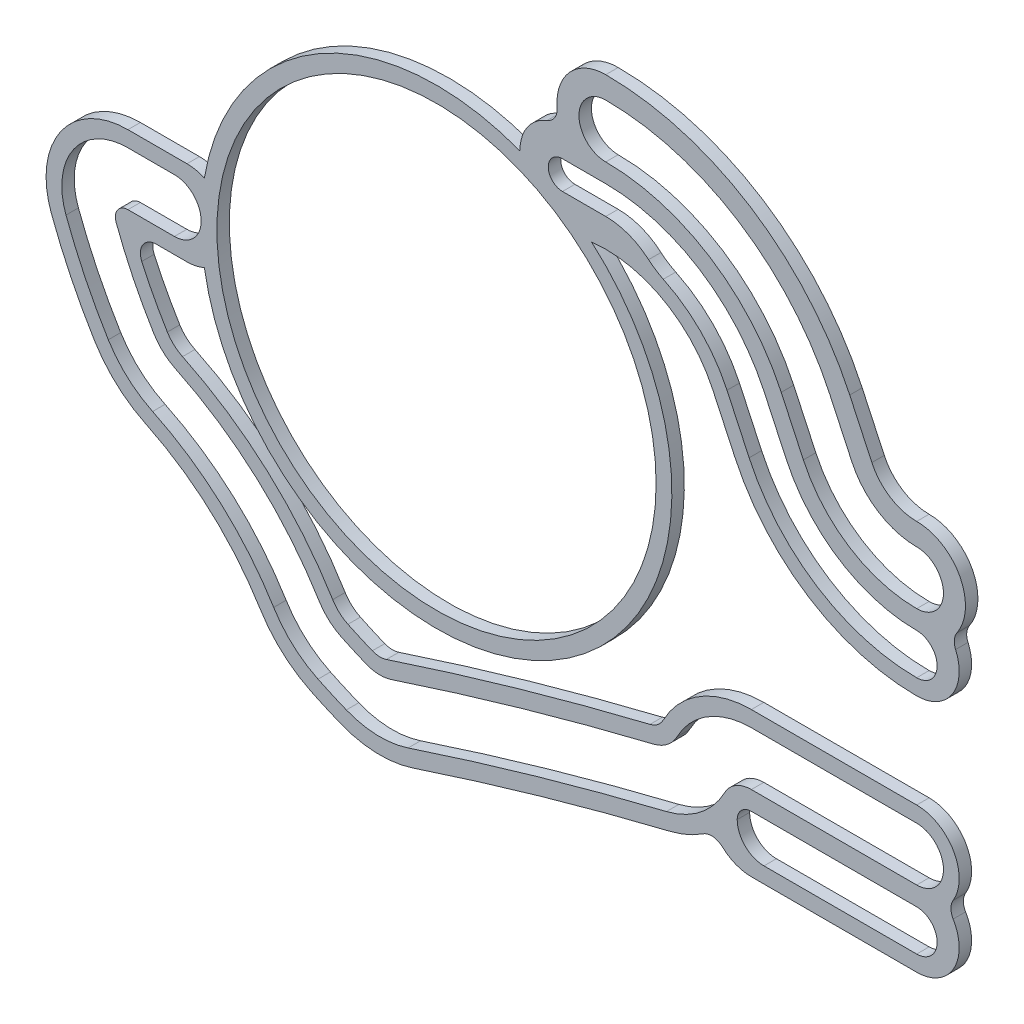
ISO-10303-21;
HEADER;
FILE_DESCRIPTION(('STEP AP214'),'2;1');
FILE_NAME('part.step','',(''),(''),'','','');
FILE_SCHEMA(('AUTOMOTIVE_DESIGN { 1 0 10303 214 1 1 1 1 }'));
ENDSEC;
DATA;
#1=APPLICATION_CONTEXT('core data for automotive mechanical design processes');
#2=APPLICATION_PROTOCOL_DEFINITION('international standard','automotive_design',2000,#1);
#3=PRODUCT_CONTEXT('',#1,'mechanical');
#4=PRODUCT('Part','Part','',(#3));
#5=PRODUCT_RELATED_PRODUCT_CATEGORY('part','',(#4));
#6=PRODUCT_DEFINITION_FORMATION('','',#4);
#7=PRODUCT_DEFINITION_CONTEXT('part definition',#1,'design');
#8=PRODUCT_DEFINITION('design','',#6,#7);
#9=PRODUCT_DEFINITION_SHAPE('','',#8);
#10=(LENGTH_UNIT() NAMED_UNIT(*) SI_UNIT(.MILLI.,.METRE.));
#11=(NAMED_UNIT(*) PLANE_ANGLE_UNIT() SI_UNIT($,.RADIAN.));
#12=(NAMED_UNIT(*) SI_UNIT($,.STERADIAN.) SOLID_ANGLE_UNIT());
#13=UNCERTAINTY_MEASURE_WITH_UNIT(LENGTH_MEASURE(1.E-05),#10,'distance_accuracy_value','');
#14=(GEOMETRIC_REPRESENTATION_CONTEXT(3) GLOBAL_UNCERTAINTY_ASSIGNED_CONTEXT((#13)) GLOBAL_UNIT_ASSIGNED_CONTEXT((#10,
#11,#12)) REPRESENTATION_CONTEXT('',''));
#15=CARTESIAN_POINT('',(0.,0.,0.));
#16=DIRECTION('',(0.,0.,1.));
#17=DIRECTION('',(1.,0.,0.));
#18=AXIS2_PLACEMENT_3D('',#15,#16,#17);
#19=CARTESIAN_POINT('',(42.9785311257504,-94.1078025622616,-1.79));
#20=DIRECTION('',(0.,0.,-1.));
#21=DIRECTION('',(-1.,0.,0.));
#22=AXIS2_PLACEMENT_3D('',#19,#20,#21);
#23=PLANE('',#22);
#24=DIRECTION('',(-1.,0.,0.));
#25=VECTOR('',#24,1.);
#26=CARTESIAN_POINT('',(8.84999999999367,-77.2000000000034,-1.79));
#27=LINE('',#26,#25);
#28=CARTESIAN_POINT('',(8.84999999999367,-77.2000000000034,-1.79));
#29=VERTEX_POINT('',#28);
#30=CARTESIAN_POINT('',(5.89999999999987,-77.2000000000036,-1.79));
#31=VERTEX_POINT('',#30);
#32=EDGE_CURVE('E701',#29,#31,#27,.T.);
#33=ORIENTED_EDGE('',*,*,#32,.F.);
#34=CARTESIAN_POINT('',(8.84999999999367,-75.5000000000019,-1.79));
#35=DIRECTION('',(0.,0.,-1.));
#36=DIRECTION('',(-1.,0.,0.));
#37=AXIS2_PLACEMENT_3D('',#34,#35,#36);
#38=CIRCLE('',#37,1.70000000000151);
#39=CARTESIAN_POINT('',(8.84999999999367,-73.8000000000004,-1.79));
#40=VERTEX_POINT('',#39);
#41=EDGE_CURVE('E699',#40,#29,#38,.T.);
#42=ORIENTED_EDGE('',*,*,#41,.F.);
#43=DIRECTION('',(1.,7.29171901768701E-13,0.));
#44=VECTOR('',#43,1.);
#45=CARTESIAN_POINT('',(5.90000000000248,-73.8000000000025,-1.79));
#46=LINE('',#45,#44);
#47=CARTESIAN_POINT('',(5.90000000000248,-73.8000000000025,-1.79));
#48=VERTEX_POINT('',#47);
#49=EDGE_CURVE('E751',#48,#40,#46,.T.);
#50=ORIENTED_EDGE('',*,*,#49,.F.);
#51=CARTESIAN_POINT('',(5.89999999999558,-78.,-1.79));
#52=DIRECTION('',(0.,0.,-1.));
#53=DIRECTION('',(-1.,0.,0.));
#54=AXIS2_PLACEMENT_3D('',#51,#52,#53);
#55=CIRCLE('',#54,4.19999999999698);
#56=CARTESIAN_POINT('',(1.96417296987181,-79.4660373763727,-1.79));
#57=VERTEX_POINT('',#56);
#58=EDGE_CURVE('E748',#57,#48,#55,.T.);
#59=ORIENTED_EDGE('',*,*,#58,.F.);
#60=CARTESIAN_POINT('',(31.670296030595,-68.4009457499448,-1.79));
#61=DIRECTION('',(0.,0.,-1.));
#62=DIRECTION('',(-1.,0.,0.));
#63=AXIS2_PLACEMENT_3D('',#60,#61,#62);
#64=CIRCLE('',#63,31.7000000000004);
#65=CARTESIAN_POINT('',(4.65227205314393,-84.9815482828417,-1.79));
#66=VERTEX_POINT('',#65);
#67=EDGE_CURVE('E746',#66,#57,#64,.T.);
#68=ORIENTED_EDGE('',*,*,#67,.F.);
#69=CARTESIAN_POINT('',(10.3627061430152,-81.4771307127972,-1.79));
#70=DIRECTION('',(0.,0.,-1.));
#71=DIRECTION('',(-1.,0.,0.));
#72=AXIS2_PLACEMENT_3D('',#69,#70,#71);
#73=CIRCLE('',#72,6.69999999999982);
#74=CARTESIAN_POINT('',(7.46778461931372,-87.5194340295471,-1.79));
#75=VERTEX_POINT('',#74);
#76=EDGE_CURVE('E744',#75,#66,#73,.T.);
#77=ORIENTED_EDGE('',*,*,#76,.F.);
#78=CARTESIAN_POINT('',(-0.439239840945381,-104.023038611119,-1.79));
#79=DIRECTION('',(0.,0.,1.));
#80=DIRECTION('',(-1.,0.,0.));
#81=AXIS2_PLACEMENT_3D('',#78,#79,#80);
#82=CIRCLE('',#81,18.3000000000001);
#83=CARTESIAN_POINT('',(15.1579159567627,-94.4512712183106,-1.79));
#84=VERTEX_POINT('',#83);
#85=EDGE_CURVE('E742',#84,#75,#82,.T.);
#86=ORIENTED_EDGE('',*,*,#85,.F.);
#87=CARTESIAN_POINT('',(20.8683500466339,-90.9468536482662,-1.79));
#88=DIRECTION('',(0.,0.,-1.));
#89=DIRECTION('',(-1.,0.,0.));
#90=AXIS2_PLACEMENT_3D('',#87,#88,#89);
#91=CIRCLE('',#90,6.69999999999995);
#92=CARTESIAN_POINT('',(17.9734285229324,-96.9891569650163,-1.79));
#93=VERTEX_POINT('',#92);
#94=EDGE_CURVE('E740',#93,#84,#91,.T.);
#95=ORIENTED_EDGE('',*,*,#94,.F.);
#96=CARTESIAN_POINT('',(31.670296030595,-68.4009457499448,-1.79));
#97=DIRECTION('',(0.,0.,-1.));
#98=DIRECTION('',(-1.,0.,0.));
#99=AXIS2_PLACEMENT_3D('',#96,#97,#98);
#100=CIRCLE('',#99,31.7000000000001);
#101=CARTESIAN_POINT('',(19.7719789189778,-97.7832542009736,-1.79));
#102=VERTEX_POINT('',#101);
#103=EDGE_CURVE('E738',#102,#93,#100,.T.);
#104=ORIENTED_EDGE('',*,*,#103,.F.);
#105=CARTESIAN_POINT('',(21.911423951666,-92.5,-1.79));
#106=DIRECTION('',(0.,0.,-1.));
#107=DIRECTION('',(-1.,0.,0.));
#108=AXIS2_PLACEMENT_3D('',#105,#106,#107);
#109=CIRCLE('',#108,5.69999999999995);
#110=CARTESIAN_POINT('',(23.6978293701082,-97.9128325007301,-1.79));
#111=VERTEX_POINT('',#110);
#112=EDGE_CURVE('E736',#111,#102,#109,.T.);
#113=ORIENTED_EDGE('',*,*,#112,.F.);
#114=CARTESIAN_POINT('',(91.3945993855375,-303.034958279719,-1.79));
#115=DIRECTION('',(0.,0.,1.));
#116=DIRECTION('',(-1.,0.,0.));
#117=AXIS2_PLACEMENT_3D('',#114,#115,#116);
#118=CIRCLE('',#117,216.004488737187);
#119=CARTESIAN_POINT('',(40.1065503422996,-93.20770747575,-1.79));
#120=VERTEX_POINT('',#119);
#121=EDGE_CURVE('E734',#120,#111,#118,.T.);
#122=ORIENTED_EDGE('',*,*,#121,.F.);
#123=CARTESIAN_POINT('',(38.753143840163,-87.6707145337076,-1.79));
#124=DIRECTION('',(0.,0.,-1.));
#125=DIRECTION('',(-1.,0.,0.));
#126=AXIS2_PLACEMENT_3D('',#123,#124,#125);
#127=CIRCLE('',#126,5.70000000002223);
#128=CARTESIAN_POINT('',(43.7956890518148,-90.3282957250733,-1.79));
#129=VERTEX_POINT('',#128);
#130=EDGE_CURVE('E732',#129,#120,#127,.T.);
#131=ORIENTED_EDGE('',*,*,#130,.F.);
#132=CARTESIAN_POINT('',(45.4999999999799,-91.2265216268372,-1.79));
#133=DIRECTION('',(0.,0.,1.));
#134=DIRECTION('',(-1.,0.,0.));
#135=AXIS2_PLACEMENT_3D('',#132,#133,#134);
#136=CIRCLE('',#135,1.92652162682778);
#137=CARTESIAN_POINT('',(45.4999999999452,-89.3000000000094,-1.79));
#138=VERTEX_POINT('',#137);
#139=EDGE_CURVE('E730',#138,#129,#136,.T.);
#140=ORIENTED_EDGE('',*,*,#139,.F.);
#141=DIRECTION('',(-1.,0.,0.));
#142=VECTOR('',#141,1.);
#143=CARTESIAN_POINT('',(55.9999999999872,-89.3000000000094,-1.79));
#144=LINE('',#143,#142);
#145=CARTESIAN_POINT('',(55.9999999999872,-89.3000000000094,-1.79));
#146=VERTEX_POINT('',#145);
#147=EDGE_CURVE('E728',#146,#138,#144,.T.);
#148=ORIENTED_EDGE('',*,*,#147,.F.);
#149=CARTESIAN_POINT('',(55.99999999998,-87.6000000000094,-1.79));
#150=DIRECTION('',(0.,0.,-1.));
#151=DIRECTION('',(-1.,0.,0.));
#152=AXIS2_PLACEMENT_3D('',#149,#150,#151);
#153=CIRCLE('',#152,1.70000000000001);
#154=CARTESIAN_POINT('',(55.9999999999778,-85.9000000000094,-1.79));
#155=VERTEX_POINT('',#154);
#156=EDGE_CURVE('E726',#155,#146,#153,.T.);
#157=ORIENTED_EDGE('',*,*,#156,.F.);
#158=DIRECTION('',(1.,0.,0.));
#159=VECTOR('',#158,1.);
#160=CARTESIAN_POINT('',(45.4999999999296,-85.9000000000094,-1.79));
#161=LINE('',#160,#159);
#162=CARTESIAN_POINT('',(45.4999999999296,-85.9000000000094,-1.79));
#163=VERTEX_POINT('',#162);
#164=EDGE_CURVE('E724',#163,#155,#161,.T.);
#165=ORIENTED_EDGE('',*,*,#164,.F.);
#166=CARTESIAN_POINT('',(45.4999999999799,-91.2265216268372,-1.79));
#167=DIRECTION('',(0.,0.,-1.));
#168=DIRECTION('',(-1.,0.,0.));
#169=AXIS2_PLACEMENT_3D('',#166,#167,#168);
#170=CIRCLE('',#169,5.32652162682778);
#171=CARTESIAN_POINT('',(40.7878550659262,-88.7430718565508,-1.79));
#172=VERTEX_POINT('',#171);
#173=EDGE_CURVE('E722',#172,#163,#170,.T.);
#174=ORIENTED_EDGE('',*,*,#173,.F.);
#175=CARTESIAN_POINT('',(38.753143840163,-87.6707145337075,-1.79));
#176=DIRECTION('',(0.,0.,1.));
#177=DIRECTION('',(-1.,0.,0.));
#178=AXIS2_PLACEMENT_3D('',#175,#176,#177);
#179=CIRCLE('',#178,2.30000000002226);
#180=CARTESIAN_POINT('',(39.2992552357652,-89.9049397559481,-1.79));
#181=VERTEX_POINT('',#180);
#182=EDGE_CURVE('E720',#181,#172,#179,.T.);
#183=ORIENTED_EDGE('',*,*,#182,.F.);
#184=CARTESIAN_POINT('',(91.3945993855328,-303.034958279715,-1.79));
#185=DIRECTION('',(0.,0.,-1.));
#186=DIRECTION('',(-1.,0.,0.));
#187=AXIS2_PLACEMENT_3D('',#184,#185,#186);
#188=CIRCLE('',#187,219.404488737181);
#189=CARTESIAN_POINT('',(22.6322542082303,-94.6841253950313,-1.79));
#190=VERTEX_POINT('',#189);
#191=EDGE_CURVE('E718',#190,#181,#188,.T.);
#192=ORIENTED_EDGE('',*,*,#191,.F.);
#193=CARTESIAN_POINT('',(21.911423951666,-92.5,-1.79));
#194=DIRECTION('',(0.,0.,1.));
#195=DIRECTION('',(-1.,0.,0.));
#196=AXIS2_PLACEMENT_3D('',#193,#194,#195);
#197=CIRCLE('',#196,2.29999999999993);
#198=CARTESIAN_POINT('',(21.0481391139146,-94.6318394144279,-1.79));
#199=VERTEX_POINT('',#198);
#200=EDGE_CURVE('E716',#199,#190,#197,.T.);
#201=ORIENTED_EDGE('',*,*,#200,.F.);
#202=CARTESIAN_POINT('',(31.670296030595,-68.4009457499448,-1.79));
#203=DIRECTION('',(0.,0.,1.));
#204=DIRECTION('',(-1.,0.,0.));
#205=AXIS2_PLACEMENT_3D('',#202,#203,#204);
#206=CIRCLE('',#205,28.3000000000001);
#207=CARTESIAN_POINT('',(19.4424931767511,-93.9229134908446,-1.79));
#208=VERTEX_POINT('',#207);
#209=EDGE_CURVE('E714',#208,#199,#206,.T.);
#210=ORIENTED_EDGE('',*,*,#209,.F.);
#211=CARTESIAN_POINT('',(20.8683500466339,-90.9468536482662,-1.79));
#212=DIRECTION('',(0.,0.,1.));
#213=DIRECTION('',(-1.,0.,0.));
#214=AXIS2_PLACEMENT_3D('',#211,#212,#213);
#215=CIRCLE('',#214,3.29999999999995);
#216=CARTESIAN_POINT('',(18.0557481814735,-92.6729100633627,-1.79));
#217=VERTEX_POINT('',#216);
#218=EDGE_CURVE('E712',#217,#208,#215,.T.);
#219=ORIENTED_EDGE('',*,*,#218,.F.);
#220=CARTESIAN_POINT('',(-0.439239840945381,-104.023038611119,-1.79));
#221=DIRECTION('',(0.,0.,-1.));
#222=DIRECTION('',(-1.,0.,0.));
#223=AXIS2_PLACEMENT_3D('',#220,#221,#222);
#224=CIRCLE('',#223,21.7000000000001);
#225=CARTESIAN_POINT('',(8.93684927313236,-84.4531905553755,-1.79));
#226=VERTEX_POINT('',#225);
#227=EDGE_CURVE('E710',#226,#217,#224,.T.);
#228=ORIENTED_EDGE('',*,*,#227,.F.);
#229=CARTESIAN_POINT('',(10.3627061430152,-81.4771307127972,-1.79));
#230=DIRECTION('',(0.,0.,1.));
#231=DIRECTION('',(-1.,0.,0.));
#232=AXIS2_PLACEMENT_3D('',#229,#230,#231);
#233=CIRCLE('',#232,3.29999999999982);
#234=CARTESIAN_POINT('',(7.55010427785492,-83.2031871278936,-1.79));
#235=VERTEX_POINT('',#234);
#236=EDGE_CURVE('E708',#235,#226,#233,.T.);
#237=ORIENTED_EDGE('',*,*,#236,.F.);
#238=CARTESIAN_POINT('',(31.670296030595,-68.4009457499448,-1.79));
#239=DIRECTION('',(0.,0.,1.));
#240=DIRECTION('',(-1.,0.,0.));
#241=AXIS2_PLACEMENT_3D('',#238,#239,#240);
#242=CIRCLE('',#241,28.3000000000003);
#243=CARTESIAN_POINT('',(5.15031866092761,-78.2792452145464,-1.79));
#244=VERTEX_POINT('',#243);
#245=EDGE_CURVE('E706',#244,#235,#242,.T.);
#246=ORIENTED_EDGE('',*,*,#245,.F.);
#247=CARTESIAN_POINT('',(5.89999999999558,-78.,-1.79));
#248=DIRECTION('',(0.,0.,1.));
#249=DIRECTION('',(-1.,0.,0.));
#250=AXIS2_PLACEMENT_3D('',#247,#248,#249);
#251=CIRCLE('',#250,0.799999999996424);
#252=EDGE_CURVE('E704',#31,#244,#251,.T.);
#253=ORIENTED_EDGE('',*,*,#252,.F.);
#254=EDGE_LOOP('',(#33,#42,#50,#59,#68,#77,#86,#95,#104,#113,#122,#131,#140,#148,#157,#165,#174,
#183,#192,#201,#210,#219,#228,#237,#246,#253));
#255=FACE_BOUND('',#254,.T.);
#256=DIRECTION('',(-1.,0.,0.));
#257=VECTOR('',#256,1.);
#258=CARTESIAN_POINT('',(56.,-93.1,-1.79));
#259=LINE('',#258,#257);
#260=CARTESIAN_POINT('',(56.,-93.1,-1.79));
#261=VERTEX_POINT('',#260);
#262=CARTESIAN_POINT('',(46.3000000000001,-93.1,-1.79));
#263=VERTEX_POINT('',#262);
#264=EDGE_CURVE('E886',#261,#263,#259,.T.);
#265=ORIENTED_EDGE('',*,*,#264,.F.);
#266=CARTESIAN_POINT('',(56.,-91.8,-1.79));
#267=DIRECTION('',(0.,0.,-1.));
#268=DIRECTION('',(-1.,0.,0.));
#269=AXIS2_PLACEMENT_3D('',#266,#267,#268);
#270=CIRCLE('',#269,1.3);
#271=CARTESIAN_POINT('',(56.,-90.5,-1.79));
#272=VERTEX_POINT('',#271);
#273=EDGE_CURVE('E884',#272,#261,#270,.T.);
#274=ORIENTED_EDGE('',*,*,#273,.F.);
#275=DIRECTION('',(1.,0.,0.));
#276=VECTOR('',#275,1.);
#277=CARTESIAN_POINT('',(56.,-90.5,-1.79));
#278=LINE('',#277,#276);
#279=CARTESIAN_POINT('',(45.4999999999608,-90.5,-1.79));
#280=VERTEX_POINT('',#279);
#281=EDGE_CURVE('E894',#280,#272,#278,.T.);
#282=ORIENTED_EDGE('',*,*,#281,.F.);
#283=CARTESIAN_POINT('',(45.5,-91.4,-1.79));
#284=DIRECTION('',(0.,0.,-1.));
#285=DIRECTION('',(-1.,0.,0.));
#286=AXIS2_PLACEMENT_3D('',#283,#284,#285);
#287=CIRCLE('',#286,0.899999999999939);
#288=CARTESIAN_POINT('',(44.6000000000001,-91.4,-1.79));
#289=VERTEX_POINT('',#288);
#290=EDGE_CURVE('E891',#289,#280,#287,.T.);
#291=ORIENTED_EDGE('',*,*,#290,.F.);
#292=CARTESIAN_POINT('',(46.3000000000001,-91.4,-1.79));
#293=DIRECTION('',(0.,0.,-1.));
#294=DIRECTION('',(1.,0.,0.));
#295=AXIS2_PLACEMENT_3D('',#292,#293,#294);
#296=CIRCLE('',#295,1.69999999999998);
#297=EDGE_CURVE('E889',#263,#289,#296,.T.);
#298=ORIENTED_EDGE('',*,*,#297,.F.);
#299=EDGE_LOOP('',(#265,#274,#282,#291,#298));
#300=FACE_BOUND('',#299,.T.);
#301=CARTESIAN_POINT('',(56.00000000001,-76.6000000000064,-1.79));
#302=DIRECTION('',(0.,0.,-1.));
#303=DIRECTION('',(-1.,0.,0.));
#304=AXIS2_PLACEMENT_3D('',#301,#302,#303);
#305=CIRCLE('',#304,1.3);
#306=CARTESIAN_POINT('',(56.00000000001,-75.3000000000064,-1.79));
#307=VERTEX_POINT('',#306);
#308=CARTESIAN_POINT('',(56.00000000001,-77.9000000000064,-1.79));
#309=VERTEX_POINT('',#308);
#310=EDGE_CURVE('E924',#307,#309,#305,.T.);
#311=ORIENTED_EDGE('',*,*,#310,.F.);
#312=CARTESIAN_POINT('',(56.00000000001,-66.1584690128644,-1.79));
#313=DIRECTION('',(0.,0.,1.));
#314=DIRECTION('',(-1.,0.,0.));
#315=AXIS2_PLACEMENT_3D('',#312,#313,#314);
#316=CIRCLE('',#315,9.141530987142);
#317=CARTESIAN_POINT('',(47.7149592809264,-70.0218469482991,-1.79));
#318=VERTEX_POINT('',#317);
#319=EDGE_CURVE('E922',#318,#307,#316,.T.);
#320=ORIENTED_EDGE('',*,*,#319,.F.);
#321=DIRECTION('',(0.422618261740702,-0.906307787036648,0.));
#322=VECTOR('',#321,1.);
#323=CARTESIAN_POINT('',(47.7149592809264,-70.0218469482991,-1.79));
#324=LINE('',#323,#322);
#325=CARTESIAN_POINT('',(46.3100164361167,-67.0089372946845,-1.79));
#326=VERTEX_POINT('',#325);
#327=EDGE_CURVE('E946',#326,#318,#324,.T.);
#328=ORIENTED_EDGE('',*,*,#327,.F.);
#329=CARTESIAN_POINT('',(36.25,-71.700000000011,-1.79));
#330=DIRECTION('',(0.,0.,-1.));
#331=DIRECTION('',(-1.,0.,0.));
#332=AXIS2_PLACEMENT_3D('',#329,#330,#331);
#333=CIRCLE('',#332,11.100000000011);
#334=CARTESIAN_POINT('',(36.25,-60.6,-1.79));
#335=VERTEX_POINT('',#334);
#336=EDGE_CURVE('E943',#335,#326,#333,.T.);
#337=ORIENTED_EDGE('',*,*,#336,.F.);
#338=DIRECTION('',(1.,0.,0.));
#339=VECTOR('',#338,1.);
#340=CARTESIAN_POINT('',(36.25,-60.6,-1.79));
#341=LINE('',#340,#339);
#342=CARTESIAN_POINT('',(33.4999999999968,-60.6,-1.79));
#343=VERTEX_POINT('',#342);
#344=EDGE_CURVE('E941',#343,#335,#341,.T.);
#345=ORIENTED_EDGE('',*,*,#344,.F.);
#346=CARTESIAN_POINT('',(33.5,-61.5,-1.79));
#347=DIRECTION('',(0.,0.,-1.));
#348=DIRECTION('',(-1.,0.,0.));
#349=AXIS2_PLACEMENT_3D('',#346,#347,#348);
#350=CIRCLE('',#349,0.899999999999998);
#351=CARTESIAN_POINT('',(33.5,-62.4,-1.79));
#352=VERTEX_POINT('',#351);
#353=EDGE_CURVE('E939',#352,#343,#350,.T.);
#354=ORIENTED_EDGE('',*,*,#353,.F.);
#355=DIRECTION('',(-1.,0.,0.));
#356=VECTOR('',#355,1.);
#357=CARTESIAN_POINT('',(33.5,-62.4,-1.79));
#358=LINE('',#357,#356);
#359=CARTESIAN_POINT('',(36.2500000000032,-62.4,-1.79));
#360=VERTEX_POINT('',#359);
#361=EDGE_CURVE('E937',#360,#352,#358,.T.);
#362=ORIENTED_EDGE('',*,*,#361,.F.);
#363=CARTESIAN_POINT('',(36.2500000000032,-66.5540019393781,-1.79));
#364=DIRECTION('',(0.,0.,1.));
#365=DIRECTION('',(-1.,0.,0.));
#366=AXIS2_PLACEMENT_3D('',#363,#364,#365);
#367=CIRCLE('',#366,4.15400193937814);
#368=CARTESIAN_POINT('',(38.9703790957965,-63.4146915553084,-1.79));
#369=VERTEX_POINT('',#368);
#370=EDGE_CURVE('E935',#369,#360,#367,.T.);
#371=ORIENTED_EDGE('',*,*,#370,.F.);
#372=CARTESIAN_POINT('',(41.6907581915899,-60.2753811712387,-1.79));
#373=DIRECTION('',(0.,0.,-1.));
#374=DIRECTION('',(1.,0.,0.));
#375=AXIS2_PLACEMENT_3D('',#372,#373,#374);
#376=CIRCLE('',#375,4.15400193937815);
#377=CARTESIAN_POINT('',(39.9046892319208,-64.0258064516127,-1.79));
#378=VERTEX_POINT('',#377);
#379=EDGE_CURVE('E933',#378,#369,#376,.T.);
#380=ORIENTED_EDGE('',*,*,#379,.F.);
#381=CARTESIAN_POINT('',(36.25,-71.700000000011,-1.79));
#382=DIRECTION('',(0.,0.,1.));
#383=DIRECTION('',(-1.,0.,0.));
#384=AXIS2_PLACEMENT_3D('',#381,#382,#383);
#385=CIRCLE('',#384,8.50000000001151);
#386=CARTESIAN_POINT('',(43.9536161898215,-68.1077447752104,-1.79));
#387=VERTEX_POINT('',#386);
#388=EDGE_CURVE('E931',#387,#378,#385,.T.);
#389=ORIENTED_EDGE('',*,*,#388,.F.);
#390=DIRECTION('',(-0.422618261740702,0.906307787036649,0.));
#391=VECTOR('',#390,1.);
#392=CARTESIAN_POINT('',(45.3585590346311,-71.1206544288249,-1.79));
#393=LINE('',#392,#391);
#394=CARTESIAN_POINT('',(45.3585590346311,-71.1206544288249,-1.79));
#395=VERTEX_POINT('',#394);
#396=EDGE_CURVE('E929',#395,#387,#393,.T.);
#397=ORIENTED_EDGE('',*,*,#396,.F.);
#398=CARTESIAN_POINT('',(56.00000000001,-66.1584690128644,-1.79));
#399=DIRECTION('',(0.,0.,-1.));
#400=DIRECTION('',(-1.,0.,0.));
#401=AXIS2_PLACEMENT_3D('',#398,#399,#400);
#402=CIRCLE('',#401,11.741530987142);
#403=EDGE_CURVE('E927',#309,#395,#402,.T.);
#404=ORIENTED_EDGE('',*,*,#403,.F.);
#405=EDGE_LOOP('',(#311,#320,#328,#337,#345,#354,#362,#371,#380,#389,#397,#404));
#406=FACE_BOUND('',#405,.T.);
#407=CARTESIAN_POINT('',(42.9785311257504,-94.1078025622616,-1.79));
#408=DIRECTION('',(0.,0.,1.));
#409=DIRECTION('',(-1.,0.,0.));
#410=AXIS2_PLACEMENT_3D('',#407,#408,#409);
#411=CIRCLE('',#410,1.00000000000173);
#412=CARTESIAN_POINT('',(43.6600091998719,-93.3759640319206,-1.79));
#413=VERTEX_POINT('',#412);
#414=CARTESIAN_POINT('',(42.4297795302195,-93.2718171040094,-1.79));
#415=VERTEX_POINT('',#414);
#416=EDGE_CURVE('E1009',#413,#415,#411,.T.);
#417=ORIENTED_EDGE('',*,*,#416,.T.);
#418=CARTESIAN_POINT('',(38.7531438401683,-87.6707145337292,-1.79));
#419=DIRECTION('',(0.,0.,-1.));
#420=DIRECTION('',(-1.,0.,0.));
#421=AXIS2_PLACEMENT_3D('',#418,#419,#420);
#422=CIRCLE('',#421,6.70000000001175);
#423=CARTESIAN_POINT('',(40.3439900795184,-94.1791097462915,-1.79));
#424=VERTEX_POINT('',#423);
#425=EDGE_CURVE('E1012',#415,#424,#422,.T.);
#426=ORIENTED_EDGE('',*,*,#425,.T.);
#427=CARTESIAN_POINT('',(91.3945993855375,-303.034958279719,-1.79));
#428=DIRECTION('',(0.,0.,1.));
#429=DIRECTION('',(-1.,0.,0.));
#430=AXIS2_PLACEMENT_3D('',#427,#428,#429);
#431=CIRCLE('',#430,215.004488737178);
#432=CARTESIAN_POINT('',(24.0112338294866,-98.8624522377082,-1.79));
#433=VERTEX_POINT('',#432);
#434=EDGE_CURVE('E1015',#424,#433,#431,.T.);
#435=ORIENTED_EDGE('',*,*,#434,.T.);
#436=CARTESIAN_POINT('',(21.911423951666,-92.5,-1.79));
#437=DIRECTION('',(0.,0.,-1.));
#438=DIRECTION('',(-1.,0.,0.));
#439=AXIS2_PLACEMENT_3D('',#436,#437,#438);
#440=CIRCLE('',#439,6.70000000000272);
#441=CARTESIAN_POINT('',(19.3966376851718,-98.7101409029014,-1.79));
#442=VERTEX_POINT('',#441);
#443=EDGE_CURVE('E1017',#433,#442,#440,.T.);
#444=ORIENTED_EDGE('',*,*,#443,.T.);
#445=CARTESIAN_POINT('',(31.670296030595,-68.4009457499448,-1.79));
#446=DIRECTION('',(0.,0.,-1.));
#447=DIRECTION('',(-1.,0.,0.));
#448=AXIS2_PLACEMENT_3D('',#445,#446,#447);
#449=CIRCLE('',#448,32.7000000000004);
#450=CARTESIAN_POINT('',(17.5413506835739,-97.8909932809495,-1.79));
#451=VERTEX_POINT('',#450);
#452=EDGE_CURVE('E1019',#442,#451,#449,.T.);
#453=ORIENTED_EDGE('',*,*,#452,.T.);
#454=CARTESIAN_POINT('',(20.8683500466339,-90.9468536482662,-1.79));
#455=DIRECTION('',(0.,0.,-1.));
#456=DIRECTION('',(-1.,0.,0.));
#457=AXIS2_PLACEMENT_3D('',#454,#455,#456);
#458=CIRCLE('',#457,7.69999999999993);
#459=CARTESIAN_POINT('',(14.3056123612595,-94.9743186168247,-1.79));
#460=VERTEX_POINT('',#459);
#461=EDGE_CURVE('E1021',#451,#460,#458,.T.);
#462=ORIENTED_EDGE('',*,*,#461,.T.);
#463=CARTESIAN_POINT('',(-0.439239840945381,-104.023038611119,-1.79));
#464=DIRECTION('',(0.,0.,1.));
#465=DIRECTION('',(-1.,0.,0.));
#466=AXIS2_PLACEMENT_3D('',#463,#464,#465);
#467=CIRCLE('',#466,17.3000000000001);
#468=CARTESIAN_POINT('',(7.03570677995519,-88.42127034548,-1.79));
#469=VERTEX_POINT('',#468);
#470=EDGE_CURVE('E1023',#460,#469,#467,.T.);
#471=ORIENTED_EDGE('',*,*,#470,.T.);
#472=CARTESIAN_POINT('',(10.3627061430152,-81.4771307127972,-1.79));
#473=DIRECTION('',(0.,0.,-1.));
#474=DIRECTION('',(-1.,0.,0.));
#475=AXIS2_PLACEMENT_3D('',#472,#473,#474);
#476=CIRCLE('',#475,7.69999999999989);
#477=CARTESIAN_POINT('',(3.79996845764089,-85.5045956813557,-1.79));
#478=VERTEX_POINT('',#477);
#479=EDGE_CURVE('E1025',#469,#478,#476,.T.);
#480=ORIENTED_EDGE('',*,*,#479,.T.);
#481=CARTESIAN_POINT('',(31.670296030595,-68.4009457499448,-1.79));
#482=DIRECTION('',(0.,0.,-1.));
#483=DIRECTION('',(-1.,0.,0.));
#484=AXIS2_PLACEMENT_3D('',#481,#482,#483);
#485=CIRCLE('',#484,32.7000000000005);
#486=CARTESIAN_POINT('',(1.02707129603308,-79.8150938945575,-1.79));
#487=VERTEX_POINT('',#486);
#488=EDGE_CURVE('E1027',#478,#487,#485,.T.);
#489=ORIENTED_EDGE('',*,*,#488,.T.);
#490=CARTESIAN_POINT('',(5.89999999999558,-78.,-1.79));
#491=DIRECTION('',(0.,0.,-1.));
#492=DIRECTION('',(-1.,0.,0.));
#493=AXIS2_PLACEMENT_3D('',#490,#491,#492);
#494=CIRCLE('',#493,5.19999999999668);
#495=CARTESIAN_POINT('',(5.89999999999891,-72.8000000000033,-1.79));
#496=VERTEX_POINT('',#495);
#497=EDGE_CURVE('E1029',#487,#496,#494,.T.);
#498=ORIENTED_EDGE('',*,*,#497,.T.);
#499=DIRECTION('',(1.,7.36447939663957E-13,0.));
#500=VECTOR('',#499,1.);
#501=CARTESIAN_POINT('',(5.89999999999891,-72.8000000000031,-1.79));
#502=LINE('',#501,#500);
#503=CARTESIAN_POINT('',(9.6500000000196,-72.8000000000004,-1.79));
#504=VERTEX_POINT('',#503);
#505=EDGE_CURVE('E1031',#496,#504,#502,.T.);
#506=ORIENTED_EDGE('',*,*,#505,.T.);
#507=CARTESIAN_POINT('',(9.64999999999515,-75.5000000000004,-1.79));
#508=DIRECTION('',(0.,0.,-1.));
#509=DIRECTION('',(-1.,0.,0.));
#510=AXIS2_PLACEMENT_3D('',#507,#508,#509);
#511=CIRCLE('',#510,2.69999999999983);
#512=CARTESIAN_POINT('',(10.7544164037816,-73.0362093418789,-1.79));
#513=VERTEX_POINT('',#512);
#514=EDGE_CURVE('E1033',#504,#513,#511,.T.);
#515=ORIENTED_EDGE('',*,*,#514,.T.);
#516=CARTESIAN_POINT('',(25.4999999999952,-75.5,-1.79));
#517=DIRECTION('',(0.,0.,-1.));
#518=DIRECTION('',(-1.,0.,0.));
#519=AXIS2_PLACEMENT_3D('',#516,#517,#518);
#520=CIRCLE('',#519,14.9499999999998);
#521=CARTESIAN_POINT('',(30.8000818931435,-61.5210289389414,-1.79));
#522=VERTEX_POINT('',#521);
#523=EDGE_CURVE('E1035',#513,#522,#520,.T.);
#524=ORIENTED_EDGE('',*,*,#523,.T.);
#525=CARTESIAN_POINT('',(33.5,-61.5,-1.79));
#526=DIRECTION('',(0.,0.,-1.));
#527=DIRECTION('',(-1.,0.,0.));
#528=AXIS2_PLACEMENT_3D('',#525,#526,#527);
#529=CIRCLE('',#528,2.70000000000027);
#530=CARTESIAN_POINT('',(32.5257408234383,-58.9819016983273,-1.79));
#531=VERTEX_POINT('',#530);
#532=EDGE_CURVE('E1037',#522,#531,#529,.T.);
#533=ORIENTED_EDGE('',*,*,#532,.T.);
#534=CARTESIAN_POINT('',(32.1649040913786,-58.0492726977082,-1.79));
#535=DIRECTION('',(0.,0.,1.));
#536=DIRECTION('',(-1.,0.,0.));
#537=AXIS2_PLACEMENT_3D('',#534,#535,#536);
#538=CIRCLE('',#537,1.00000000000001);
#539=CARTESIAN_POINT('',(33.1612689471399,-57.9640842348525,-1.79));
#540=VERTEX_POINT('',#539);
#541=EDGE_CURVE('E1039',#531,#540,#538,.T.);
#542=ORIENTED_EDGE('',*,*,#541,.T.);
#543=CARTESIAN_POINT('',(36.25,-57.7,-1.79));
#544=DIRECTION('',(0.,0.,-1.));
#545=DIRECTION('',(-1.,0.,0.));
#546=AXIS2_PLACEMENT_3D('',#543,#544,#545);
#547=CIRCLE('',#546,3.1000000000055);
#548=CARTESIAN_POINT('',(36.249999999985,-54.5999999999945,-1.79));
#549=VERTEX_POINT('',#548);
#550=EDGE_CURVE('E1041',#540,#549,#547,.T.);
#551=ORIENTED_EDGE('',*,*,#550,.T.);
#552=CARTESIAN_POINT('',(36.25,-71.7,-1.79));
#553=DIRECTION('',(0.,0.,-1.));
#554=DIRECTION('',(-1.,0.,0.));
#555=AXIS2_PLACEMENT_3D('',#552,#553,#554);
#556=CIRCLE('',#555,17.100000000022);
#557=CARTESIAN_POINT('',(51.7478631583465,-64.4732277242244,-1.79));
#558=VERTEX_POINT('',#557);
#559=EDGE_CURVE('E1043',#549,#558,#556,.T.);
#560=ORIENTED_EDGE('',*,*,#559,.T.);
#561=DIRECTION('',(0.422618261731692,-0.90630778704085,0.));
#562=VECTOR('',#561,1.);
#563=CARTESIAN_POINT('',(51.7478631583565,-64.4732277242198,-1.79));
#564=LINE('',#563,#562);
#565=CARTESIAN_POINT('',(53.1528060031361,-67.4861373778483,-1.79));
#566=VERTEX_POINT('',#565);
#567=EDGE_CURVE('E1045',#558,#566,#564,.T.);
#568=ORIENTED_EDGE('',*,*,#567,.T.);
#569=CARTESIAN_POINT('',(56.,-66.158469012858,-1.79));
#570=DIRECTION('',(0.,0.,1.));
#571=DIRECTION('',(-1.,0.,0.));
#572=AXIS2_PLACEMENT_3D('',#569,#570,#571);
#573=CIRCLE('',#572,3.14153098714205);
#574=CARTESIAN_POINT('',(56.,-69.3000000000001,-1.79));
#575=VERTEX_POINT('',#574);
#576=EDGE_CURVE('E1047',#566,#575,#573,.T.);
#577=ORIENTED_EDGE('',*,*,#576,.T.);
#578=CARTESIAN_POINT('',(56.,-72.4,-1.79));
#579=DIRECTION('',(0.,0.,-1.));
#580=DIRECTION('',(-1.,0.,0.));
#581=AXIS2_PLACEMENT_3D('',#578,#579,#580);
#582=CIRCLE('',#581,3.09999999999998);
#583=CARTESIAN_POINT('',(58.5608688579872,-74.1469833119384,-1.79));
#584=VERTEX_POINT('',#583);
#585=EDGE_CURVE('E1049',#575,#584,#582,.T.);
#586=ORIENTED_EDGE('',*,*,#585,.T.);
#587=CARTESIAN_POINT('',(59.3869555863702,-74.7105263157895,-1.79));
#588=DIRECTION('',(0.,0.,1.));
#589=DIRECTION('',(-1.,0.,0.));
#590=AXIS2_PLACEMENT_3D('',#587,#588,#589);
#591=CIRCLE('',#590,0.999999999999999);
#592=CARTESIAN_POINT('',(58.4715621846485,-75.1130867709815,-1.79));
#593=VERTEX_POINT('',#592);
#594=EDGE_CURVE('E1051',#584,#593,#591,.T.);
#595=ORIENTED_EDGE('',*,*,#594,.T.);
#596=CARTESIAN_POINT('',(56.,-76.2,-1.79));
#597=DIRECTION('',(0.,0.,-1.));
#598=DIRECTION('',(-1.,0.,0.));
#599=AXIS2_PLACEMENT_3D('',#596,#597,#598);
#600=CIRCLE('',#599,2.70000000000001);
#601=CARTESIAN_POINT('',(56.,-78.9,-1.79));
#602=VERTEX_POINT('',#601);
#603=EDGE_CURVE('E1053',#593,#602,#600,.T.);
#604=ORIENTED_EDGE('',*,*,#603,.T.);
#605=CARTESIAN_POINT('',(56.,-66.158469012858,-1.79));
#606=DIRECTION('',(0.,0.,-1.));
#607=DIRECTION('',(-1.,0.,0.));
#608=AXIS2_PLACEMENT_3D('',#605,#606,#607);
#609=CIRCLE('',#608,12.741530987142);
#610=CARTESIAN_POINT('',(44.4522512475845,-71.5432726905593,-1.79));
#611=VERTEX_POINT('',#610);
#612=EDGE_CURVE('E1055',#602,#611,#609,.T.);
#613=ORIENTED_EDGE('',*,*,#612,.T.);
#614=DIRECTION('',(-0.422618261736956,0.906307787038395,0.));
#615=VECTOR('',#614,1.);
#616=CARTESIAN_POINT('',(44.4522512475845,-71.5432726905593,-1.79));
#617=LINE('',#616,#615);
#618=CARTESIAN_POINT('',(43.0473084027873,-68.5303630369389,-1.79));
#619=VERTEX_POINT('',#618);
#620=EDGE_CURVE('E1057',#611,#619,#617,.T.);
#621=ORIENTED_EDGE('',*,*,#620,.T.);
#622=CARTESIAN_POINT('',(36.25,-71.7,-1.79));
#623=DIRECTION('',(0.,0.,1.));
#624=DIRECTION('',(-1.,0.,0.));
#625=AXIS2_PLACEMENT_3D('',#622,#623,#624);
#626=CIRCLE('',#625,7.50000000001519);
#627=CARTESIAN_POINT('',(35.350530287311,-64.2541317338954,-1.79));
#628=VERTEX_POINT('',#627);
#629=EDGE_CURVE('E1059',#619,#628,#626,.T.);
#630=ORIENTED_EDGE('',*,*,#629,.T.);
#631=CARTESIAN_POINT('',(25.4999999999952,-75.5,-1.79));
#632=DIRECTION('',(0.,0.,-1.));
#633=DIRECTION('',(-1.,0.,0.));
#634=AXIS2_PLACEMENT_3D('',#631,#632,#633);
#635=CIRCLE('',#634,14.9499999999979);
#636=CARTESIAN_POINT('',(10.7544164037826,-77.9637906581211,-1.79));
#637=VERTEX_POINT('',#636);
#638=EDGE_CURVE('E1061',#628,#637,#635,.T.);
#639=ORIENTED_EDGE('',*,*,#638,.T.);
#640=CARTESIAN_POINT('',(9.64999999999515,-75.5000000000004,-1.79));
#641=DIRECTION('',(0.,0.,-1.));
#642=DIRECTION('',(-1.,0.,0.));
#643=AXIS2_PLACEMENT_3D('',#640,#641,#642);
#644=CIRCLE('',#643,2.69999999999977);
#645=CARTESIAN_POINT('',(9.65000000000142,-78.2000000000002,-1.79));
#646=VERTEX_POINT('',#645);
#647=EDGE_CURVE('E1063',#637,#646,#644,.T.);
#648=ORIENTED_EDGE('',*,*,#647,.T.);
#649=DIRECTION('',(-1.,-6.79613939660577E-13,0.));
#650=VECTOR('',#649,1.);
#651=CARTESIAN_POINT('',(9.65000000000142,-78.2000000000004,-1.79));
#652=LINE('',#651,#650);
#653=CARTESIAN_POINT('',(7.68966994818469,-78.2000000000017,-1.79));
#654=VERTEX_POINT('',#653);
#655=EDGE_CURVE('E1065',#646,#654,#652,.T.);
#656=ORIENTED_EDGE('',*,*,#655,.T.);
#657=CARTESIAN_POINT('',(7.68966994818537,-79.2000000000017,-1.79));
#658=DIRECTION('',(0.,0.,1.));
#659=DIRECTION('',(-1.,0.,0.));
#660=AXIS2_PLACEMENT_3D('',#657,#658,#659);
#661=CIRCLE('',#660,1.);
#662=CARTESIAN_POINT('',(6.77785907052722,-79.6106104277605,-1.79));
#663=VERTEX_POINT('',#662);
#664=EDGE_CURVE('E1067',#654,#663,#661,.T.);
#665=ORIENTED_EDGE('',*,*,#664,.T.);
#666=CARTESIAN_POINT('',(31.670296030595,-68.4009457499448,-1.79));
#667=DIRECTION('',(0.,0.,1.));
#668=DIRECTION('',(-1.,0.,0.));
#669=AXIS2_PLACEMENT_3D('',#666,#667,#668);
#670=CIRCLE('',#669,27.3000000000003);
#671=CARTESIAN_POINT('',(8.402407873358,-82.6801397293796,-1.79));
#672=VERTEX_POINT('',#671);
#673=EDGE_CURVE('E1069',#663,#672,#670,.T.);
#674=ORIENTED_EDGE('',*,*,#673,.T.);
#675=CARTESIAN_POINT('',(10.3627061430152,-81.4771307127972,-1.79));
#676=DIRECTION('',(0.,0.,1.));
#677=DIRECTION('',(-1.,0.,0.));
#678=AXIS2_PLACEMENT_3D('',#675,#676,#677);
#679=CIRCLE('',#678,2.29999999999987);
#680=CARTESIAN_POINT('',(9.36892711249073,-83.5513542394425,-1.79));
#681=VERTEX_POINT('',#680);
#682=EDGE_CURVE('E1071',#672,#681,#679,.T.);
#683=ORIENTED_EDGE('',*,*,#682,.T.);
#684=CARTESIAN_POINT('',(-0.439239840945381,-104.023038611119,-1.79));
#685=DIRECTION('',(0.,0.,-1.));
#686=DIRECTION('',(-1.,0.,0.));
#687=AXIS2_PLACEMENT_3D('',#684,#685,#686);
#688=CIRCLE('',#687,22.7000000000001);
#689=CARTESIAN_POINT('',(18.9080517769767,-92.1498626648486,-1.79));
#690=VERTEX_POINT('',#689);
#691=EDGE_CURVE('E1073',#681,#690,#688,.T.);
#692=ORIENTED_EDGE('',*,*,#691,.T.);
#693=CARTESIAN_POINT('',(20.8683500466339,-90.9468536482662,-1.79));
#694=DIRECTION('',(0.,0.,1.));
#695=DIRECTION('',(-1.,0.,0.));
#696=AXIS2_PLACEMENT_3D('',#693,#694,#695);
#697=CIRCLE('',#696,2.29999999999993);
#698=CARTESIAN_POINT('',(19.8745710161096,-93.0210771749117,-1.79));
#699=VERTEX_POINT('',#698);
#700=EDGE_CURVE('E1075',#690,#699,#697,.T.);
#701=ORIENTED_EDGE('',*,*,#700,.T.);
#702=CARTESIAN_POINT('',(31.670296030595,-68.4009457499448,-1.79));
#703=DIRECTION('',(0.,0.,1.));
#704=DIRECTION('',(-1.,0.,0.));
#705=AXIS2_PLACEMENT_3D('',#702,#703,#704);
#706=CIRCLE('',#705,27.3000000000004);
#707=CARTESIAN_POINT('',(21.4234803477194,-93.7049527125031,-1.79));
#708=VERTEX_POINT('',#707);
#709=EDGE_CURVE('E1077',#699,#708,#706,.T.);
#710=ORIENTED_EDGE('',*,*,#709,.T.);
#711=CARTESIAN_POINT('',(21.911423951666,-92.5,-1.79));
#712=DIRECTION('',(0.,0.,1.));
#713=DIRECTION('',(-1.,0.,0.));
#714=AXIS2_PLACEMENT_3D('',#711,#712,#713);
#715=CIRCLE('',#714,1.30000000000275);
#716=CARTESIAN_POINT('',(22.3188497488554,-93.7345056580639,-1.79));
#717=VERTEX_POINT('',#716);
#718=EDGE_CURVE('E1079',#708,#717,#715,.T.);
#719=ORIENTED_EDGE('',*,*,#718,.T.);
#720=CARTESIAN_POINT('',(91.3945993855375,-303.034958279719,-1.79));
#721=DIRECTION('',(0.,0.,-1.));
#722=DIRECTION('',(-1.,0.,0.));
#723=AXIS2_PLACEMENT_3D('',#720,#721,#722);
#724=CIRCLE('',#723,220.404488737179);
#725=CARTESIAN_POINT('',(39.061815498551,-88.9335374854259,-1.79));
#726=VERTEX_POINT('',#725);
#727=EDGE_CURVE('E1081',#717,#726,#724,.T.);
#728=ORIENTED_EDGE('',*,*,#727,.T.);
#729=CARTESIAN_POINT('',(38.7531438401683,-87.6707145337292,-1.79));
#730=DIRECTION('',(0.,0.,1.));
#731=DIRECTION('',(-1.,0.,0.));
#732=AXIS2_PLACEMENT_3D('',#729,#730,#731);
#733=CIRCLE('',#732,1.3000000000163);
#734=CARTESIAN_POINT('',(39.9031980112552,-88.2768295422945,-1.79));
#735=VERTEX_POINT('',#734);
#736=EDGE_CURVE('E1083',#726,#735,#733,.T.);
#737=ORIENTED_EDGE('',*,*,#736,.T.);
#738=CARTESIAN_POINT('',(45.5,-91.2265216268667,-1.79));
#739=DIRECTION('',(0.,0.,-1.));
#740=DIRECTION('',(-1.,0.,0.));
#741=AXIS2_PLACEMENT_3D('',#738,#739,#740);
#742=CIRCLE('',#741,6.32652162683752);
#743=CARTESIAN_POINT('',(45.4999999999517,-84.9000000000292,-1.79));
#744=VERTEX_POINT('',#743);
#745=EDGE_CURVE('E1085',#735,#744,#742,.T.);
#746=ORIENTED_EDGE('',*,*,#745,.T.);
#747=DIRECTION('',(1.,3.5038109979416E-12,0.));
#748=VECTOR('',#747,1.);
#749=CARTESIAN_POINT('',(45.4999999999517,-84.9000000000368,-1.79));
#750=LINE('',#749,#748);
#751=CARTESIAN_POINT('',(55.9999999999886,-84.9,-1.79));
#752=VERTEX_POINT('',#751);
#753=EDGE_CURVE('E1087',#744,#752,#750,.T.);
#754=ORIENTED_EDGE('',*,*,#753,.T.);
#755=CARTESIAN_POINT('',(56.,-87.6,-1.79));
#756=DIRECTION('',(0.,0.,-1.));
#757=DIRECTION('',(-1.,0.,0.));
#758=AXIS2_PLACEMENT_3D('',#755,#756,#757);
#759=CIRCLE('',#758,2.7);
#760=CARTESIAN_POINT('',(58.3168200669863,-88.9864864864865,-1.79));
#761=VERTEX_POINT('',#760);
#762=EDGE_CURVE('E1089',#752,#761,#759,.T.);
#763=ORIENTED_EDGE('',*,*,#762,.T.);
#764=CARTESIAN_POINT('',(59.1749015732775,-89.5,-1.79));
#765=DIRECTION('',(0.,0.,1.));
#766=DIRECTION('',(-1.,0.,0.));
#767=AXIS2_PLACEMENT_3D('',#764,#765,#766);
#768=CIRCLE('',#767,1.);
#769=CARTESIAN_POINT('',(58.3168200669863,-90.0135135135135,-1.79));
#770=VERTEX_POINT('',#769);
#771=EDGE_CURVE('E1091',#761,#770,#768,.T.);
#772=ORIENTED_EDGE('',*,*,#771,.T.);
#773=CARTESIAN_POINT('',(56.,-91.4,-1.79));
#774=DIRECTION('',(0.,0.,-1.));
#775=DIRECTION('',(-1.,0.,0.));
#776=AXIS2_PLACEMENT_3D('',#773,#774,#775);
#777=CIRCLE('',#776,2.69999999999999);
#778=CARTESIAN_POINT('',(56.,-94.1,-1.79));
#779=VERTEX_POINT('',#778);
#780=EDGE_CURVE('E1093',#770,#779,#777,.T.);
#781=ORIENTED_EDGE('',*,*,#780,.T.);
#782=DIRECTION('',(-1.,0.,0.));
#783=VECTOR('',#782,1.);
#784=CARTESIAN_POINT('',(56.,-94.1,-1.79));
#785=LINE('',#784,#783);
#786=CARTESIAN_POINT('',(45.4999999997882,-94.1,-1.79));
#787=VERTEX_POINT('',#786);
#788=EDGE_CURVE('E1095',#779,#787,#785,.T.);
#789=ORIENTED_EDGE('',*,*,#788,.T.);
#790=CARTESIAN_POINT('',(45.5,-91.4,-1.79));
#791=DIRECTION('',(0.,0.,-1.));
#792=DIRECTION('',(-1.,0.,0.));
#793=AXIS2_PLACEMENT_3D('',#790,#791,#792);
#794=CIRCLE('',#793,2.69999999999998);
#795=EDGE_CURVE('E1097',#787,#413,#794,.T.);
#796=ORIENTED_EDGE('',*,*,#795,.T.);
#797=EDGE_LOOP('',(#417,#426,#435,#444,#453,#462,#471,#480,#489,#498,#506,#515,#524,#533,#542,
#551,#560,#568,#577,#586,#595,#604,#613,#621,#630,#639,#648,#656,#665,#674,#683,#692,#701,#710,
#719,#728,#737,#746,#754,#763,#772,#781,#789,#796));
#798=FACE_BOUND('',#797,.T.);
#799=CARTESIAN_POINT('',(25.4999999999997,-75.5,-1.79));
#800=DIRECTION('',(0.,0.,-1.));
#801=DIRECTION('',(-1.,0.,0.));
#802=AXIS2_PLACEMENT_3D('',#799,#800,#801);
#803=CIRCLE('',#802,13.9500000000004);
#804=CARTESIAN_POINT('',(39.4500000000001,-75.5,-1.79));
#805=VERTEX_POINT('',#804);
#806=EDGE_CURVE('E693',#805,#805,#803,.T.);
#807=ORIENTED_EDGE('',*,*,#806,.F.);
#808=EDGE_LOOP('',(#807));
#809=FACE_BOUND('',#808,.T.);
#810=DIRECTION('',(-0.422618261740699,0.90630778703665,0.));
#811=VECTOR('',#810,1.);
#812=CARTESIAN_POINT('',(48.8025286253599,-69.5147050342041,-1.79));
#813=LINE('',#812,#811);
#814=CARTESIAN_POINT('',(48.8025286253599,-69.5147050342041,-1.79));
#815=VERTEX_POINT('',#814);
#816=CARTESIAN_POINT('',(47.3975857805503,-66.5017953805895,-1.79));
#817=VERTEX_POINT('',#816);
#818=EDGE_CURVE('E636',#815,#817,#813,.T.);
#819=ORIENTED_EDGE('',*,*,#818,.F.);
#820=CARTESIAN_POINT('',(56.,-66.158469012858,-1.79));
#821=DIRECTION('',(0.,0.,-1.));
#822=DIRECTION('',(-1.,0.,0.));
#823=AXIS2_PLACEMENT_3D('',#820,#821,#822);
#824=CIRCLE('',#823,7.9415309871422);
#825=CARTESIAN_POINT('',(56.,-74.0999999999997,-1.79));
#826=VERTEX_POINT('',#825);
#827=EDGE_CURVE('E628',#826,#815,#824,.T.);
#828=ORIENTED_EDGE('',*,*,#827,.F.);
#829=CARTESIAN_POINT('',(56.,-72.4,-1.79));
#830=DIRECTION('',(0.,0.,-1.));
#831=DIRECTION('',(-1.,0.,0.));
#832=AXIS2_PLACEMENT_3D('',#829,#830,#831);
#833=CIRCLE('',#832,1.69999999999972);
#834=CARTESIAN_POINT('',(56.,-70.7000000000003,-1.79));
#835=VERTEX_POINT('',#834);
#836=EDGE_CURVE('E661',#835,#826,#833,.T.);
#837=ORIENTED_EDGE('',*,*,#836,.F.);
#838=CARTESIAN_POINT('',(56.,-66.158469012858,-1.79));
#839=DIRECTION('',(0.,0.,1.));
#840=DIRECTION('',(-1.,0.,0.));
#841=AXIS2_PLACEMENT_3D('',#838,#839,#840);
#842=CIRCLE('',#841,4.54153098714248);
#843=CARTESIAN_POINT('',(51.8839751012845,-68.0778029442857,-1.79));
#844=VERTEX_POINT('',#843);
#845=EDGE_CURVE('E659',#844,#835,#842,.T.);
#846=ORIENTED_EDGE('',*,*,#845,.F.);
#847=DIRECTION('',(0.422618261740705,-0.906307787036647,0.));
#848=VECTOR('',#847,1.);
#849=CARTESIAN_POINT('',(50.4790322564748,-65.0648932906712,-1.79));
#850=LINE('',#849,#848);
#851=CARTESIAN_POINT('',(50.4790322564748,-65.0648932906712,-1.79));
#852=VERTEX_POINT('',#851);
#853=EDGE_CURVE('E657',#852,#844,#850,.T.);
#854=ORIENTED_EDGE('',*,*,#853,.F.);
#855=CARTESIAN_POINT('',(36.2499999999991,-71.7000000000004,-1.79));
#856=DIRECTION('',(0.,0.,-1.));
#857=DIRECTION('',(-1.,0.,0.));
#858=AXIS2_PLACEMENT_3D('',#855,#856,#857);
#859=CIRCLE('',#858,15.7000000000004);
#860=CARTESIAN_POINT('',(36.2500000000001,-56.,-1.79));
#861=VERTEX_POINT('',#860);
#862=EDGE_CURVE('E655',#861,#852,#859,.T.);
#863=ORIENTED_EDGE('',*,*,#862,.F.);
#864=CARTESIAN_POINT('',(36.25,-57.7,-1.79));
#865=DIRECTION('',(0.,0.,-1.));
#866=DIRECTION('',(-1.,0.,0.));
#867=AXIS2_PLACEMENT_3D('',#864,#865,#866);
#868=CIRCLE('',#867,1.69999999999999);
#869=CARTESIAN_POINT('',(36.2499999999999,-59.4,-1.79));
#870=VERTEX_POINT('',#869);
#871=EDGE_CURVE('E651',#870,#861,#868,.T.);
#872=ORIENTED_EDGE('',*,*,#871,.F.);
#873=CARTESIAN_POINT('',(36.2499999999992,-71.7000000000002,-1.79));
#874=DIRECTION('',(0.,0.,1.));
#875=DIRECTION('',(-1.,0.,0.));
#876=AXIS2_PLACEMENT_3D('',#873,#874,#875);
#877=CIRCLE('',#876,12.3000000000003);
#878=EDGE_CURVE('E649',#817,#870,#877,.T.);
#879=ORIENTED_EDGE('',*,*,#878,.F.);
#880=EDGE_LOOP('',(#819,#828,#837,#846,#854,#863,#872,#879));
#881=FACE_BOUND('',#880,.T.);
#882=ADVANCED_FACE('F41',(#255,#300,#406,#798,#809,#881),#23,.T.);
#883=CARTESIAN_POINT('',(42.9785311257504,-94.1078025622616,-1.));
#884=DIRECTION('',(0.,0.,-1.));
#885=DIRECTION('',(-1.,0.,0.));
#886=AXIS2_PLACEMENT_3D('',#883,#884,#885);
#887=PLANE('',#886);
#888=CARTESIAN_POINT('',(25.4999999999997,-75.5,-1.));
#889=DIRECTION('',(0.,0.,-1.));
#890=DIRECTION('',(-1.,0.,0.));
#891=AXIS2_PLACEMENT_3D('',#888,#889,#890);
#892=CIRCLE('',#891,13.9500000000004);
#893=CARTESIAN_POINT('',(39.4500000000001,-75.5,-1.));
#894=VERTEX_POINT('',#893);
#895=EDGE_CURVE('E644',#894,#894,#892,.T.);
#896=ORIENTED_EDGE('',*,*,#895,.T.);
#897=EDGE_LOOP('',(#896));
#898=FACE_BOUND('',#897,.T.);
#899=CARTESIAN_POINT('',(8.84999999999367,-75.5000000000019,-1.));
#900=DIRECTION('',(0.,0.,-1.));
#901=DIRECTION('',(-1.,0.,0.));
#902=AXIS2_PLACEMENT_3D('',#899,#900,#901);
#903=CIRCLE('',#902,1.70000000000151);
#904=CARTESIAN_POINT('',(8.84999999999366,-73.8000000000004,-1.));
#905=VERTEX_POINT('',#904);
#906=CARTESIAN_POINT('',(8.84999999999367,-77.2000000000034,-1.));
#907=VERTEX_POINT('',#906);
#908=EDGE_CURVE('E696',#905,#907,#903,.T.);
#909=ORIENTED_EDGE('',*,*,#908,.T.);
#910=DIRECTION('',(-1.,0.,0.));
#911=VECTOR('',#910,1.);
#912=CARTESIAN_POINT('',(8.84999999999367,-77.2000000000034,-1.));
#913=LINE('',#912,#911);
#914=CARTESIAN_POINT('',(5.89999999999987,-77.2000000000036,-1.));
#915=VERTEX_POINT('',#914);
#916=EDGE_CURVE('E756',#907,#915,#913,.T.);
#917=ORIENTED_EDGE('',*,*,#916,.T.);
#918=CARTESIAN_POINT('',(5.89999999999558,-78.,-1.));
#919=DIRECTION('',(0.,0.,1.));
#920=DIRECTION('',(-1.,0.,0.));
#921=AXIS2_PLACEMENT_3D('',#918,#919,#920);
#922=CIRCLE('',#921,0.799999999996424);
#923=CARTESIAN_POINT('',(5.15031866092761,-78.2792452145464,-1.));
#924=VERTEX_POINT('',#923);
#925=EDGE_CURVE('E759',#915,#924,#922,.T.);
#926=ORIENTED_EDGE('',*,*,#925,.T.);
#927=CARTESIAN_POINT('',(31.670296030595,-68.4009457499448,-1.));
#928=DIRECTION('',(0.,0.,1.));
#929=DIRECTION('',(-1.,0.,0.));
#930=AXIS2_PLACEMENT_3D('',#927,#928,#929);
#931=CIRCLE('',#930,28.3000000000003);
#932=CARTESIAN_POINT('',(7.55010427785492,-83.2031871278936,-1.));
#933=VERTEX_POINT('',#932);
#934=EDGE_CURVE('E762',#924,#933,#931,.T.);
#935=ORIENTED_EDGE('',*,*,#934,.T.);
#936=CARTESIAN_POINT('',(10.3627061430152,-81.4771307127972,-1.));
#937=DIRECTION('',(0.,0.,1.));
#938=DIRECTION('',(-1.,0.,0.));
#939=AXIS2_PLACEMENT_3D('',#936,#937,#938);
#940=CIRCLE('',#939,3.29999999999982);
#941=CARTESIAN_POINT('',(8.93684927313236,-84.4531905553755,-1.));
#942=VERTEX_POINT('',#941);
#943=EDGE_CURVE('E765',#933,#942,#940,.T.);
#944=ORIENTED_EDGE('',*,*,#943,.T.);
#945=CARTESIAN_POINT('',(-0.439239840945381,-104.023038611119,-1.));
#946=DIRECTION('',(0.,0.,-1.));
#947=DIRECTION('',(-1.,0.,0.));
#948=AXIS2_PLACEMENT_3D('',#945,#946,#947);
#949=CIRCLE('',#948,21.7000000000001);
#950=CARTESIAN_POINT('',(18.0557481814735,-92.6729100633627,-1.));
#951=VERTEX_POINT('',#950);
#952=EDGE_CURVE('E768',#942,#951,#949,.T.);
#953=ORIENTED_EDGE('',*,*,#952,.T.);
#954=CARTESIAN_POINT('',(20.8683500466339,-90.9468536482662,-1.));
#955=DIRECTION('',(0.,0.,1.));
#956=DIRECTION('',(-1.,0.,0.));
#957=AXIS2_PLACEMENT_3D('',#954,#955,#956);
#958=CIRCLE('',#957,3.29999999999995);
#959=CARTESIAN_POINT('',(19.4424931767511,-93.9229134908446,-1.));
#960=VERTEX_POINT('',#959);
#961=EDGE_CURVE('E771',#951,#960,#958,.T.);
#962=ORIENTED_EDGE('',*,*,#961,.T.);
#963=CARTESIAN_POINT('',(31.670296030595,-68.4009457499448,-1.));
#964=DIRECTION('',(0.,0.,1.));
#965=DIRECTION('',(-1.,0.,0.));
#966=AXIS2_PLACEMENT_3D('',#963,#964,#965);
#967=CIRCLE('',#966,28.3000000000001);
#968=CARTESIAN_POINT('',(21.0481391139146,-94.6318394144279,-1.));
#969=VERTEX_POINT('',#968);
#970=EDGE_CURVE('E774',#960,#969,#967,.T.);
#971=ORIENTED_EDGE('',*,*,#970,.T.);
#972=CARTESIAN_POINT('',(21.911423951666,-92.5,-1.));
#973=DIRECTION('',(0.,0.,1.));
#974=DIRECTION('',(-1.,0.,0.));
#975=AXIS2_PLACEMENT_3D('',#972,#973,#974);
#976=CIRCLE('',#975,2.29999999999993);
#977=CARTESIAN_POINT('',(22.6322542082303,-94.6841253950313,-1.));
#978=VERTEX_POINT('',#977);
#979=EDGE_CURVE('E777',#969,#978,#976,.T.);
#980=ORIENTED_EDGE('',*,*,#979,.T.);
#981=CARTESIAN_POINT('',(91.3945993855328,-303.034958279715,-1.));
#982=DIRECTION('',(0.,0.,-1.));
#983=DIRECTION('',(-1.,0.,0.));
#984=AXIS2_PLACEMENT_3D('',#981,#982,#983);
#985=CIRCLE('',#984,219.404488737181);
#986=CARTESIAN_POINT('',(39.2992552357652,-89.9049397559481,-1.));
#987=VERTEX_POINT('',#986);
#988=EDGE_CURVE('E780',#978,#987,#985,.T.);
#989=ORIENTED_EDGE('',*,*,#988,.T.);
#990=CARTESIAN_POINT('',(38.753143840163,-87.6707145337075,-1.));
#991=DIRECTION('',(0.,0.,1.));
#992=DIRECTION('',(-1.,0.,0.));
#993=AXIS2_PLACEMENT_3D('',#990,#991,#992);
#994=CIRCLE('',#993,2.30000000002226);
#995=CARTESIAN_POINT('',(40.7878550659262,-88.7430718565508,-1.));
#996=VERTEX_POINT('',#995);
#997=EDGE_CURVE('E783',#987,#996,#994,.T.);
#998=ORIENTED_EDGE('',*,*,#997,.T.);
#999=CARTESIAN_POINT('',(45.4999999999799,-91.2265216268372,-1.));
#1000=DIRECTION('',(0.,0.,-1.));
#1001=DIRECTION('',(-1.,0.,0.));
#1002=AXIS2_PLACEMENT_3D('',#999,#1000,#1001);
#1003=CIRCLE('',#1002,5.32652162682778);
#1004=CARTESIAN_POINT('',(45.4999999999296,-85.9000000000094,-1.));
#1005=VERTEX_POINT('',#1004);
#1006=EDGE_CURVE('E786',#996,#1005,#1003,.T.);
#1007=ORIENTED_EDGE('',*,*,#1006,.T.);
#1008=DIRECTION('',(1.,0.,0.));
#1009=VECTOR('',#1008,1.);
#1010=CARTESIAN_POINT('',(45.4999999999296,-85.9000000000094,-1.));
#1011=LINE('',#1010,#1009);
#1012=CARTESIAN_POINT('',(55.9999999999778,-85.9000000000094,-1.));
#1013=VERTEX_POINT('',#1012);
#1014=EDGE_CURVE('E789',#1005,#1013,#1011,.T.);
#1015=ORIENTED_EDGE('',*,*,#1014,.T.);
#1016=CARTESIAN_POINT('',(55.99999999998,-87.6000000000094,-1.));
#1017=DIRECTION('',(0.,0.,-1.));
#1018=DIRECTION('',(-1.,0.,0.));
#1019=AXIS2_PLACEMENT_3D('',#1016,#1017,#1018);
#1020=CIRCLE('',#1019,1.70000000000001);
#1021=CARTESIAN_POINT('',(55.9999999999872,-89.3000000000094,-1.));
#1022=VERTEX_POINT('',#1021);
#1023=EDGE_CURVE('E792',#1013,#1022,#1020,.T.);
#1024=ORIENTED_EDGE('',*,*,#1023,.T.);
#1025=DIRECTION('',(-1.,0.,0.));
#1026=VECTOR('',#1025,1.);
#1027=CARTESIAN_POINT('',(55.9999999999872,-89.3000000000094,-1.));
#1028=LINE('',#1027,#1026);
#1029=CARTESIAN_POINT('',(45.4999999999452,-89.3000000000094,-1.));
#1030=VERTEX_POINT('',#1029);
#1031=EDGE_CURVE('E795',#1022,#1030,#1028,.T.);
#1032=ORIENTED_EDGE('',*,*,#1031,.T.);
#1033=CARTESIAN_POINT('',(45.4999999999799,-91.2265216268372,-1.));
#1034=DIRECTION('',(0.,0.,1.));
#1035=DIRECTION('',(-1.,0.,0.));
#1036=AXIS2_PLACEMENT_3D('',#1033,#1034,#1035);
#1037=CIRCLE('',#1036,1.92652162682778);
#1038=CARTESIAN_POINT('',(43.7956890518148,-90.3282957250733,-1.));
#1039=VERTEX_POINT('',#1038);
#1040=EDGE_CURVE('E798',#1030,#1039,#1037,.T.);
#1041=ORIENTED_EDGE('',*,*,#1040,.T.);
#1042=CARTESIAN_POINT('',(38.753143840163,-87.6707145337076,-1.));
#1043=DIRECTION('',(0.,0.,-1.));
#1044=DIRECTION('',(-1.,0.,0.));
#1045=AXIS2_PLACEMENT_3D('',#1042,#1043,#1044);
#1046=CIRCLE('',#1045,5.70000000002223);
#1047=CARTESIAN_POINT('',(40.1065503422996,-93.20770747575,-1.));
#1048=VERTEX_POINT('',#1047);
#1049=EDGE_CURVE('E801',#1039,#1048,#1046,.T.);
#1050=ORIENTED_EDGE('',*,*,#1049,.T.);
#1051=CARTESIAN_POINT('',(91.3945993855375,-303.034958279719,-1.));
#1052=DIRECTION('',(0.,0.,1.));
#1053=DIRECTION('',(-1.,0.,0.));
#1054=AXIS2_PLACEMENT_3D('',#1051,#1052,#1053);
#1055=CIRCLE('',#1054,216.004488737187);
#1056=CARTESIAN_POINT('',(23.6978293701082,-97.9128325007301,-1.));
#1057=VERTEX_POINT('',#1056);
#1058=EDGE_CURVE('E804',#1048,#1057,#1055,.T.);
#1059=ORIENTED_EDGE('',*,*,#1058,.T.);
#1060=CARTESIAN_POINT('',(21.911423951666,-92.5,-1.));
#1061=DIRECTION('',(0.,0.,-1.));
#1062=DIRECTION('',(-1.,0.,0.));
#1063=AXIS2_PLACEMENT_3D('',#1060,#1061,#1062);
#1064=CIRCLE('',#1063,5.69999999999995);
#1065=CARTESIAN_POINT('',(19.7719789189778,-97.7832542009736,-1.));
#1066=VERTEX_POINT('',#1065);
#1067=EDGE_CURVE('E807',#1057,#1066,#1064,.T.);
#1068=ORIENTED_EDGE('',*,*,#1067,.T.);
#1069=CARTESIAN_POINT('',(31.670296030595,-68.4009457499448,-1.));
#1070=DIRECTION('',(0.,0.,-1.));
#1071=DIRECTION('',(-1.,0.,0.));
#1072=AXIS2_PLACEMENT_3D('',#1069,#1070,#1071);
#1073=CIRCLE('',#1072,31.7000000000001);
#1074=CARTESIAN_POINT('',(17.9734285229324,-96.9891569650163,-1.));
#1075=VERTEX_POINT('',#1074);
#1076=EDGE_CURVE('E810',#1066,#1075,#1073,.T.);
#1077=ORIENTED_EDGE('',*,*,#1076,.T.);
#1078=CARTESIAN_POINT('',(20.8683500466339,-90.9468536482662,-1.));
#1079=DIRECTION('',(0.,0.,-1.));
#1080=DIRECTION('',(-1.,0.,0.));
#1081=AXIS2_PLACEMENT_3D('',#1078,#1079,#1080);
#1082=CIRCLE('',#1081,6.69999999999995);
#1083=CARTESIAN_POINT('',(15.1579159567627,-94.4512712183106,-1.));
#1084=VERTEX_POINT('',#1083);
#1085=EDGE_CURVE('E813',#1075,#1084,#1082,.T.);
#1086=ORIENTED_EDGE('',*,*,#1085,.T.);
#1087=CARTESIAN_POINT('',(-0.439239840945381,-104.023038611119,-1.));
#1088=DIRECTION('',(0.,0.,1.));
#1089=DIRECTION('',(-1.,0.,0.));
#1090=AXIS2_PLACEMENT_3D('',#1087,#1088,#1089);
#1091=CIRCLE('',#1090,18.3000000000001);
#1092=CARTESIAN_POINT('',(7.46778461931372,-87.5194340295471,-1.));
#1093=VERTEX_POINT('',#1092);
#1094=EDGE_CURVE('E816',#1084,#1093,#1091,.T.);
#1095=ORIENTED_EDGE('',*,*,#1094,.T.);
#1096=CARTESIAN_POINT('',(10.3627061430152,-81.4771307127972,-1.));
#1097=DIRECTION('',(0.,0.,-1.));
#1098=DIRECTION('',(-1.,0.,0.));
#1099=AXIS2_PLACEMENT_3D('',#1096,#1097,#1098);
#1100=CIRCLE('',#1099,6.69999999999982);
#1101=CARTESIAN_POINT('',(4.65227205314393,-84.9815482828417,-1.));
#1102=VERTEX_POINT('',#1101);
#1103=EDGE_CURVE('E819',#1093,#1102,#1100,.T.);
#1104=ORIENTED_EDGE('',*,*,#1103,.T.);
#1105=CARTESIAN_POINT('',(31.670296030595,-68.4009457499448,-1.));
#1106=DIRECTION('',(0.,0.,-1.));
#1107=DIRECTION('',(-1.,0.,0.));
#1108=AXIS2_PLACEMENT_3D('',#1105,#1106,#1107);
#1109=CIRCLE('',#1108,31.7000000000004);
#1110=CARTESIAN_POINT('',(1.96417296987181,-79.4660373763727,-1.));
#1111=VERTEX_POINT('',#1110);
#1112=EDGE_CURVE('E822',#1102,#1111,#1109,.T.);
#1113=ORIENTED_EDGE('',*,*,#1112,.T.);
#1114=CARTESIAN_POINT('',(5.89999999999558,-78.,-1.));
#1115=DIRECTION('',(0.,0.,-1.));
#1116=DIRECTION('',(-1.,0.,0.));
#1117=AXIS2_PLACEMENT_3D('',#1114,#1115,#1116);
#1118=CIRCLE('',#1117,4.19999999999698);
#1119=CARTESIAN_POINT('',(5.90000000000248,-73.8000000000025,-1.));
#1120=VERTEX_POINT('',#1119);
#1121=EDGE_CURVE('E825',#1111,#1120,#1118,.T.);
#1122=ORIENTED_EDGE('',*,*,#1121,.T.);
#1123=DIRECTION('',(1.,7.29171901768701E-13,0.));
#1124=VECTOR('',#1123,1.);
#1125=CARTESIAN_POINT('',(5.90000000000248,-73.8000000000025,-1.));
#1126=LINE('',#1125,#1124);
#1127=EDGE_CURVE('E702',#1120,#905,#1126,.T.);
#1128=ORIENTED_EDGE('',*,*,#1127,.T.);
#1129=EDGE_LOOP('',(#909,#917,#926,#935,#944,#953,#962,#971,#980,#989,#998,#1007,#1015,#1024,
#1032,#1041,#1050,#1059,#1068,#1077,#1086,#1095,#1104,#1113,#1122,#1128));
#1130=FACE_BOUND('',#1129,.T.);
#1131=CARTESIAN_POINT('',(56.00000000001,-66.1584690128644,-1.));
#1132=DIRECTION('',(0.,0.,1.));
#1133=DIRECTION('',(-1.,0.,0.));
#1134=AXIS2_PLACEMENT_3D('',#1131,#1132,#1133);
#1135=CIRCLE('',#1134,9.141530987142);
#1136=CARTESIAN_POINT('',(47.7149592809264,-70.0218469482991,-1.));
#1137=VERTEX_POINT('',#1136);
#1138=CARTESIAN_POINT('',(56.00000000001,-75.3000000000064,-1.));
#1139=VERTEX_POINT('',#1138);
#1140=EDGE_CURVE('E921',#1137,#1139,#1135,.T.);
#1141=ORIENTED_EDGE('',*,*,#1140,.T.);
#1142=CARTESIAN_POINT('',(56.00000000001,-76.6000000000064,-1.));
#1143=DIRECTION('',(0.,0.,-1.));
#1144=DIRECTION('',(-1.,0.,0.));
#1145=AXIS2_PLACEMENT_3D('',#1142,#1143,#1144);
#1146=CIRCLE('',#1145,1.3);
#1147=CARTESIAN_POINT('',(56.00000000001,-77.9000000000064,-1.));
#1148=VERTEX_POINT('',#1147);
#1149=EDGE_CURVE('E951',#1139,#1148,#1146,.T.);
#1150=ORIENTED_EDGE('',*,*,#1149,.T.);
#1151=CARTESIAN_POINT('',(56.00000000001,-66.1584690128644,-1.));
#1152=DIRECTION('',(0.,0.,-1.));
#1153=DIRECTION('',(-1.,0.,0.));
#1154=AXIS2_PLACEMENT_3D('',#1151,#1152,#1153);
#1155=CIRCLE('',#1154,11.741530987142);
#1156=CARTESIAN_POINT('',(45.3585590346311,-71.1206544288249,-1.));
#1157=VERTEX_POINT('',#1156);
#1158=EDGE_CURVE('E954',#1148,#1157,#1155,.T.);
#1159=ORIENTED_EDGE('',*,*,#1158,.T.);
#1160=DIRECTION('',(-0.422618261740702,0.906307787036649,0.));
#1161=VECTOR('',#1160,1.);
#1162=CARTESIAN_POINT('',(45.3585590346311,-71.1206544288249,-1.));
#1163=LINE('',#1162,#1161);
#1164=CARTESIAN_POINT('',(43.9536161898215,-68.1077447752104,-1.));
#1165=VERTEX_POINT('',#1164);
#1166=EDGE_CURVE('E957',#1157,#1165,#1163,.T.);
#1167=ORIENTED_EDGE('',*,*,#1166,.T.);
#1168=CARTESIAN_POINT('',(36.25,-71.700000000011,-1.));
#1169=DIRECTION('',(0.,0.,1.));
#1170=DIRECTION('',(-1.,0.,0.));
#1171=AXIS2_PLACEMENT_3D('',#1168,#1169,#1170);
#1172=CIRCLE('',#1171,8.50000000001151);
#1173=CARTESIAN_POINT('',(39.9046892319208,-64.0258064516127,-1.));
#1174=VERTEX_POINT('',#1173);
#1175=EDGE_CURVE('E960',#1165,#1174,#1172,.T.);
#1176=ORIENTED_EDGE('',*,*,#1175,.T.);
#1177=CARTESIAN_POINT('',(41.6907581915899,-60.2753811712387,-1.));
#1178=DIRECTION('',(0.,0.,-1.));
#1179=DIRECTION('',(1.,0.,0.));
#1180=AXIS2_PLACEMENT_3D('',#1177,#1178,#1179);
#1181=CIRCLE('',#1180,4.15400193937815);
#1182=CARTESIAN_POINT('',(38.9703790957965,-63.4146915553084,-1.));
#1183=VERTEX_POINT('',#1182);
#1184=EDGE_CURVE('E963',#1174,#1183,#1181,.T.);
#1185=ORIENTED_EDGE('',*,*,#1184,.T.);
#1186=CARTESIAN_POINT('',(36.2500000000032,-66.5540019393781,-1.));
#1187=DIRECTION('',(0.,0.,1.));
#1188=DIRECTION('',(-1.,0.,0.));
#1189=AXIS2_PLACEMENT_3D('',#1186,#1187,#1188);
#1190=CIRCLE('',#1189,4.15400193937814);
#1191=CARTESIAN_POINT('',(36.2500000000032,-62.4,-1.));
#1192=VERTEX_POINT('',#1191);
#1193=EDGE_CURVE('E966',#1183,#1192,#1190,.T.);
#1194=ORIENTED_EDGE('',*,*,#1193,.T.);
#1195=DIRECTION('',(-1.,0.,0.));
#1196=VECTOR('',#1195,1.);
#1197=CARTESIAN_POINT('',(33.5,-62.4,-1.));
#1198=LINE('',#1197,#1196);
#1199=CARTESIAN_POINT('',(33.5,-62.4,-1.));
#1200=VERTEX_POINT('',#1199);
#1201=EDGE_CURVE('E969',#1192,#1200,#1198,.T.);
#1202=ORIENTED_EDGE('',*,*,#1201,.T.);
#1203=CARTESIAN_POINT('',(33.5,-61.5,-1.));
#1204=DIRECTION('',(0.,0.,-1.));
#1205=DIRECTION('',(-1.,0.,0.));
#1206=AXIS2_PLACEMENT_3D('',#1203,#1204,#1205);
#1207=CIRCLE('',#1206,0.899999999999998);
#1208=CARTESIAN_POINT('',(33.4999999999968,-60.6,-1.));
#1209=VERTEX_POINT('',#1208);
#1210=EDGE_CURVE('E972',#1200,#1209,#1207,.T.);
#1211=ORIENTED_EDGE('',*,*,#1210,.T.);
#1212=DIRECTION('',(1.,0.,0.));
#1213=VECTOR('',#1212,1.);
#1214=CARTESIAN_POINT('',(36.25,-60.6,-1.));
#1215=LINE('',#1214,#1213);
#1216=CARTESIAN_POINT('',(36.25,-60.6,-1.));
#1217=VERTEX_POINT('',#1216);
#1218=EDGE_CURVE('E975',#1209,#1217,#1215,.T.);
#1219=ORIENTED_EDGE('',*,*,#1218,.T.);
#1220=CARTESIAN_POINT('',(36.25,-71.700000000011,-1.));
#1221=DIRECTION('',(0.,0.,-1.));
#1222=DIRECTION('',(-1.,0.,0.));
#1223=AXIS2_PLACEMENT_3D('',#1220,#1221,#1222);
#1224=CIRCLE('',#1223,11.100000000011);
#1225=CARTESIAN_POINT('',(46.3100164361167,-67.0089372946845,-1.));
#1226=VERTEX_POINT('',#1225);
#1227=EDGE_CURVE('E978',#1217,#1226,#1224,.T.);
#1228=ORIENTED_EDGE('',*,*,#1227,.T.);
#1229=DIRECTION('',(0.422618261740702,-0.906307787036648,0.));
#1230=VECTOR('',#1229,1.);
#1231=CARTESIAN_POINT('',(47.7149592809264,-70.0218469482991,-1.));
#1232=LINE('',#1231,#1230);
#1233=EDGE_CURVE('E925',#1226,#1137,#1232,.T.);
#1234=ORIENTED_EDGE('',*,*,#1233,.T.);
#1235=EDGE_LOOP('',(#1141,#1150,#1159,#1167,#1176,#1185,#1194,#1202,#1211,#1219,#1228,#1234));
#1236=FACE_BOUND('',#1235,.T.);
#1237=CARTESIAN_POINT('',(42.9785311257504,-94.1078025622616,-1.));
#1238=DIRECTION('',(0.,0.,1.));
#1239=DIRECTION('',(-1.,0.,0.));
#1240=AXIS2_PLACEMENT_3D('',#1237,#1238,#1239);
#1241=CIRCLE('',#1240,1.00000000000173);
#1242=CARTESIAN_POINT('',(43.6600091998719,-93.3759640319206,-1.));
#1243=VERTEX_POINT('',#1242);
#1244=CARTESIAN_POINT('',(42.4297795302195,-93.2718171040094,-1.));
#1245=VERTEX_POINT('',#1244);
#1246=EDGE_CURVE('E1008',#1243,#1245,#1241,.T.);
#1247=ORIENTED_EDGE('',*,*,#1246,.F.);
#1248=CARTESIAN_POINT('',(45.5,-91.4,-1.));
#1249=DIRECTION('',(0.,0.,-1.));
#1250=DIRECTION('',(-1.,0.,0.));
#1251=AXIS2_PLACEMENT_3D('',#1248,#1249,#1250);
#1252=CIRCLE('',#1251,2.69999999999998);
#1253=CARTESIAN_POINT('',(45.4999999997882,-94.1,-1.));
#1254=VERTEX_POINT('',#1253);
#1255=EDGE_CURVE('E1013',#1254,#1243,#1252,.T.);
#1256=ORIENTED_EDGE('',*,*,#1255,.F.);
#1257=DIRECTION('',(-1.,0.,0.));
#1258=VECTOR('',#1257,1.);
#1259=CARTESIAN_POINT('',(56.,-94.1,-1.));
#1260=LINE('',#1259,#1258);
#1261=CARTESIAN_POINT('',(56.,-94.1,-1.));
#1262=VERTEX_POINT('',#1261);
#1263=EDGE_CURVE('E1184',#1262,#1254,#1260,.T.);
#1264=ORIENTED_EDGE('',*,*,#1263,.F.);
#1265=CARTESIAN_POINT('',(56.,-91.4,-1.));
#1266=DIRECTION('',(0.,0.,-1.));
#1267=DIRECTION('',(-1.,0.,0.));
#1268=AXIS2_PLACEMENT_3D('',#1265,#1266,#1267);
#1269=CIRCLE('',#1268,2.69999999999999);
#1270=CARTESIAN_POINT('',(58.3168200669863,-90.0135135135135,-1.));
#1271=VERTEX_POINT('',#1270);
#1272=EDGE_CURVE('E1182',#1271,#1262,#1269,.T.);
#1273=ORIENTED_EDGE('',*,*,#1272,.F.);
#1274=CARTESIAN_POINT('',(59.1749015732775,-89.5,-1.));
#1275=DIRECTION('',(0.,0.,1.));
#1276=DIRECTION('',(-1.,0.,0.));
#1277=AXIS2_PLACEMENT_3D('',#1274,#1275,#1276);
#1278=CIRCLE('',#1277,1.);
#1279=CARTESIAN_POINT('',(58.3168200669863,-88.9864864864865,-1.));
#1280=VERTEX_POINT('',#1279);
#1281=EDGE_CURVE('E1180',#1280,#1271,#1278,.T.);
#1282=ORIENTED_EDGE('',*,*,#1281,.F.);
#1283=CARTESIAN_POINT('',(56.,-87.6,-1.));
#1284=DIRECTION('',(0.,0.,-1.));
#1285=DIRECTION('',(-1.,0.,0.));
#1286=AXIS2_PLACEMENT_3D('',#1283,#1284,#1285);
#1287=CIRCLE('',#1286,2.7);
#1288=CARTESIAN_POINT('',(55.9999999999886,-84.9,-1.));
#1289=VERTEX_POINT('',#1288);
#1290=EDGE_CURVE('E1178',#1289,#1280,#1287,.T.);
#1291=ORIENTED_EDGE('',*,*,#1290,.F.);
#1292=DIRECTION('',(1.,3.5038109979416E-12,0.));
#1293=VECTOR('',#1292,1.);
#1294=CARTESIAN_POINT('',(45.4999999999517,-84.9000000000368,-1.));
#1295=LINE('',#1294,#1293);
#1296=CARTESIAN_POINT('',(45.4999999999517,-84.9000000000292,-1.));
#1297=VERTEX_POINT('',#1296);
#1298=EDGE_CURVE('E1176',#1297,#1289,#1295,.T.);
#1299=ORIENTED_EDGE('',*,*,#1298,.F.);
#1300=CARTESIAN_POINT('',(45.5,-91.2265216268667,-1.));
#1301=DIRECTION('',(0.,0.,-1.));
#1302=DIRECTION('',(-1.,0.,0.));
#1303=AXIS2_PLACEMENT_3D('',#1300,#1301,#1302);
#1304=CIRCLE('',#1303,6.32652162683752);
#1305=CARTESIAN_POINT('',(39.9031980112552,-88.2768295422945,-1.));
#1306=VERTEX_POINT('',#1305);
#1307=EDGE_CURVE('E1174',#1306,#1297,#1304,.T.);
#1308=ORIENTED_EDGE('',*,*,#1307,.F.);
#1309=CARTESIAN_POINT('',(38.7531438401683,-87.6707145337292,-1.));
#1310=DIRECTION('',(0.,0.,1.));
#1311=DIRECTION('',(-1.,0.,0.));
#1312=AXIS2_PLACEMENT_3D('',#1309,#1310,#1311);
#1313=CIRCLE('',#1312,1.3000000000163);
#1314=CARTESIAN_POINT('',(39.061815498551,-88.9335374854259,-1.));
#1315=VERTEX_POINT('',#1314);
#1316=EDGE_CURVE('E1172',#1315,#1306,#1313,.T.);
#1317=ORIENTED_EDGE('',*,*,#1316,.F.);
#1318=CARTESIAN_POINT('',(91.3945993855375,-303.034958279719,-1.));
#1319=DIRECTION('',(0.,0.,-1.));
#1320=DIRECTION('',(-1.,0.,0.));
#1321=AXIS2_PLACEMENT_3D('',#1318,#1319,#1320);
#1322=CIRCLE('',#1321,220.404488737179);
#1323=CARTESIAN_POINT('',(22.3188497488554,-93.7345056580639,-1.));
#1324=VERTEX_POINT('',#1323);
#1325=EDGE_CURVE('E1170',#1324,#1315,#1322,.T.);
#1326=ORIENTED_EDGE('',*,*,#1325,.F.);
#1327=CARTESIAN_POINT('',(21.911423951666,-92.5,-1.));
#1328=DIRECTION('',(0.,0.,1.));
#1329=DIRECTION('',(-1.,0.,0.));
#1330=AXIS2_PLACEMENT_3D('',#1327,#1328,#1329);
#1331=CIRCLE('',#1330,1.30000000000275);
#1332=CARTESIAN_POINT('',(21.4234803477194,-93.7049527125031,-1.));
#1333=VERTEX_POINT('',#1332);
#1334=EDGE_CURVE('E1168',#1333,#1324,#1331,.T.);
#1335=ORIENTED_EDGE('',*,*,#1334,.F.);
#1336=CARTESIAN_POINT('',(31.670296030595,-68.4009457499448,-1.));
#1337=DIRECTION('',(0.,0.,1.));
#1338=DIRECTION('',(-1.,0.,0.));
#1339=AXIS2_PLACEMENT_3D('',#1336,#1337,#1338);
#1340=CIRCLE('',#1339,27.3000000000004);
#1341=CARTESIAN_POINT('',(19.8745710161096,-93.0210771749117,-1.));
#1342=VERTEX_POINT('',#1341);
#1343=EDGE_CURVE('E1166',#1342,#1333,#1340,.T.);
#1344=ORIENTED_EDGE('',*,*,#1343,.F.);
#1345=CARTESIAN_POINT('',(20.8683500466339,-90.9468536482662,-1.));
#1346=DIRECTION('',(0.,0.,1.));
#1347=DIRECTION('',(-1.,0.,0.));
#1348=AXIS2_PLACEMENT_3D('',#1345,#1346,#1347);
#1349=CIRCLE('',#1348,2.29999999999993);
#1350=CARTESIAN_POINT('',(18.9080517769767,-92.1498626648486,-1.));
#1351=VERTEX_POINT('',#1350);
#1352=EDGE_CURVE('E1164',#1351,#1342,#1349,.T.);
#1353=ORIENTED_EDGE('',*,*,#1352,.F.);
#1354=CARTESIAN_POINT('',(-0.439239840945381,-104.023038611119,-1.));
#1355=DIRECTION('',(0.,0.,-1.));
#1356=DIRECTION('',(-1.,0.,0.));
#1357=AXIS2_PLACEMENT_3D('',#1354,#1355,#1356);
#1358=CIRCLE('',#1357,22.7000000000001);
#1359=CARTESIAN_POINT('',(9.36892711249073,-83.5513542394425,-1.));
#1360=VERTEX_POINT('',#1359);
#1361=EDGE_CURVE('E1162',#1360,#1351,#1358,.T.);
#1362=ORIENTED_EDGE('',*,*,#1361,.F.);
#1363=CARTESIAN_POINT('',(10.3627061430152,-81.4771307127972,-1.));
#1364=DIRECTION('',(0.,0.,1.));
#1365=DIRECTION('',(-1.,0.,0.));
#1366=AXIS2_PLACEMENT_3D('',#1363,#1364,#1365);
#1367=CIRCLE('',#1366,2.29999999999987);
#1368=CARTESIAN_POINT('',(8.402407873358,-82.6801397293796,-1.));
#1369=VERTEX_POINT('',#1368);
#1370=EDGE_CURVE('E1160',#1369,#1360,#1367,.T.);
#1371=ORIENTED_EDGE('',*,*,#1370,.F.);
#1372=CARTESIAN_POINT('',(31.670296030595,-68.4009457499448,-1.));
#1373=DIRECTION('',(0.,0.,1.));
#1374=DIRECTION('',(-1.,0.,0.));
#1375=AXIS2_PLACEMENT_3D('',#1372,#1373,#1374);
#1376=CIRCLE('',#1375,27.3000000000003);
#1377=CARTESIAN_POINT('',(6.77785907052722,-79.6106104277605,-1.));
#1378=VERTEX_POINT('',#1377);
#1379=EDGE_CURVE('E1158',#1378,#1369,#1376,.T.);
#1380=ORIENTED_EDGE('',*,*,#1379,.F.);
#1381=CARTESIAN_POINT('',(7.68966994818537,-79.2000000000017,-1.));
#1382=DIRECTION('',(0.,0.,1.));
#1383=DIRECTION('',(-1.,0.,0.));
#1384=AXIS2_PLACEMENT_3D('',#1381,#1382,#1383);
#1385=CIRCLE('',#1384,1.);
#1386=CARTESIAN_POINT('',(7.68966994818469,-78.2000000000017,-1.));
#1387=VERTEX_POINT('',#1386);
#1388=EDGE_CURVE('E1156',#1387,#1378,#1385,.T.);
#1389=ORIENTED_EDGE('',*,*,#1388,.F.);
#1390=DIRECTION('',(-1.,-6.79613939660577E-13,0.));
#1391=VECTOR('',#1390,1.);
#1392=CARTESIAN_POINT('',(9.65000000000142,-78.2000000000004,-1.));
#1393=LINE('',#1392,#1391);
#1394=CARTESIAN_POINT('',(9.65000000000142,-78.2000000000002,-1.));
#1395=VERTEX_POINT('',#1394);
#1396=EDGE_CURVE('E1154',#1395,#1387,#1393,.T.);
#1397=ORIENTED_EDGE('',*,*,#1396,.F.);
#1398=CARTESIAN_POINT('',(9.64999999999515,-75.5000000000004,-1.));
#1399=DIRECTION('',(0.,0.,-1.));
#1400=DIRECTION('',(-1.,0.,0.));
#1401=AXIS2_PLACEMENT_3D('',#1398,#1399,#1400);
#1402=CIRCLE('',#1401,2.69999999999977);
#1403=CARTESIAN_POINT('',(10.7544164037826,-77.9637906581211,-1.));
#1404=VERTEX_POINT('',#1403);
#1405=EDGE_CURVE('E1152',#1404,#1395,#1402,.T.);
#1406=ORIENTED_EDGE('',*,*,#1405,.F.);
#1407=CARTESIAN_POINT('',(25.4999999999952,-75.5,-1.));
#1408=DIRECTION('',(0.,0.,-1.));
#1409=DIRECTION('',(-1.,0.,0.));
#1410=AXIS2_PLACEMENT_3D('',#1407,#1408,#1409);
#1411=CIRCLE('',#1410,14.9499999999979);
#1412=CARTESIAN_POINT('',(35.350530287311,-64.2541317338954,-1.));
#1413=VERTEX_POINT('',#1412);
#1414=EDGE_CURVE('E1150',#1413,#1404,#1411,.T.);
#1415=ORIENTED_EDGE('',*,*,#1414,.F.);
#1416=CARTESIAN_POINT('',(36.25,-71.7,-1.));
#1417=DIRECTION('',(0.,0.,1.));
#1418=DIRECTION('',(-1.,0.,0.));
#1419=AXIS2_PLACEMENT_3D('',#1416,#1417,#1418);
#1420=CIRCLE('',#1419,7.50000000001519);
#1421=CARTESIAN_POINT('',(43.0473084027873,-68.5303630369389,-1.));
#1422=VERTEX_POINT('',#1421);
#1423=EDGE_CURVE('E1148',#1422,#1413,#1420,.T.);
#1424=ORIENTED_EDGE('',*,*,#1423,.F.);
#1425=DIRECTION('',(-0.422618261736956,0.906307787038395,0.));
#1426=VECTOR('',#1425,1.);
#1427=CARTESIAN_POINT('',(44.4522512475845,-71.5432726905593,-1.));
#1428=LINE('',#1427,#1426);
#1429=CARTESIAN_POINT('',(44.4522512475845,-71.5432726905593,-1.));
#1430=VERTEX_POINT('',#1429);
#1431=EDGE_CURVE('E1146',#1430,#1422,#1428,.T.);
#1432=ORIENTED_EDGE('',*,*,#1431,.F.);
#1433=CARTESIAN_POINT('',(56.,-66.158469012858,-1.));
#1434=DIRECTION('',(0.,0.,-1.));
#1435=DIRECTION('',(-1.,0.,0.));
#1436=AXIS2_PLACEMENT_3D('',#1433,#1434,#1435);
#1437=CIRCLE('',#1436,12.741530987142);
#1438=CARTESIAN_POINT('',(56.,-78.9,-1.));
#1439=VERTEX_POINT('',#1438);
#1440=EDGE_CURVE('E1144',#1439,#1430,#1437,.T.);
#1441=ORIENTED_EDGE('',*,*,#1440,.F.);
#1442=CARTESIAN_POINT('',(56.,-76.2,-1.));
#1443=DIRECTION('',(0.,0.,-1.));
#1444=DIRECTION('',(-1.,0.,0.));
#1445=AXIS2_PLACEMENT_3D('',#1442,#1443,#1444);
#1446=CIRCLE('',#1445,2.70000000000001);
#1447=CARTESIAN_POINT('',(58.4715621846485,-75.1130867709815,-1.));
#1448=VERTEX_POINT('',#1447);
#1449=EDGE_CURVE('E1142',#1448,#1439,#1446,.T.);
#1450=ORIENTED_EDGE('',*,*,#1449,.F.);
#1451=CARTESIAN_POINT('',(59.3869555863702,-74.7105263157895,-1.));
#1452=DIRECTION('',(0.,0.,1.));
#1453=DIRECTION('',(-1.,0.,0.));
#1454=AXIS2_PLACEMENT_3D('',#1451,#1452,#1453);
#1455=CIRCLE('',#1454,0.999999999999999);
#1456=CARTESIAN_POINT('',(58.5608688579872,-74.1469833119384,-1.));
#1457=VERTEX_POINT('',#1456);
#1458=EDGE_CURVE('E1140',#1457,#1448,#1455,.T.);
#1459=ORIENTED_EDGE('',*,*,#1458,.F.);
#1460=CARTESIAN_POINT('',(56.,-72.4,-1.));
#1461=DIRECTION('',(0.,0.,-1.));
#1462=DIRECTION('',(-1.,0.,0.));
#1463=AXIS2_PLACEMENT_3D('',#1460,#1461,#1462);
#1464=CIRCLE('',#1463,3.09999999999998);
#1465=CARTESIAN_POINT('',(56.,-69.3000000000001,-1.));
#1466=VERTEX_POINT('',#1465);
#1467=EDGE_CURVE('E1138',#1466,#1457,#1464,.T.);
#1468=ORIENTED_EDGE('',*,*,#1467,.F.);
#1469=CARTESIAN_POINT('',(56.,-66.158469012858,-1.));
#1470=DIRECTION('',(0.,0.,1.));
#1471=DIRECTION('',(-1.,0.,0.));
#1472=AXIS2_PLACEMENT_3D('',#1469,#1470,#1471);
#1473=CIRCLE('',#1472,3.14153098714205);
#1474=CARTESIAN_POINT('',(53.1528060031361,-67.4861373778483,-1.));
#1475=VERTEX_POINT('',#1474);
#1476=EDGE_CURVE('E1136',#1475,#1466,#1473,.T.);
#1477=ORIENTED_EDGE('',*,*,#1476,.F.);
#1478=DIRECTION('',(0.422618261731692,-0.90630778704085,0.));
#1479=VECTOR('',#1478,1.);
#1480=CARTESIAN_POINT('',(51.7478631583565,-64.4732277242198,-1.));
#1481=LINE('',#1480,#1479);
#1482=CARTESIAN_POINT('',(51.7478631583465,-64.4732277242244,-1.));
#1483=VERTEX_POINT('',#1482);
#1484=EDGE_CURVE('E1134',#1483,#1475,#1481,.T.);
#1485=ORIENTED_EDGE('',*,*,#1484,.F.);
#1486=CARTESIAN_POINT('',(36.25,-71.7,-1.));
#1487=DIRECTION('',(0.,0.,-1.));
#1488=DIRECTION('',(-1.,0.,0.));
#1489=AXIS2_PLACEMENT_3D('',#1486,#1487,#1488);
#1490=CIRCLE('',#1489,17.100000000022);
#1491=CARTESIAN_POINT('',(36.249999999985,-54.5999999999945,-1.));
#1492=VERTEX_POINT('',#1491);
#1493=EDGE_CURVE('E1132',#1492,#1483,#1490,.T.);
#1494=ORIENTED_EDGE('',*,*,#1493,.F.);
#1495=CARTESIAN_POINT('',(36.25,-57.7,-1.));
#1496=DIRECTION('',(0.,0.,-1.));
#1497=DIRECTION('',(-1.,0.,0.));
#1498=AXIS2_PLACEMENT_3D('',#1495,#1496,#1497);
#1499=CIRCLE('',#1498,3.1000000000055);
#1500=CARTESIAN_POINT('',(33.1612689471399,-57.9640842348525,-1.));
#1501=VERTEX_POINT('',#1500);
#1502=EDGE_CURVE('E1130',#1501,#1492,#1499,.T.);
#1503=ORIENTED_EDGE('',*,*,#1502,.F.);
#1504=CARTESIAN_POINT('',(32.1649040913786,-58.0492726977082,-1.));
#1505=DIRECTION('',(0.,0.,1.));
#1506=DIRECTION('',(-1.,0.,0.));
#1507=AXIS2_PLACEMENT_3D('',#1504,#1505,#1506);
#1508=CIRCLE('',#1507,1.00000000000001);
#1509=CARTESIAN_POINT('',(32.5257408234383,-58.9819016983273,-1.));
#1510=VERTEX_POINT('',#1509);
#1511=EDGE_CURVE('E1128',#1510,#1501,#1508,.T.);
#1512=ORIENTED_EDGE('',*,*,#1511,.F.);
#1513=CARTESIAN_POINT('',(33.5,-61.5,-1.));
#1514=DIRECTION('',(0.,0.,-1.));
#1515=DIRECTION('',(-1.,0.,0.));
#1516=AXIS2_PLACEMENT_3D('',#1513,#1514,#1515);
#1517=CIRCLE('',#1516,2.70000000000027);
#1518=CARTESIAN_POINT('',(30.8000818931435,-61.5210289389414,-1.));
#1519=VERTEX_POINT('',#1518);
#1520=EDGE_CURVE('E1126',#1519,#1510,#1517,.T.);
#1521=ORIENTED_EDGE('',*,*,#1520,.F.);
#1522=CARTESIAN_POINT('',(25.4999999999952,-75.5,-1.));
#1523=DIRECTION('',(0.,0.,-1.));
#1524=DIRECTION('',(-1.,0.,0.));
#1525=AXIS2_PLACEMENT_3D('',#1522,#1523,#1524);
#1526=CIRCLE('',#1525,14.9499999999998);
#1527=CARTESIAN_POINT('',(10.7544164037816,-73.0362093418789,-1.));
#1528=VERTEX_POINT('',#1527);
#1529=EDGE_CURVE('E1124',#1528,#1519,#1526,.T.);
#1530=ORIENTED_EDGE('',*,*,#1529,.F.);
#1531=CARTESIAN_POINT('',(9.64999999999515,-75.5000000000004,-1.));
#1532=DIRECTION('',(0.,0.,-1.));
#1533=DIRECTION('',(-1.,0.,0.));
#1534=AXIS2_PLACEMENT_3D('',#1531,#1532,#1533);
#1535=CIRCLE('',#1534,2.69999999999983);
#1536=CARTESIAN_POINT('',(9.6500000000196,-72.8000000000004,-1.));
#1537=VERTEX_POINT('',#1536);
#1538=EDGE_CURVE('E1122',#1537,#1528,#1535,.T.);
#1539=ORIENTED_EDGE('',*,*,#1538,.F.);
#1540=DIRECTION('',(1.,7.36447939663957E-13,0.));
#1541=VECTOR('',#1540,1.);
#1542=CARTESIAN_POINT('',(5.89999999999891,-72.8000000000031,-1.));
#1543=LINE('',#1542,#1541);
#1544=CARTESIAN_POINT('',(5.89999999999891,-72.8000000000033,-1.));
#1545=VERTEX_POINT('',#1544);
#1546=EDGE_CURVE('E1120',#1545,#1537,#1543,.T.);
#1547=ORIENTED_EDGE('',*,*,#1546,.F.);
#1548=CARTESIAN_POINT('',(5.89999999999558,-78.,-1.));
#1549=DIRECTION('',(0.,0.,-1.));
#1550=DIRECTION('',(-1.,0.,0.));
#1551=AXIS2_PLACEMENT_3D('',#1548,#1549,#1550);
#1552=CIRCLE('',#1551,5.19999999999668);
#1553=CARTESIAN_POINT('',(1.02707129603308,-79.8150938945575,-1.));
#1554=VERTEX_POINT('',#1553);
#1555=EDGE_CURVE('E1118',#1554,#1545,#1552,.T.);
#1556=ORIENTED_EDGE('',*,*,#1555,.F.);
#1557=CARTESIAN_POINT('',(31.670296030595,-68.4009457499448,-1.));
#1558=DIRECTION('',(0.,0.,-1.));
#1559=DIRECTION('',(-1.,0.,0.));
#1560=AXIS2_PLACEMENT_3D('',#1557,#1558,#1559);
#1561=CIRCLE('',#1560,32.7000000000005);
#1562=CARTESIAN_POINT('',(3.79996845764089,-85.5045956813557,-1.));
#1563=VERTEX_POINT('',#1562);
#1564=EDGE_CURVE('E1116',#1563,#1554,#1561,.T.);
#1565=ORIENTED_EDGE('',*,*,#1564,.F.);
#1566=CARTESIAN_POINT('',(10.3627061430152,-81.4771307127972,-1.));
#1567=DIRECTION('',(0.,0.,-1.));
#1568=DIRECTION('',(-1.,0.,0.));
#1569=AXIS2_PLACEMENT_3D('',#1566,#1567,#1568);
#1570=CIRCLE('',#1569,7.69999999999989);
#1571=CARTESIAN_POINT('',(7.03570677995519,-88.42127034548,-1.));
#1572=VERTEX_POINT('',#1571);
#1573=EDGE_CURVE('E1114',#1572,#1563,#1570,.T.);
#1574=ORIENTED_EDGE('',*,*,#1573,.F.);
#1575=CARTESIAN_POINT('',(-0.439239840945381,-104.023038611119,-1.));
#1576=DIRECTION('',(0.,0.,1.));
#1577=DIRECTION('',(-1.,0.,0.));
#1578=AXIS2_PLACEMENT_3D('',#1575,#1576,#1577);
#1579=CIRCLE('',#1578,17.3000000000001);
#1580=CARTESIAN_POINT('',(14.3056123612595,-94.9743186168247,-1.));
#1581=VERTEX_POINT('',#1580);
#1582=EDGE_CURVE('E1112',#1581,#1572,#1579,.T.);
#1583=ORIENTED_EDGE('',*,*,#1582,.F.);
#1584=CARTESIAN_POINT('',(20.8683500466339,-90.9468536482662,-1.));
#1585=DIRECTION('',(0.,0.,-1.));
#1586=DIRECTION('',(-1.,0.,0.));
#1587=AXIS2_PLACEMENT_3D('',#1584,#1585,#1586);
#1588=CIRCLE('',#1587,7.69999999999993);
#1589=CARTESIAN_POINT('',(17.5413506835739,-97.8909932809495,-1.));
#1590=VERTEX_POINT('',#1589);
#1591=EDGE_CURVE('E1110',#1590,#1581,#1588,.T.);
#1592=ORIENTED_EDGE('',*,*,#1591,.F.);
#1593=CARTESIAN_POINT('',(31.670296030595,-68.4009457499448,-1.));
#1594=DIRECTION('',(0.,0.,-1.));
#1595=DIRECTION('',(-1.,0.,0.));
#1596=AXIS2_PLACEMENT_3D('',#1593,#1594,#1595);
#1597=CIRCLE('',#1596,32.7000000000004);
#1598=CARTESIAN_POINT('',(19.3966376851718,-98.7101409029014,-1.));
#1599=VERTEX_POINT('',#1598);
#1600=EDGE_CURVE('E1108',#1599,#1590,#1597,.T.);
#1601=ORIENTED_EDGE('',*,*,#1600,.F.);
#1602=CARTESIAN_POINT('',(21.911423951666,-92.5,-1.));
#1603=DIRECTION('',(0.,0.,-1.));
#1604=DIRECTION('',(-1.,0.,0.));
#1605=AXIS2_PLACEMENT_3D('',#1602,#1603,#1604);
#1606=CIRCLE('',#1605,6.70000000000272);
#1607=CARTESIAN_POINT('',(24.0112338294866,-98.8624522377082,-1.));
#1608=VERTEX_POINT('',#1607);
#1609=EDGE_CURVE('E1106',#1608,#1599,#1606,.T.);
#1610=ORIENTED_EDGE('',*,*,#1609,.F.);
#1611=CARTESIAN_POINT('',(91.3945993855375,-303.034958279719,-1.));
#1612=DIRECTION('',(0.,0.,1.));
#1613=DIRECTION('',(-1.,0.,0.));
#1614=AXIS2_PLACEMENT_3D('',#1611,#1612,#1613);
#1615=CIRCLE('',#1614,215.004488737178);
#1616=CARTESIAN_POINT('',(40.3439900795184,-94.1791097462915,-1.));
#1617=VERTEX_POINT('',#1616);
#1618=EDGE_CURVE('E1104',#1617,#1608,#1615,.T.);
#1619=ORIENTED_EDGE('',*,*,#1618,.F.);
#1620=CARTESIAN_POINT('',(38.7531438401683,-87.6707145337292,-1.));
#1621=DIRECTION('',(0.,0.,-1.));
#1622=DIRECTION('',(-1.,0.,0.));
#1623=AXIS2_PLACEMENT_3D('',#1620,#1621,#1622);
#1624=CIRCLE('',#1623,6.70000000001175);
#1625=EDGE_CURVE('E1102',#1245,#1617,#1624,.T.);
#1626=ORIENTED_EDGE('',*,*,#1625,.F.);
#1627=EDGE_LOOP('',(#1247,#1256,#1264,#1273,#1282,#1291,#1299,#1308,#1317,#1326,#1335,#1344,
#1353,#1362,#1371,#1380,#1389,#1397,#1406,#1415,#1424,#1432,#1441,#1450,#1459,#1468,#1477,#1485,
#1494,#1503,#1512,#1521,#1530,#1539,#1547,#1556,#1565,#1574,#1583,#1592,#1601,#1610,#1619,#1626));
#1628=FACE_BOUND('',#1627,.T.);
#1629=CARTESIAN_POINT('',(56.,-91.8,-1.));
#1630=DIRECTION('',(0.,0.,-1.));
#1631=DIRECTION('',(-1.,0.,0.));
#1632=AXIS2_PLACEMENT_3D('',#1629,#1630,#1631);
#1633=CIRCLE('',#1632,1.3);
#1634=CARTESIAN_POINT('',(56.,-90.5,-1.));
#1635=VERTEX_POINT('',#1634);
#1636=CARTESIAN_POINT('',(56.,-93.1,-1.));
#1637=VERTEX_POINT('',#1636);
#1638=EDGE_CURVE('E883',#1635,#1637,#1633,.T.);
#1639=ORIENTED_EDGE('',*,*,#1638,.T.);
#1640=DIRECTION('',(-1.,0.,0.));
#1641=VECTOR('',#1640,1.);
#1642=CARTESIAN_POINT('',(56.,-93.1,-1.));
#1643=LINE('',#1642,#1641);
#1644=CARTESIAN_POINT('',(46.3000000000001,-93.1,-1.));
#1645=VERTEX_POINT('',#1644);
#1646=EDGE_CURVE('E899',#1637,#1645,#1643,.T.);
#1647=ORIENTED_EDGE('',*,*,#1646,.T.);
#1648=CARTESIAN_POINT('',(46.3000000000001,-91.4,-1.));
#1649=DIRECTION('',(0.,0.,-1.));
#1650=DIRECTION('',(1.,0.,0.));
#1651=AXIS2_PLACEMENT_3D('',#1648,#1649,#1650);
#1652=CIRCLE('',#1651,1.69999999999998);
#1653=CARTESIAN_POINT('',(44.6000000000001,-91.4,-1.));
#1654=VERTEX_POINT('',#1653);
#1655=EDGE_CURVE('E902',#1645,#1654,#1652,.T.);
#1656=ORIENTED_EDGE('',*,*,#1655,.T.);
#1657=CARTESIAN_POINT('',(45.5,-91.4,-1.));
#1658=DIRECTION('',(0.,0.,-1.));
#1659=DIRECTION('',(-1.,0.,0.));
#1660=AXIS2_PLACEMENT_3D('',#1657,#1658,#1659);
#1661=CIRCLE('',#1660,0.899999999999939);
#1662=CARTESIAN_POINT('',(45.4999999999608,-90.5,-1.));
#1663=VERTEX_POINT('',#1662);
#1664=EDGE_CURVE('E905',#1654,#1663,#1661,.T.);
#1665=ORIENTED_EDGE('',*,*,#1664,.T.);
#1666=DIRECTION('',(1.,0.,0.));
#1667=VECTOR('',#1666,1.);
#1668=CARTESIAN_POINT('',(56.,-90.5,-1.));
#1669=LINE('',#1668,#1667);
#1670=EDGE_CURVE('E887',#1663,#1635,#1669,.T.);
#1671=ORIENTED_EDGE('',*,*,#1670,.T.);
#1672=EDGE_LOOP('',(#1639,#1647,#1656,#1665,#1671));
#1673=FACE_BOUND('',#1672,.T.);
#1674=CARTESIAN_POINT('',(56.,-66.158469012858,-1.));
#1675=DIRECTION('',(0.,0.,-1.));
#1676=DIRECTION('',(-1.,0.,0.));
#1677=AXIS2_PLACEMENT_3D('',#1674,#1675,#1676);
#1678=CIRCLE('',#1677,7.9415309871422);
#1679=CARTESIAN_POINT('',(56.,-74.0999999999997,-1.));
#1680=VERTEX_POINT('',#1679);
#1681=CARTESIAN_POINT('',(48.8025286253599,-69.5147050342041,-1.));
#1682=VERTEX_POINT('',#1681);
#1683=EDGE_CURVE('E64',#1680,#1682,#1678,.T.);
#1684=ORIENTED_EDGE('',*,*,#1683,.T.);
#1685=DIRECTION('',(-0.422618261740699,0.90630778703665,0.));
#1686=VECTOR('',#1685,1.);
#1687=CARTESIAN_POINT('',(48.8025286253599,-69.5147050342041,-1.));
#1688=LINE('',#1687,#1686);
#1689=CARTESIAN_POINT('',(47.3975857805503,-66.5017953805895,-1.));
#1690=VERTEX_POINT('',#1689);
#1691=EDGE_CURVE('E643',#1682,#1690,#1688,.T.);
#1692=ORIENTED_EDGE('',*,*,#1691,.T.);
#1693=CARTESIAN_POINT('',(36.2499999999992,-71.7000000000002,-1.));
#1694=DIRECTION('',(0.,0.,1.));
#1695=DIRECTION('',(-1.,0.,0.));
#1696=AXIS2_PLACEMENT_3D('',#1693,#1694,#1695);
#1697=CIRCLE('',#1696,12.3000000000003);
#1698=CARTESIAN_POINT('',(36.2499999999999,-59.4,-1.));
#1699=VERTEX_POINT('',#1698);
#1700=EDGE_CURVE('E665',#1690,#1699,#1697,.T.);
#1701=ORIENTED_EDGE('',*,*,#1700,.T.);
#1702=CARTESIAN_POINT('',(36.25,-57.7,-1.));
#1703=DIRECTION('',(0.,0.,-1.));
#1704=DIRECTION('',(-1.,0.,0.));
#1705=AXIS2_PLACEMENT_3D('',#1702,#1703,#1704);
#1706=CIRCLE('',#1705,1.69999999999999);
#1707=CARTESIAN_POINT('',(36.2500000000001,-56.,-1.));
#1708=VERTEX_POINT('',#1707);
#1709=EDGE_CURVE('E668',#1699,#1708,#1706,.T.);
#1710=ORIENTED_EDGE('',*,*,#1709,.T.);
#1711=CARTESIAN_POINT('',(36.2499999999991,-71.7000000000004,-1.));
#1712=DIRECTION('',(0.,0.,-1.));
#1713=DIRECTION('',(-1.,0.,0.));
#1714=AXIS2_PLACEMENT_3D('',#1711,#1712,#1713);
#1715=CIRCLE('',#1714,15.7000000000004);
#1716=CARTESIAN_POINT('',(50.4790322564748,-65.0648932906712,-1.));
#1717=VERTEX_POINT('',#1716);
#1718=EDGE_CURVE('E671',#1708,#1717,#1715,.T.);
#1719=ORIENTED_EDGE('',*,*,#1718,.T.);
#1720=DIRECTION('',(0.422618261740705,-0.906307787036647,0.));
#1721=VECTOR('',#1720,1.);
#1722=CARTESIAN_POINT('',(50.4790322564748,-65.0648932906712,-1.));
#1723=LINE('',#1722,#1721);
#1724=CARTESIAN_POINT('',(51.8839751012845,-68.0778029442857,-1.));
#1725=VERTEX_POINT('',#1724);
#1726=EDGE_CURVE('E674',#1717,#1725,#1723,.T.);
#1727=ORIENTED_EDGE('',*,*,#1726,.T.);
#1728=CARTESIAN_POINT('',(56.,-66.158469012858,-1.));
#1729=DIRECTION('',(0.,0.,1.));
#1730=DIRECTION('',(-1.,0.,0.));
#1731=AXIS2_PLACEMENT_3D('',#1728,#1729,#1730);
#1732=CIRCLE('',#1731,4.54153098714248);
#1733=CARTESIAN_POINT('',(56.,-70.7000000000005,-1.));
#1734=VERTEX_POINT('',#1733);
#1735=EDGE_CURVE('E677',#1725,#1734,#1732,.T.);
#1736=ORIENTED_EDGE('',*,*,#1735,.T.);
#1737=CARTESIAN_POINT('',(56.,-72.4,-1.));
#1738=DIRECTION('',(0.,0.,-1.));
#1739=DIRECTION('',(-1.,0.,0.));
#1740=AXIS2_PLACEMENT_3D('',#1737,#1738,#1739);
#1741=CIRCLE('',#1740,1.69999999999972);
#1742=EDGE_CURVE('E637',#1734,#1680,#1741,.T.);
#1743=ORIENTED_EDGE('',*,*,#1742,.T.);
#1744=EDGE_LOOP('',(#1684,#1692,#1701,#1710,#1719,#1727,#1736,#1743));
#1745=FACE_BOUND('',#1744,.T.);
#1746=ADVANCED_FACE('F1322',(#898,#1130,#1236,#1628,#1673,#1745),#887,.F.);
#1747=CARTESIAN_POINT('',(42.9785311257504,-94.1078025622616,-1.79));
#1748=DIRECTION('',(0.,0.,1.));
#1749=DIRECTION('',(1.,0.,0.));
#1750=AXIS2_PLACEMENT_3D('',#1747,#1748,#1749);
#1751=CYLINDRICAL_SURFACE('',#1750,1.00000000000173);
#1752=ORIENTED_EDGE('',*,*,#1246,.T.);
#1753=DIRECTION('',(0.,0.,1.));
#1754=VECTOR('',#1753,1.);
#1755=CARTESIAN_POINT('',(42.4297795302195,-93.2718171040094,-1.79));
#1756=LINE('',#1755,#1754);
#1757=EDGE_CURVE('E11',#415,#1245,#1756,.T.);
#1758=ORIENTED_EDGE('',*,*,#1757,.F.);
#1759=ORIENTED_EDGE('',*,*,#416,.F.);
#1760=DIRECTION('',(0.,0.,1.));
#1761=VECTOR('',#1760,1.);
#1762=CARTESIAN_POINT('',(43.6600091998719,-93.3759640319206,-1.79));
#1763=LINE('',#1762,#1761);
#1764=EDGE_CURVE('E1099',#413,#1243,#1763,.T.);
#1765=ORIENTED_EDGE('',*,*,#1764,.T.);
#1766=EDGE_LOOP('',(#1752,#1758,#1759,#1765));
#1767=FACE_BOUND('',#1766,.T.);
#1768=ADVANCED_FACE('F43',(#1767),#1751,.F.);
#1769=CARTESIAN_POINT('',(38.7531438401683,-87.6707145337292,-1.79));
#1770=DIRECTION('',(0.,0.,1.));
#1771=DIRECTION('',(1.,0.,0.));
#1772=AXIS2_PLACEMENT_3D('',#1769,#1770,#1771);
#1773=CYLINDRICAL_SURFACE('',#1772,6.70000000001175);
#1774=ORIENTED_EDGE('',*,*,#1625,.T.);
#1775=DIRECTION('',(0.,0.,1.));
#1776=VECTOR('',#1775,1.);
#1777=CARTESIAN_POINT('',(40.3439900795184,-94.1791097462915,-1.79));
#1778=LINE('',#1777,#1776);
#1779=EDGE_CURVE('E49',#424,#1617,#1778,.T.);
#1780=ORIENTED_EDGE('',*,*,#1779,.F.);
#1781=ORIENTED_EDGE('',*,*,#425,.F.);
#1782=ORIENTED_EDGE('',*,*,#1757,.T.);
#1783=EDGE_LOOP('',(#1774,#1780,#1781,#1782));
#1784=FACE_BOUND('',#1783,.T.);
#1785=ADVANCED_FACE('F1340',(#1784),#1773,.T.);
#1786=CARTESIAN_POINT('',(91.3945993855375,-303.034958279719,-1.79));
#1787=DIRECTION('',(0.,0.,1.));
#1788=DIRECTION('',(1.,0.,0.));
#1789=AXIS2_PLACEMENT_3D('',#1786,#1787,#1788);
#1790=CYLINDRICAL_SURFACE('',#1789,215.004488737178);
#1791=ORIENTED_EDGE('',*,*,#1618,.T.);
#1792=DIRECTION('',(0.,0.,1.));
#1793=VECTOR('',#1792,1.);
#1794=CARTESIAN_POINT('',(24.0112338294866,-98.8624522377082,-1.79));
#1795=LINE('',#1794,#1793);
#1796=EDGE_CURVE('E1309',#433,#1608,#1795,.T.);
#1797=ORIENTED_EDGE('',*,*,#1796,.F.);
#1798=ORIENTED_EDGE('',*,*,#434,.F.);
#1799=ORIENTED_EDGE('',*,*,#1779,.T.);
#1800=EDGE_LOOP('',(#1791,#1797,#1798,#1799));
#1801=FACE_BOUND('',#1800,.T.);
#1802=ADVANCED_FACE('F1316',(#1801),#1790,.F.);
#1803=CARTESIAN_POINT('',(21.911423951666,-92.5,-1.79));
#1804=DIRECTION('',(0.,0.,1.));
#1805=DIRECTION('',(1.,0.,0.));
#1806=AXIS2_PLACEMENT_3D('',#1803,#1804,#1805);
#1807=CYLINDRICAL_SURFACE('',#1806,6.70000000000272);
#1808=ORIENTED_EDGE('',*,*,#1609,.T.);
#1809=DIRECTION('',(0.,0.,1.));
#1810=VECTOR('',#1809,1.);
#1811=CARTESIAN_POINT('',(19.3966376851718,-98.7101409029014,-1.79));
#1812=LINE('',#1811,#1810);
#1813=EDGE_CURVE('E1306',#442,#1599,#1812,.T.);
#1814=ORIENTED_EDGE('',*,*,#1813,.F.);
#1815=ORIENTED_EDGE('',*,*,#443,.F.);
#1816=ORIENTED_EDGE('',*,*,#1796,.T.);
#1817=EDGE_LOOP('',(#1808,#1814,#1815,#1816));
#1818=FACE_BOUND('',#1817,.T.);
#1819=ADVANCED_FACE('F1328',(#1818),#1807,.T.);
#1820=CARTESIAN_POINT('',(31.670296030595,-68.4009457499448,-1.79));
#1821=DIRECTION('',(0.,0.,1.));
#1822=DIRECTION('',(1.,0.,0.));
#1823=AXIS2_PLACEMENT_3D('',#1820,#1821,#1822);
#1824=CYLINDRICAL_SURFACE('',#1823,32.7000000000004);
#1825=ORIENTED_EDGE('',*,*,#1600,.T.);
#1826=DIRECTION('',(0.,0.,1.));
#1827=VECTOR('',#1826,1.);
#1828=CARTESIAN_POINT('',(17.5413506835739,-97.8909932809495,-1.79));
#1829=LINE('',#1828,#1827);
#1830=EDGE_CURVE('E1303',#451,#1590,#1829,.T.);
#1831=ORIENTED_EDGE('',*,*,#1830,.F.);
#1832=ORIENTED_EDGE('',*,*,#452,.F.);
#1833=ORIENTED_EDGE('',*,*,#1813,.T.);
#1834=EDGE_LOOP('',(#1825,#1831,#1832,#1833));
#1835=FACE_BOUND('',#1834,.T.);
#1836=ADVANCED_FACE('F1332',(#1835),#1824,.T.);
#1837=CARTESIAN_POINT('',(20.8683500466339,-90.9468536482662,-1.79));
#1838=DIRECTION('',(0.,0.,1.));
#1839=DIRECTION('',(1.,0.,0.));
#1840=AXIS2_PLACEMENT_3D('',#1837,#1838,#1839);
#1841=CYLINDRICAL_SURFACE('',#1840,7.69999999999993);
#1842=ORIENTED_EDGE('',*,*,#1591,.T.);
#1843=DIRECTION('',(0.,0.,1.));
#1844=VECTOR('',#1843,1.);
#1845=CARTESIAN_POINT('',(14.3056123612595,-94.9743186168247,-1.79));
#1846=LINE('',#1845,#1844);
#1847=EDGE_CURVE('E1300',#460,#1581,#1846,.T.);
#1848=ORIENTED_EDGE('',*,*,#1847,.F.);
#1849=ORIENTED_EDGE('',*,*,#461,.F.);
#1850=ORIENTED_EDGE('',*,*,#1830,.T.);
#1851=EDGE_LOOP('',(#1842,#1848,#1849,#1850));
#1852=FACE_BOUND('',#1851,.T.);
#1853=ADVANCED_FACE('F1533',(#1852),#1841,.T.);
#1854=CARTESIAN_POINT('',(-0.439239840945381,-104.023038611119,-1.79));
#1855=DIRECTION('',(0.,0.,1.));
#1856=DIRECTION('',(1.,0.,0.));
#1857=AXIS2_PLACEMENT_3D('',#1854,#1855,#1856);
#1858=CYLINDRICAL_SURFACE('',#1857,17.3000000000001);
#1859=ORIENTED_EDGE('',*,*,#1582,.T.);
#1860=DIRECTION('',(0.,0.,1.));
#1861=VECTOR('',#1860,1.);
#1862=CARTESIAN_POINT('',(7.03570677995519,-88.42127034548,-1.79));
#1863=LINE('',#1862,#1861);
#1864=EDGE_CURVE('E1297',#469,#1572,#1863,.T.);
#1865=ORIENTED_EDGE('',*,*,#1864,.F.);
#1866=ORIENTED_EDGE('',*,*,#470,.F.);
#1867=ORIENTED_EDGE('',*,*,#1847,.T.);
#1868=EDGE_LOOP('',(#1859,#1865,#1866,#1867));
#1869=FACE_BOUND('',#1868,.T.);
#1870=ADVANCED_FACE('F1531',(#1869),#1858,.F.);
#1871=CARTESIAN_POINT('',(10.3627061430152,-81.4771307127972,-1.79));
#1872=DIRECTION('',(0.,0.,1.));
#1873=DIRECTION('',(1.,0.,0.));
#1874=AXIS2_PLACEMENT_3D('',#1871,#1872,#1873);
#1875=CYLINDRICAL_SURFACE('',#1874,7.69999999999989);
#1876=ORIENTED_EDGE('',*,*,#1573,.T.);
#1877=DIRECTION('',(0.,0.,1.));
#1878=VECTOR('',#1877,1.);
#1879=CARTESIAN_POINT('',(3.79996845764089,-85.5045956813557,-1.79));
#1880=LINE('',#1879,#1878);
#1881=EDGE_CURVE('E1294',#478,#1563,#1880,.T.);
#1882=ORIENTED_EDGE('',*,*,#1881,.F.);
#1883=ORIENTED_EDGE('',*,*,#479,.F.);
#1884=ORIENTED_EDGE('',*,*,#1864,.T.);
#1885=EDGE_LOOP('',(#1876,#1882,#1883,#1884));
#1886=FACE_BOUND('',#1885,.T.);
#1887=ADVANCED_FACE('F1526',(#1886),#1875,.T.);
#1888=CARTESIAN_POINT('',(31.670296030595,-68.4009457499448,-1.79));
#1889=DIRECTION('',(0.,0.,1.));
#1890=DIRECTION('',(1.,0.,0.));
#1891=AXIS2_PLACEMENT_3D('',#1888,#1889,#1890);
#1892=CYLINDRICAL_SURFACE('',#1891,32.7000000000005);
#1893=ORIENTED_EDGE('',*,*,#1564,.T.);
#1894=DIRECTION('',(0.,0.,1.));
#1895=VECTOR('',#1894,1.);
#1896=CARTESIAN_POINT('',(1.02707129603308,-79.8150938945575,-1.79));
#1897=LINE('',#1896,#1895);
#1898=EDGE_CURVE('E1291',#487,#1554,#1897,.T.);
#1899=ORIENTED_EDGE('',*,*,#1898,.F.);
#1900=ORIENTED_EDGE('',*,*,#488,.F.);
#1901=ORIENTED_EDGE('',*,*,#1881,.T.);
#1902=EDGE_LOOP('',(#1893,#1899,#1900,#1901));
#1903=FACE_BOUND('',#1902,.T.);
#1904=ADVANCED_FACE('F1521',(#1903),#1892,.T.);
#1905=CARTESIAN_POINT('',(5.89999999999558,-78.,-1.79));
#1906=DIRECTION('',(0.,0.,1.));
#1907=DIRECTION('',(1.,0.,0.));
#1908=AXIS2_PLACEMENT_3D('',#1905,#1906,#1907);
#1909=CYLINDRICAL_SURFACE('',#1908,5.19999999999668);
#1910=ORIENTED_EDGE('',*,*,#1555,.T.);
#1911=DIRECTION('',(0.,0.,1.));
#1912=VECTOR('',#1911,1.);
#1913=CARTESIAN_POINT('',(5.89999999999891,-72.8000000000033,-1.79));
#1914=LINE('',#1913,#1912);
#1915=EDGE_CURVE('E1288',#496,#1545,#1914,.T.);
#1916=ORIENTED_EDGE('',*,*,#1915,.F.);
#1917=ORIENTED_EDGE('',*,*,#497,.F.);
#1918=ORIENTED_EDGE('',*,*,#1898,.T.);
#1919=EDGE_LOOP('',(#1910,#1916,#1917,#1918));
#1920=FACE_BOUND('',#1919,.T.);
#1921=ADVANCED_FACE('F1517',(#1920),#1909,.T.);
#1922=CARTESIAN_POINT('',(5.89999999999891,-72.8000000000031,-1.79));
#1923=DIRECTION('',(7.36447939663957E-13,-1.,0.));
#1924=DIRECTION('',(1.,7.36447939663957E-13,0.));
#1925=AXIS2_PLACEMENT_3D('',#1922,#1923,#1924);
#1926=PLANE('',#1925);
#1927=ORIENTED_EDGE('',*,*,#1546,.T.);
#1928=DIRECTION('',(0.,0.,1.));
#1929=VECTOR('',#1928,1.);
#1930=CARTESIAN_POINT('',(9.6500000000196,-72.8000000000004,-1.79));
#1931=LINE('',#1930,#1929);
#1932=EDGE_CURVE('E1285',#504,#1537,#1931,.T.);
#1933=ORIENTED_EDGE('',*,*,#1932,.F.);
#1934=ORIENTED_EDGE('',*,*,#505,.F.);
#1935=ORIENTED_EDGE('',*,*,#1915,.T.);
#1936=EDGE_LOOP('',(#1927,#1933,#1934,#1935));
#1937=FACE_BOUND('',#1936,.T.);
#1938=ADVANCED_FACE('F1512',(#1937),#1926,.F.);
#1939=CARTESIAN_POINT('',(9.64999999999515,-75.5000000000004,-1.79));
#1940=DIRECTION('',(0.,0.,1.));
#1941=DIRECTION('',(1.,0.,0.));
#1942=AXIS2_PLACEMENT_3D('',#1939,#1940,#1941);
#1943=CYLINDRICAL_SURFACE('',#1942,2.69999999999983);
#1944=ORIENTED_EDGE('',*,*,#1538,.T.);
#1945=DIRECTION('',(0.,0.,1.));
#1946=VECTOR('',#1945,1.);
#1947=CARTESIAN_POINT('',(10.7544164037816,-73.0362093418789,-1.79));
#1948=LINE('',#1947,#1946);
#1949=EDGE_CURVE('E1282',#513,#1528,#1948,.T.);
#1950=ORIENTED_EDGE('',*,*,#1949,.F.);
#1951=ORIENTED_EDGE('',*,*,#514,.F.);
#1952=ORIENTED_EDGE('',*,*,#1932,.T.);
#1953=EDGE_LOOP('',(#1944,#1950,#1951,#1952));
#1954=FACE_BOUND('',#1953,.T.);
#1955=ADVANCED_FACE('F1506',(#1954),#1943,.T.);
#1956=CARTESIAN_POINT('',(25.4999999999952,-75.5,-1.79));
#1957=DIRECTION('',(0.,0.,1.));
#1958=DIRECTION('',(1.,0.,0.));
#1959=AXIS2_PLACEMENT_3D('',#1956,#1957,#1958);
#1960=CYLINDRICAL_SURFACE('',#1959,14.9499999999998);
#1961=ORIENTED_EDGE('',*,*,#1529,.T.);
#1962=DIRECTION('',(0.,0.,1.));
#1963=VECTOR('',#1962,1.);
#1964=CARTESIAN_POINT('',(30.8000818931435,-61.5210289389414,-1.79));
#1965=LINE('',#1964,#1963);
#1966=EDGE_CURVE('E1279',#522,#1519,#1965,.T.);
#1967=ORIENTED_EDGE('',*,*,#1966,.F.);
#1968=ORIENTED_EDGE('',*,*,#523,.F.);
#1969=ORIENTED_EDGE('',*,*,#1949,.T.);
#1970=EDGE_LOOP('',(#1961,#1967,#1968,#1969));
#1971=FACE_BOUND('',#1970,.T.);
#1972=ADVANCED_FACE('F1502',(#1971),#1960,.T.);
#1973=CARTESIAN_POINT('',(33.5,-61.5,-1.79));
#1974=DIRECTION('',(0.,0.,1.));
#1975=DIRECTION('',(1.,0.,0.));
#1976=AXIS2_PLACEMENT_3D('',#1973,#1974,#1975);
#1977=CYLINDRICAL_SURFACE('',#1976,2.70000000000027);
#1978=ORIENTED_EDGE('',*,*,#1520,.T.);
#1979=DIRECTION('',(0.,0.,1.));
#1980=VECTOR('',#1979,1.);
#1981=CARTESIAN_POINT('',(32.5257408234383,-58.9819016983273,-1.79));
#1982=LINE('',#1981,#1980);
#1983=EDGE_CURVE('E1276',#531,#1510,#1982,.T.);
#1984=ORIENTED_EDGE('',*,*,#1983,.F.);
#1985=ORIENTED_EDGE('',*,*,#532,.F.);
#1986=ORIENTED_EDGE('',*,*,#1966,.T.);
#1987=EDGE_LOOP('',(#1978,#1984,#1985,#1986));
#1988=FACE_BOUND('',#1987,.T.);
#1989=ADVANCED_FACE('F1497',(#1988),#1977,.T.);
#1990=CARTESIAN_POINT('',(32.1649040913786,-58.0492726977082,-1.79));
#1991=DIRECTION('',(0.,0.,1.));
#1992=DIRECTION('',(1.,0.,0.));
#1993=AXIS2_PLACEMENT_3D('',#1990,#1991,#1992);
#1994=CYLINDRICAL_SURFACE('',#1993,1.00000000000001);
#1995=ORIENTED_EDGE('',*,*,#1511,.T.);
#1996=DIRECTION('',(0.,0.,1.));
#1997=VECTOR('',#1996,1.);
#1998=CARTESIAN_POINT('',(33.1612689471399,-57.9640842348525,-1.79));
#1999=LINE('',#1998,#1997);
#2000=EDGE_CURVE('E1273',#540,#1501,#1999,.T.);
#2001=ORIENTED_EDGE('',*,*,#2000,.F.);
#2002=ORIENTED_EDGE('',*,*,#541,.F.);
#2003=ORIENTED_EDGE('',*,*,#1983,.T.);
#2004=EDGE_LOOP('',(#1995,#2001,#2002,#2003));
#2005=FACE_BOUND('',#2004,.T.);
#2006=ADVANCED_FACE('F1491',(#2005),#1994,.F.);
#2007=CARTESIAN_POINT('',(36.25,-57.7,-1.79));
#2008=DIRECTION('',(0.,0.,1.));
#2009=DIRECTION('',(1.,0.,0.));
#2010=AXIS2_PLACEMENT_3D('',#2007,#2008,#2009);
#2011=CYLINDRICAL_SURFACE('',#2010,3.1000000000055);
#2012=ORIENTED_EDGE('',*,*,#1502,.T.);
#2013=DIRECTION('',(0.,0.,1.));
#2014=VECTOR('',#2013,1.);
#2015=CARTESIAN_POINT('',(36.249999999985,-54.5999999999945,-1.79));
#2016=LINE('',#2015,#2014);
#2017=EDGE_CURVE('E1270',#549,#1492,#2016,.T.);
#2018=ORIENTED_EDGE('',*,*,#2017,.F.);
#2019=ORIENTED_EDGE('',*,*,#550,.F.);
#2020=ORIENTED_EDGE('',*,*,#2000,.T.);
#2021=EDGE_LOOP('',(#2012,#2018,#2019,#2020));
#2022=FACE_BOUND('',#2021,.T.);
#2023=ADVANCED_FACE('F1487',(#2022),#2011,.T.);
#2024=CARTESIAN_POINT('',(36.25,-71.7,-1.79));
#2025=DIRECTION('',(0.,0.,1.));
#2026=DIRECTION('',(1.,0.,0.));
#2027=AXIS2_PLACEMENT_3D('',#2024,#2025,#2026);
#2028=CYLINDRICAL_SURFACE('',#2027,17.100000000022);
#2029=ORIENTED_EDGE('',*,*,#1493,.T.);
#2030=DIRECTION('',(0.,0.,1.));
#2031=VECTOR('',#2030,1.);
#2032=CARTESIAN_POINT('',(51.7478631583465,-64.4732277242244,-1.79));
#2033=LINE('',#2032,#2031);
#2034=EDGE_CURVE('E1267',#558,#1483,#2033,.T.);
#2035=ORIENTED_EDGE('',*,*,#2034,.F.);
#2036=ORIENTED_EDGE('',*,*,#559,.F.);
#2037=ORIENTED_EDGE('',*,*,#2017,.T.);
#2038=EDGE_LOOP('',(#2029,#2035,#2036,#2037));
#2039=FACE_BOUND('',#2038,.T.);
#2040=ADVANCED_FACE('F1482',(#2039),#2028,.T.);
#2041=CARTESIAN_POINT('',(51.7478631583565,-64.4732277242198,-1.79));
#2042=DIRECTION('',(-0.90630778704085,-0.422618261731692,0.));
#2043=DIRECTION('',(0.422618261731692,-0.90630778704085,0.));
#2044=AXIS2_PLACEMENT_3D('',#2041,#2042,#2043);
#2045=PLANE('',#2044);
#2046=ORIENTED_EDGE('',*,*,#1484,.T.);
#2047=DIRECTION('',(0.,0.,1.));
#2048=VECTOR('',#2047,1.);
#2049=CARTESIAN_POINT('',(53.1528060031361,-67.4861373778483,-1.79));
#2050=LINE('',#2049,#2048);
#2051=EDGE_CURVE('E1264',#566,#1475,#2050,.T.);
#2052=ORIENTED_EDGE('',*,*,#2051,.F.);
#2053=ORIENTED_EDGE('',*,*,#567,.F.);
#2054=ORIENTED_EDGE('',*,*,#2034,.T.);
#2055=EDGE_LOOP('',(#2046,#2052,#2053,#2054));
#2056=FACE_BOUND('',#2055,.T.);
#2057=ADVANCED_FACE('F1476',(#2056),#2045,.F.);
#2058=CARTESIAN_POINT('',(56.,-66.158469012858,-1.79));
#2059=DIRECTION('',(0.,0.,1.));
#2060=DIRECTION('',(1.,0.,0.));
#2061=AXIS2_PLACEMENT_3D('',#2058,#2059,#2060);
#2062=CYLINDRICAL_SURFACE('',#2061,3.14153098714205);
#2063=ORIENTED_EDGE('',*,*,#1476,.T.);
#2064=DIRECTION('',(0.,0.,1.));
#2065=VECTOR('',#2064,1.);
#2066=CARTESIAN_POINT('',(56.,-69.3000000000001,-1.79));
#2067=LINE('',#2066,#2065);
#2068=EDGE_CURVE('E1261',#575,#1466,#2067,.T.);
#2069=ORIENTED_EDGE('',*,*,#2068,.F.);
#2070=ORIENTED_EDGE('',*,*,#576,.F.);
#2071=ORIENTED_EDGE('',*,*,#2051,.T.);
#2072=EDGE_LOOP('',(#2063,#2069,#2070,#2071));
#2073=FACE_BOUND('',#2072,.T.);
#2074=ADVANCED_FACE('F1472',(#2073),#2062,.F.);
#2075=CARTESIAN_POINT('',(56.,-72.4,-1.79));
#2076=DIRECTION('',(0.,0.,1.));
#2077=DIRECTION('',(1.,0.,0.));
#2078=AXIS2_PLACEMENT_3D('',#2075,#2076,#2077);
#2079=CYLINDRICAL_SURFACE('',#2078,3.09999999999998);
#2080=ORIENTED_EDGE('',*,*,#1467,.T.);
#2081=DIRECTION('',(0.,0.,1.));
#2082=VECTOR('',#2081,1.);
#2083=CARTESIAN_POINT('',(58.5608688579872,-74.1469833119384,-1.79));
#2084=LINE('',#2083,#2082);
#2085=EDGE_CURVE('E1258',#584,#1457,#2084,.T.);
#2086=ORIENTED_EDGE('',*,*,#2085,.F.);
#2087=ORIENTED_EDGE('',*,*,#585,.F.);
#2088=ORIENTED_EDGE('',*,*,#2068,.T.);
#2089=EDGE_LOOP('',(#2080,#2086,#2087,#2088));
#2090=FACE_BOUND('',#2089,.T.);
#2091=ADVANCED_FACE('F1467',(#2090),#2079,.T.);
#2092=CARTESIAN_POINT('',(59.3869555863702,-74.7105263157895,-1.79));
#2093=DIRECTION('',(0.,0.,1.));
#2094=DIRECTION('',(1.,0.,0.));
#2095=AXIS2_PLACEMENT_3D('',#2092,#2093,#2094);
#2096=CYLINDRICAL_SURFACE('',#2095,0.999999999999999);
#2097=ORIENTED_EDGE('',*,*,#1458,.T.);
#2098=DIRECTION('',(0.,0.,1.));
#2099=VECTOR('',#2098,1.);
#2100=CARTESIAN_POINT('',(58.4715621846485,-75.1130867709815,-1.79));
#2101=LINE('',#2100,#2099);
#2102=EDGE_CURVE('E1255',#593,#1448,#2101,.T.);
#2103=ORIENTED_EDGE('',*,*,#2102,.F.);
#2104=ORIENTED_EDGE('',*,*,#594,.F.);
#2105=ORIENTED_EDGE('',*,*,#2085,.T.);
#2106=EDGE_LOOP('',(#2097,#2103,#2104,#2105));
#2107=FACE_BOUND('',#2106,.T.);
#2108=ADVANCED_FACE('F1461',(#2107),#2096,.F.);
#2109=CARTESIAN_POINT('',(56.,-76.2,-1.79));
#2110=DIRECTION('',(0.,0.,1.));
#2111=DIRECTION('',(1.,0.,0.));
#2112=AXIS2_PLACEMENT_3D('',#2109,#2110,#2111);
#2113=CYLINDRICAL_SURFACE('',#2112,2.70000000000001);
#2114=ORIENTED_EDGE('',*,*,#1449,.T.);
#2115=DIRECTION('',(0.,0.,1.));
#2116=VECTOR('',#2115,1.);
#2117=CARTESIAN_POINT('',(56.,-78.9,-1.79));
#2118=LINE('',#2117,#2116);
#2119=EDGE_CURVE('E1252',#602,#1439,#2118,.T.);
#2120=ORIENTED_EDGE('',*,*,#2119,.F.);
#2121=ORIENTED_EDGE('',*,*,#603,.F.);
#2122=ORIENTED_EDGE('',*,*,#2102,.T.);
#2123=EDGE_LOOP('',(#2114,#2120,#2121,#2122));
#2124=FACE_BOUND('',#2123,.T.);
#2125=ADVANCED_FACE('F1457',(#2124),#2113,.T.);
#2126=CARTESIAN_POINT('',(56.,-66.158469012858,-1.79));
#2127=DIRECTION('',(0.,0.,1.));
#2128=DIRECTION('',(1.,0.,0.));
#2129=AXIS2_PLACEMENT_3D('',#2126,#2127,#2128);
#2130=CYLINDRICAL_SURFACE('',#2129,12.741530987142);
#2131=ORIENTED_EDGE('',*,*,#1440,.T.);
#2132=DIRECTION('',(0.,0.,1.));
#2133=VECTOR('',#2132,1.);
#2134=CARTESIAN_POINT('',(44.4522512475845,-71.5432726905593,-1.79));
#2135=LINE('',#2134,#2133);
#2136=EDGE_CURVE('E1249',#611,#1430,#2135,.T.);
#2137=ORIENTED_EDGE('',*,*,#2136,.F.);
#2138=ORIENTED_EDGE('',*,*,#612,.F.);
#2139=ORIENTED_EDGE('',*,*,#2119,.T.);
#2140=EDGE_LOOP('',(#2131,#2137,#2138,#2139));
#2141=FACE_BOUND('',#2140,.T.);
#2142=ADVANCED_FACE('F1452',(#2141),#2130,.T.);
#2143=CARTESIAN_POINT('',(44.4522512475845,-71.5432726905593,-1.79));
#2144=DIRECTION('',(0.906307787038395,0.422618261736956,0.));
#2145=DIRECTION('',(-0.422618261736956,0.906307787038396,0.));
#2146=AXIS2_PLACEMENT_3D('',#2143,#2144,#2145);
#2147=PLANE('',#2146);
#2148=ORIENTED_EDGE('',*,*,#1431,.T.);
#2149=DIRECTION('',(0.,0.,1.));
#2150=VECTOR('',#2149,1.);
#2151=CARTESIAN_POINT('',(43.0473084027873,-68.5303630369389,-1.79));
#2152=LINE('',#2151,#2150);
#2153=EDGE_CURVE('E1246',#619,#1422,#2152,.T.);
#2154=ORIENTED_EDGE('',*,*,#2153,.F.);
#2155=ORIENTED_EDGE('',*,*,#620,.F.);
#2156=ORIENTED_EDGE('',*,*,#2136,.T.);
#2157=EDGE_LOOP('',(#2148,#2154,#2155,#2156));
#2158=FACE_BOUND('',#2157,.T.);
#2159=ADVANCED_FACE('F1446',(#2158),#2147,.F.);
#2160=CARTESIAN_POINT('',(36.25,-71.7,-1.79));
#2161=DIRECTION('',(0.,0.,1.));
#2162=DIRECTION('',(1.,0.,0.));
#2163=AXIS2_PLACEMENT_3D('',#2160,#2161,#2162);
#2164=CYLINDRICAL_SURFACE('',#2163,7.50000000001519);
#2165=ORIENTED_EDGE('',*,*,#1423,.T.);
#2166=DIRECTION('',(0.,0.,1.));
#2167=VECTOR('',#2166,1.);
#2168=CARTESIAN_POINT('',(35.350530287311,-64.2541317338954,-1.79));
#2169=LINE('',#2168,#2167);
#2170=EDGE_CURVE('E1243',#628,#1413,#2169,.T.);
#2171=ORIENTED_EDGE('',*,*,#2170,.F.);
#2172=ORIENTED_EDGE('',*,*,#629,.F.);
#2173=ORIENTED_EDGE('',*,*,#2153,.T.);
#2174=EDGE_LOOP('',(#2165,#2171,#2172,#2173));
#2175=FACE_BOUND('',#2174,.T.);
#2176=ADVANCED_FACE('F1442',(#2175),#2164,.F.);
#2177=CARTESIAN_POINT('',(25.4999999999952,-75.5,-1.79));
#2178=DIRECTION('',(0.,0.,1.));
#2179=DIRECTION('',(1.,0.,0.));
#2180=AXIS2_PLACEMENT_3D('',#2177,#2178,#2179);
#2181=CYLINDRICAL_SURFACE('',#2180,14.9499999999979);
#2182=ORIENTED_EDGE('',*,*,#1414,.T.);
#2183=DIRECTION('',(0.,0.,1.));
#2184=VECTOR('',#2183,1.);
#2185=CARTESIAN_POINT('',(10.7544164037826,-77.9637906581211,-1.79));
#2186=LINE('',#2185,#2184);
#2187=EDGE_CURVE('E1240',#637,#1404,#2186,.T.);
#2188=ORIENTED_EDGE('',*,*,#2187,.F.);
#2189=ORIENTED_EDGE('',*,*,#638,.F.);
#2190=ORIENTED_EDGE('',*,*,#2170,.T.);
#2191=EDGE_LOOP('',(#2182,#2188,#2189,#2190));
#2192=FACE_BOUND('',#2191,.T.);
#2193=ADVANCED_FACE('F1437',(#2192),#2181,.T.);
#2194=CARTESIAN_POINT('',(9.64999999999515,-75.5000000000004,-1.79));
#2195=DIRECTION('',(0.,0.,1.));
#2196=DIRECTION('',(1.,0.,0.));
#2197=AXIS2_PLACEMENT_3D('',#2194,#2195,#2196);
#2198=CYLINDRICAL_SURFACE('',#2197,2.69999999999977);
#2199=ORIENTED_EDGE('',*,*,#1405,.T.);
#2200=DIRECTION('',(0.,0.,1.));
#2201=VECTOR('',#2200,1.);
#2202=CARTESIAN_POINT('',(9.65000000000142,-78.2000000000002,-1.79));
#2203=LINE('',#2202,#2201);
#2204=EDGE_CURVE('E1237',#646,#1395,#2203,.T.);
#2205=ORIENTED_EDGE('',*,*,#2204,.F.);
#2206=ORIENTED_EDGE('',*,*,#647,.F.);
#2207=ORIENTED_EDGE('',*,*,#2187,.T.);
#2208=EDGE_LOOP('',(#2199,#2205,#2206,#2207));
#2209=FACE_BOUND('',#2208,.T.);
#2210=ADVANCED_FACE('F1431',(#2209),#2198,.T.);
#2211=CARTESIAN_POINT('',(9.65000000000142,-78.2000000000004,-1.79));
#2212=DIRECTION('',(-6.79613939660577E-13,1.,0.));
#2213=DIRECTION('',(-1.,-6.79613939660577E-13,0.));
#2214=AXIS2_PLACEMENT_3D('',#2211,#2212,#2213);
#2215=PLANE('',#2214);
#2216=ORIENTED_EDGE('',*,*,#1396,.T.);
#2217=DIRECTION('',(0.,0.,1.));
#2218=VECTOR('',#2217,1.);
#2219=CARTESIAN_POINT('',(7.68966994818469,-78.2000000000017,-1.79));
#2220=LINE('',#2219,#2218);
#2221=EDGE_CURVE('E1234',#654,#1387,#2220,.T.);
#2222=ORIENTED_EDGE('',*,*,#2221,.F.);
#2223=ORIENTED_EDGE('',*,*,#655,.F.);
#2224=ORIENTED_EDGE('',*,*,#2204,.T.);
#2225=EDGE_LOOP('',(#2216,#2222,#2223,#2224));
#2226=FACE_BOUND('',#2225,.T.);
#2227=ADVANCED_FACE('F1427',(#2226),#2215,.F.);
#2228=CARTESIAN_POINT('',(7.68966994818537,-79.2000000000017,-1.79));
#2229=DIRECTION('',(0.,0.,1.));
#2230=DIRECTION('',(1.,0.,0.));
#2231=AXIS2_PLACEMENT_3D('',#2228,#2229,#2230);
#2232=CYLINDRICAL_SURFACE('',#2231,1.);
#2233=ORIENTED_EDGE('',*,*,#1388,.T.);
#2234=DIRECTION('',(0.,0.,1.));
#2235=VECTOR('',#2234,1.);
#2236=CARTESIAN_POINT('',(6.77785907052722,-79.6106104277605,-1.79));
#2237=LINE('',#2236,#2235);
#2238=EDGE_CURVE('E1231',#663,#1378,#2237,.T.);
#2239=ORIENTED_EDGE('',*,*,#2238,.F.);
#2240=ORIENTED_EDGE('',*,*,#664,.F.);
#2241=ORIENTED_EDGE('',*,*,#2221,.T.);
#2242=EDGE_LOOP('',(#2233,#2239,#2240,#2241));
#2243=FACE_BOUND('',#2242,.T.);
#2244=ADVANCED_FACE('F1422',(#2243),#2232,.F.);
#2245=CARTESIAN_POINT('',(31.670296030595,-68.4009457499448,-1.79));
#2246=DIRECTION('',(0.,0.,1.));
#2247=DIRECTION('',(1.,0.,0.));
#2248=AXIS2_PLACEMENT_3D('',#2245,#2246,#2247);
#2249=CYLINDRICAL_SURFACE('',#2248,27.3000000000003);
#2250=ORIENTED_EDGE('',*,*,#1379,.T.);
#2251=DIRECTION('',(0.,0.,1.));
#2252=VECTOR('',#2251,1.);
#2253=CARTESIAN_POINT('',(8.402407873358,-82.6801397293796,-1.79));
#2254=LINE('',#2253,#2252);
#2255=EDGE_CURVE('E1228',#672,#1369,#2254,.T.);
#2256=ORIENTED_EDGE('',*,*,#2255,.F.);
#2257=ORIENTED_EDGE('',*,*,#673,.F.);
#2258=ORIENTED_EDGE('',*,*,#2238,.T.);
#2259=EDGE_LOOP('',(#2250,#2256,#2257,#2258));
#2260=FACE_BOUND('',#2259,.T.);
#2261=ADVANCED_FACE('F1416',(#2260),#2249,.F.);
#2262=CARTESIAN_POINT('',(10.3627061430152,-81.4771307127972,-1.79));
#2263=DIRECTION('',(0.,0.,1.));
#2264=DIRECTION('',(1.,0.,0.));
#2265=AXIS2_PLACEMENT_3D('',#2262,#2263,#2264);
#2266=CYLINDRICAL_SURFACE('',#2265,2.29999999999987);
#2267=ORIENTED_EDGE('',*,*,#1370,.T.);
#2268=DIRECTION('',(0.,0.,1.));
#2269=VECTOR('',#2268,1.);
#2270=CARTESIAN_POINT('',(9.36892711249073,-83.5513542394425,-1.79));
#2271=LINE('',#2270,#2269);
#2272=EDGE_CURVE('E1225',#681,#1360,#2271,.T.);
#2273=ORIENTED_EDGE('',*,*,#2272,.F.);
#2274=ORIENTED_EDGE('',*,*,#682,.F.);
#2275=ORIENTED_EDGE('',*,*,#2255,.T.);
#2276=EDGE_LOOP('',(#2267,#2273,#2274,#2275));
#2277=FACE_BOUND('',#2276,.T.);
#2278=ADVANCED_FACE('F1412',(#2277),#2266,.F.);
#2279=CARTESIAN_POINT('',(-0.439239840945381,-104.023038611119,-1.79));
#2280=DIRECTION('',(0.,0.,1.));
#2281=DIRECTION('',(1.,0.,0.));
#2282=AXIS2_PLACEMENT_3D('',#2279,#2280,#2281);
#2283=CYLINDRICAL_SURFACE('',#2282,22.7000000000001);
#2284=ORIENTED_EDGE('',*,*,#1361,.T.);
#2285=DIRECTION('',(0.,0.,1.));
#2286=VECTOR('',#2285,1.);
#2287=CARTESIAN_POINT('',(18.9080517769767,-92.1498626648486,-1.79));
#2288=LINE('',#2287,#2286);
#2289=EDGE_CURVE('E1222',#690,#1351,#2288,.T.);
#2290=ORIENTED_EDGE('',*,*,#2289,.F.);
#2291=ORIENTED_EDGE('',*,*,#691,.F.);
#2292=ORIENTED_EDGE('',*,*,#2272,.T.);
#2293=EDGE_LOOP('',(#2284,#2290,#2291,#2292));
#2294=FACE_BOUND('',#2293,.T.);
#2295=ADVANCED_FACE('F1407',(#2294),#2283,.T.);
#2296=CARTESIAN_POINT('',(20.8683500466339,-90.9468536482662,-1.79));
#2297=DIRECTION('',(0.,0.,1.));
#2298=DIRECTION('',(1.,0.,0.));
#2299=AXIS2_PLACEMENT_3D('',#2296,#2297,#2298);
#2300=CYLINDRICAL_SURFACE('',#2299,2.29999999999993);
#2301=ORIENTED_EDGE('',*,*,#1352,.T.);
#2302=DIRECTION('',(0.,0.,1.));
#2303=VECTOR('',#2302,1.);
#2304=CARTESIAN_POINT('',(19.8745710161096,-93.0210771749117,-1.79));
#2305=LINE('',#2304,#2303);
#2306=EDGE_CURVE('E1219',#699,#1342,#2305,.T.);
#2307=ORIENTED_EDGE('',*,*,#2306,.F.);
#2308=ORIENTED_EDGE('',*,*,#700,.F.);
#2309=ORIENTED_EDGE('',*,*,#2289,.T.);
#2310=EDGE_LOOP('',(#2301,#2307,#2308,#2309));
#2311=FACE_BOUND('',#2310,.T.);
#2312=ADVANCED_FACE('F1401',(#2311),#2300,.F.);
#2313=CARTESIAN_POINT('',(31.670296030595,-68.4009457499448,-1.79));
#2314=DIRECTION('',(0.,0.,1.));
#2315=DIRECTION('',(1.,0.,0.));
#2316=AXIS2_PLACEMENT_3D('',#2313,#2314,#2315);
#2317=CYLINDRICAL_SURFACE('',#2316,27.3000000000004);
#2318=ORIENTED_EDGE('',*,*,#1343,.T.);
#2319=DIRECTION('',(0.,0.,1.));
#2320=VECTOR('',#2319,1.);
#2321=CARTESIAN_POINT('',(21.4234803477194,-93.7049527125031,-1.79));
#2322=LINE('',#2321,#2320);
#2323=EDGE_CURVE('E1216',#708,#1333,#2322,.T.);
#2324=ORIENTED_EDGE('',*,*,#2323,.F.);
#2325=ORIENTED_EDGE('',*,*,#709,.F.);
#2326=ORIENTED_EDGE('',*,*,#2306,.T.);
#2327=EDGE_LOOP('',(#2318,#2324,#2325,#2326));
#2328=FACE_BOUND('',#2327,.T.);
#2329=ADVANCED_FACE('F1397',(#2328),#2317,.F.);
#2330=CARTESIAN_POINT('',(21.911423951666,-92.5,-1.79));
#2331=DIRECTION('',(0.,0.,1.));
#2332=DIRECTION('',(1.,0.,0.));
#2333=AXIS2_PLACEMENT_3D('',#2330,#2331,#2332);
#2334=CYLINDRICAL_SURFACE('',#2333,1.30000000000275);
#2335=ORIENTED_EDGE('',*,*,#1334,.T.);
#2336=DIRECTION('',(0.,0.,1.));
#2337=VECTOR('',#2336,1.);
#2338=CARTESIAN_POINT('',(22.3188497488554,-93.7345056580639,-1.79));
#2339=LINE('',#2338,#2337);
#2340=EDGE_CURVE('E1213',#717,#1324,#2339,.T.);
#2341=ORIENTED_EDGE('',*,*,#2340,.F.);
#2342=ORIENTED_EDGE('',*,*,#718,.F.);
#2343=ORIENTED_EDGE('',*,*,#2323,.T.);
#2344=EDGE_LOOP('',(#2335,#2341,#2342,#2343));
#2345=FACE_BOUND('',#2344,.T.);
#2346=ADVANCED_FACE('F1392',(#2345),#2334,.F.);
#2347=CARTESIAN_POINT('',(91.3945993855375,-303.034958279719,-1.79));
#2348=DIRECTION('',(0.,0.,1.));
#2349=DIRECTION('',(1.,0.,0.));
#2350=AXIS2_PLACEMENT_3D('',#2347,#2348,#2349);
#2351=CYLINDRICAL_SURFACE('',#2350,220.404488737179);
#2352=ORIENTED_EDGE('',*,*,#1325,.T.);
#2353=DIRECTION('',(0.,0.,1.));
#2354=VECTOR('',#2353,1.);
#2355=CARTESIAN_POINT('',(39.061815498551,-88.9335374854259,-1.79));
#2356=LINE('',#2355,#2354);
#2357=EDGE_CURVE('E1210',#726,#1315,#2356,.T.);
#2358=ORIENTED_EDGE('',*,*,#2357,.F.);
#2359=ORIENTED_EDGE('',*,*,#727,.F.);
#2360=ORIENTED_EDGE('',*,*,#2340,.T.);
#2361=EDGE_LOOP('',(#2352,#2358,#2359,#2360));
#2362=FACE_BOUND('',#2361,.T.);
#2363=ADVANCED_FACE('F1386',(#2362),#2351,.T.);
#2364=CARTESIAN_POINT('',(38.7531438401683,-87.6707145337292,-1.79));
#2365=DIRECTION('',(0.,0.,1.));
#2366=DIRECTION('',(1.,0.,0.));
#2367=AXIS2_PLACEMENT_3D('',#2364,#2365,#2366);
#2368=CYLINDRICAL_SURFACE('',#2367,1.3000000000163);
#2369=ORIENTED_EDGE('',*,*,#1316,.T.);
#2370=DIRECTION('',(0.,0.,1.));
#2371=VECTOR('',#2370,1.);
#2372=CARTESIAN_POINT('',(39.9031980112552,-88.2768295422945,-1.79));
#2373=LINE('',#2372,#2371);
#2374=EDGE_CURVE('E1207',#735,#1306,#2373,.T.);
#2375=ORIENTED_EDGE('',*,*,#2374,.F.);
#2376=ORIENTED_EDGE('',*,*,#736,.F.);
#2377=ORIENTED_EDGE('',*,*,#2357,.T.);
#2378=EDGE_LOOP('',(#2369,#2375,#2376,#2377));
#2379=FACE_BOUND('',#2378,.T.);
#2380=ADVANCED_FACE('F1382',(#2379),#2368,.F.);
#2381=CARTESIAN_POINT('',(45.5,-91.2265216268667,-1.79));
#2382=DIRECTION('',(0.,0.,1.));
#2383=DIRECTION('',(1.,0.,0.));
#2384=AXIS2_PLACEMENT_3D('',#2381,#2382,#2383);
#2385=CYLINDRICAL_SURFACE('',#2384,6.32652162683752);
#2386=ORIENTED_EDGE('',*,*,#1307,.T.);
#2387=DIRECTION('',(0.,0.,1.));
#2388=VECTOR('',#2387,1.);
#2389=CARTESIAN_POINT('',(45.4999999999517,-84.9000000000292,-1.79));
#2390=LINE('',#2389,#2388);
#2391=EDGE_CURVE('E1204',#744,#1297,#2390,.T.);
#2392=ORIENTED_EDGE('',*,*,#2391,.F.);
#2393=ORIENTED_EDGE('',*,*,#745,.F.);
#2394=ORIENTED_EDGE('',*,*,#2374,.T.);
#2395=EDGE_LOOP('',(#2386,#2392,#2393,#2394));
#2396=FACE_BOUND('',#2395,.T.);
#2397=ADVANCED_FACE('F1377',(#2396),#2385,.T.);
#2398=CARTESIAN_POINT('',(45.4999999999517,-84.9000000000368,-1.79));
#2399=DIRECTION('',(3.5038109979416E-12,-1.,0.));
#2400=DIRECTION('',(1.,3.5038109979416E-12,0.));
#2401=AXIS2_PLACEMENT_3D('',#2398,#2399,#2400);
#2402=PLANE('',#2401);
#2403=ORIENTED_EDGE('',*,*,#1298,.T.);
#2404=DIRECTION('',(0.,0.,1.));
#2405=VECTOR('',#2404,1.);
#2406=CARTESIAN_POINT('',(55.9999999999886,-84.9,-1.79));
#2407=LINE('',#2406,#2405);
#2408=EDGE_CURVE('E1201',#752,#1289,#2407,.T.);
#2409=ORIENTED_EDGE('',*,*,#2408,.F.);
#2410=ORIENTED_EDGE('',*,*,#753,.F.);
#2411=ORIENTED_EDGE('',*,*,#2391,.T.);
#2412=EDGE_LOOP('',(#2403,#2409,#2410,#2411));
#2413=FACE_BOUND('',#2412,.T.);
#2414=ADVANCED_FACE('F1371',(#2413),#2402,.F.);
#2415=CARTESIAN_POINT('',(56.,-87.6,-1.79));
#2416=DIRECTION('',(0.,0.,1.));
#2417=DIRECTION('',(1.,0.,0.));
#2418=AXIS2_PLACEMENT_3D('',#2415,#2416,#2417);
#2419=CYLINDRICAL_SURFACE('',#2418,2.7);
#2420=ORIENTED_EDGE('',*,*,#1290,.T.);
#2421=DIRECTION('',(0.,0.,1.));
#2422=VECTOR('',#2421,1.);
#2423=CARTESIAN_POINT('',(58.3168200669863,-88.9864864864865,-1.79));
#2424=LINE('',#2423,#2422);
#2425=EDGE_CURVE('E1198',#761,#1280,#2424,.T.);
#2426=ORIENTED_EDGE('',*,*,#2425,.F.);
#2427=ORIENTED_EDGE('',*,*,#762,.F.);
#2428=ORIENTED_EDGE('',*,*,#2408,.T.);
#2429=EDGE_LOOP('',(#2420,#2426,#2427,#2428));
#2430=FACE_BOUND('',#2429,.T.);
#2431=ADVANCED_FACE('F1367',(#2430),#2419,.T.);
#2432=CARTESIAN_POINT('',(59.1749015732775,-89.5,-1.79));
#2433=DIRECTION('',(0.,0.,1.));
#2434=DIRECTION('',(1.,0.,0.));
#2435=AXIS2_PLACEMENT_3D('',#2432,#2433,#2434);
#2436=CYLINDRICAL_SURFACE('',#2435,1.);
#2437=ORIENTED_EDGE('',*,*,#1281,.T.);
#2438=DIRECTION('',(0.,0.,1.));
#2439=VECTOR('',#2438,1.);
#2440=CARTESIAN_POINT('',(58.3168200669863,-90.0135135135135,-1.79));
#2441=LINE('',#2440,#2439);
#2442=EDGE_CURVE('E1195',#770,#1271,#2441,.T.);
#2443=ORIENTED_EDGE('',*,*,#2442,.F.);
#2444=ORIENTED_EDGE('',*,*,#771,.F.);
#2445=ORIENTED_EDGE('',*,*,#2425,.T.);
#2446=EDGE_LOOP('',(#2437,#2443,#2444,#2445));
#2447=FACE_BOUND('',#2446,.T.);
#2448=ADVANCED_FACE('F1362',(#2447),#2436,.F.);
#2449=CARTESIAN_POINT('',(56.,-91.4,-1.79));
#2450=DIRECTION('',(0.,0.,1.));
#2451=DIRECTION('',(1.,0.,0.));
#2452=AXIS2_PLACEMENT_3D('',#2449,#2450,#2451);
#2453=CYLINDRICAL_SURFACE('',#2452,2.69999999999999);
#2454=ORIENTED_EDGE('',*,*,#1272,.T.);
#2455=DIRECTION('',(0.,0.,1.));
#2456=VECTOR('',#2455,1.);
#2457=CARTESIAN_POINT('',(56.,-94.1,-1.79));
#2458=LINE('',#2457,#2456);
#2459=EDGE_CURVE('E1192',#779,#1262,#2458,.T.);
#2460=ORIENTED_EDGE('',*,*,#2459,.F.);
#2461=ORIENTED_EDGE('',*,*,#780,.F.);
#2462=ORIENTED_EDGE('',*,*,#2442,.T.);
#2463=EDGE_LOOP('',(#2454,#2460,#2461,#2462));
#2464=FACE_BOUND('',#2463,.T.);
#2465=ADVANCED_FACE('F1356',(#2464),#2453,.T.);
#2466=CARTESIAN_POINT('',(56.,-94.1,-1.79));
#2467=DIRECTION('',(0.,1.,0.));
#2468=DIRECTION('',(-1.,0.,0.));
#2469=AXIS2_PLACEMENT_3D('',#2466,#2467,#2468);
#2470=PLANE('',#2469);
#2471=ORIENTED_EDGE('',*,*,#1263,.T.);
#2472=DIRECTION('',(0.,0.,1.));
#2473=VECTOR('',#2472,1.);
#2474=CARTESIAN_POINT('',(45.4999999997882,-94.1,-1.79));
#2475=LINE('',#2474,#2473);
#2476=EDGE_CURVE('E1189',#787,#1254,#2475,.T.);
#2477=ORIENTED_EDGE('',*,*,#2476,.F.);
#2478=ORIENTED_EDGE('',*,*,#788,.F.);
#2479=ORIENTED_EDGE('',*,*,#2459,.T.);
#2480=EDGE_LOOP('',(#2471,#2477,#2478,#2479));
#2481=FACE_BOUND('',#2480,.T.);
#2482=ADVANCED_FACE('F1352',(#2481),#2470,.F.);
#2483=CARTESIAN_POINT('',(45.5,-91.4,-1.79));
#2484=DIRECTION('',(0.,0.,1.));
#2485=DIRECTION('',(1.,0.,0.));
#2486=AXIS2_PLACEMENT_3D('',#2483,#2484,#2485);
#2487=CYLINDRICAL_SURFACE('',#2486,2.69999999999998);
#2488=ORIENTED_EDGE('',*,*,#1255,.T.);
#2489=ORIENTED_EDGE('',*,*,#1764,.F.);
#2490=ORIENTED_EDGE('',*,*,#795,.F.);
#2491=ORIENTED_EDGE('',*,*,#2476,.T.);
#2492=EDGE_LOOP('',(#2488,#2489,#2490,#2491));
#2493=FACE_BOUND('',#2492,.T.);
#2494=ADVANCED_FACE('F1347',(#2493),#2487,.T.);
#2495=CARTESIAN_POINT('',(56.00000000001,-66.1584690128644,-1.79));
#2496=DIRECTION('',(0.,0.,1.));
#2497=DIRECTION('',(1.,0.,0.));
#2498=AXIS2_PLACEMENT_3D('',#2495,#2496,#2497);
#2499=CYLINDRICAL_SURFACE('',#2498,9.141530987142);
#2500=ORIENTED_EDGE('',*,*,#1140,.F.);
#2501=DIRECTION('',(0.,0.,1.));
#2502=VECTOR('',#2501,1.);
#2503=CARTESIAN_POINT('',(47.7149592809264,-70.0218469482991,-1.79));
#2504=LINE('',#2503,#2502);
#2505=EDGE_CURVE('E948',#318,#1137,#2504,.T.);
#2506=ORIENTED_EDGE('',*,*,#2505,.F.);
#2507=ORIENTED_EDGE('',*,*,#319,.T.);
#2508=DIRECTION('',(0.,0.,1.));
#2509=VECTOR('',#2508,1.);
#2510=CARTESIAN_POINT('',(56.00000000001,-75.3000000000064,-1.79));
#2511=LINE('',#2510,#2509);
#2512=EDGE_CURVE('E1005',#307,#1139,#2511,.T.);
#2513=ORIENTED_EDGE('',*,*,#2512,.T.);
#2514=EDGE_LOOP('',(#2500,#2506,#2507,#2513));
#2515=FACE_BOUND('',#2514,.T.);
#2516=ADVANCED_FACE('F1553',(#2515),#2499,.T.);
#2517=CARTESIAN_POINT('',(56.00000000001,-76.6000000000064,-1.79));
#2518=DIRECTION('',(0.,0.,1.));
#2519=DIRECTION('',(1.,0.,0.));
#2520=AXIS2_PLACEMENT_3D('',#2517,#2518,#2519);
#2521=CYLINDRICAL_SURFACE('',#2520,1.3);
#2522=ORIENTED_EDGE('',*,*,#1149,.F.);
#2523=ORIENTED_EDGE('',*,*,#2512,.F.);
#2524=ORIENTED_EDGE('',*,*,#310,.T.);
#2525=DIRECTION('',(0.,0.,1.));
#2526=VECTOR('',#2525,1.);
#2527=CARTESIAN_POINT('',(56.00000000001,-77.9000000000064,-1.79));
#2528=LINE('',#2527,#2526);
#2529=EDGE_CURVE('E1003',#309,#1148,#2528,.T.);
#2530=ORIENTED_EDGE('',*,*,#2529,.T.);
#2531=EDGE_LOOP('',(#2522,#2523,#2524,#2530));
#2532=FACE_BOUND('',#2531,.T.);
#2533=ADVANCED_FACE('F1783',(#2532),#2521,.F.);
#2534=CARTESIAN_POINT('',(56.00000000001,-66.1584690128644,-1.79));
#2535=DIRECTION('',(0.,0.,1.));
#2536=DIRECTION('',(1.,0.,0.));
#2537=AXIS2_PLACEMENT_3D('',#2534,#2535,#2536);
#2538=CYLINDRICAL_SURFACE('',#2537,11.741530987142);
#2539=ORIENTED_EDGE('',*,*,#1158,.F.);
#2540=ORIENTED_EDGE('',*,*,#2529,.F.);
#2541=ORIENTED_EDGE('',*,*,#403,.T.);
#2542=DIRECTION('',(0.,0.,1.));
#2543=VECTOR('',#2542,1.);
#2544=CARTESIAN_POINT('',(45.3585590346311,-71.1206544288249,-1.79));
#2545=LINE('',#2544,#2543);
#2546=EDGE_CURVE('E1001',#395,#1157,#2545,.T.);
#2547=ORIENTED_EDGE('',*,*,#2546,.T.);
#2548=EDGE_LOOP('',(#2539,#2540,#2541,#2547));
#2549=FACE_BOUND('',#2548,.T.);
#2550=ADVANCED_FACE('F1790',(#2549),#2538,.F.);
#2551=CARTESIAN_POINT('',(45.3585590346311,-71.1206544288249,-1.79));
#2552=DIRECTION('',(0.906307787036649,0.422618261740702,0.));
#2553=DIRECTION('',(-0.422618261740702,0.906307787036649,0.));
#2554=AXIS2_PLACEMENT_3D('',#2551,#2552,#2553);
#2555=PLANE('',#2554);
#2556=ORIENTED_EDGE('',*,*,#1166,.F.);
#2557=ORIENTED_EDGE('',*,*,#2546,.F.);
#2558=ORIENTED_EDGE('',*,*,#396,.T.);
#2559=DIRECTION('',(0.,0.,1.));
#2560=VECTOR('',#2559,1.);
#2561=CARTESIAN_POINT('',(43.9536161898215,-68.1077447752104,-1.79));
#2562=LINE('',#2561,#2560);
#2563=EDGE_CURVE('E999',#387,#1165,#2562,.T.);
#2564=ORIENTED_EDGE('',*,*,#2563,.T.);
#2565=EDGE_LOOP('',(#2556,#2557,#2558,#2564));
#2566=FACE_BOUND('',#2565,.T.);
#2567=ADVANCED_FACE('F1797',(#2566),#2555,.T.);
#2568=CARTESIAN_POINT('',(36.25,-71.700000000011,-1.79));
#2569=DIRECTION('',(0.,0.,1.));
#2570=DIRECTION('',(1.,0.,0.));
#2571=AXIS2_PLACEMENT_3D('',#2568,#2569,#2570);
#2572=CYLINDRICAL_SURFACE('',#2571,8.50000000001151);
#2573=ORIENTED_EDGE('',*,*,#1175,.F.);
#2574=ORIENTED_EDGE('',*,*,#2563,.F.);
#2575=ORIENTED_EDGE('',*,*,#388,.T.);
#2576=DIRECTION('',(0.,0.,1.));
#2577=VECTOR('',#2576,1.);
#2578=CARTESIAN_POINT('',(39.9046892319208,-64.0258064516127,-1.79));
#2579=LINE('',#2578,#2577);
#2580=EDGE_CURVE('E997',#378,#1174,#2579,.T.);
#2581=ORIENTED_EDGE('',*,*,#2580,.T.);
#2582=EDGE_LOOP('',(#2573,#2574,#2575,#2581));
#2583=FACE_BOUND('',#2582,.T.);
#2584=ADVANCED_FACE('F1805',(#2583),#2572,.T.);
#2585=CARTESIAN_POINT('',(41.6907581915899,-60.2753811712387,-1.79));
#2586=DIRECTION('',(0.,0.,1.));
#2587=DIRECTION('',(1.,0.,0.));
#2588=AXIS2_PLACEMENT_3D('',#2585,#2586,#2587);
#2589=CYLINDRICAL_SURFACE('',#2588,4.15400193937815);
#2590=ORIENTED_EDGE('',*,*,#1184,.F.);
#2591=ORIENTED_EDGE('',*,*,#2580,.F.);
#2592=ORIENTED_EDGE('',*,*,#379,.T.);
#2593=DIRECTION('',(0.,0.,1.));
#2594=VECTOR('',#2593,1.);
#2595=CARTESIAN_POINT('',(38.9703790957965,-63.4146915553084,-1.79));
#2596=LINE('',#2595,#2594);
#2597=EDGE_CURVE('E995',#369,#1183,#2596,.T.);
#2598=ORIENTED_EDGE('',*,*,#2597,.T.);
#2599=EDGE_LOOP('',(#2590,#2591,#2592,#2598));
#2600=FACE_BOUND('',#2599,.T.);
#2601=ADVANCED_FACE('F1813',(#2600),#2589,.F.);
#2602=CARTESIAN_POINT('',(36.2500000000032,-66.5540019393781,-1.79));
#2603=DIRECTION('',(0.,0.,1.));
#2604=DIRECTION('',(1.,0.,0.));
#2605=AXIS2_PLACEMENT_3D('',#2602,#2603,#2604);
#2606=CYLINDRICAL_SURFACE('',#2605,4.15400193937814);
#2607=ORIENTED_EDGE('',*,*,#1193,.F.);
#2608=ORIENTED_EDGE('',*,*,#2597,.F.);
#2609=ORIENTED_EDGE('',*,*,#370,.T.);
#2610=DIRECTION('',(0.,0.,1.));
#2611=VECTOR('',#2610,1.);
#2612=CARTESIAN_POINT('',(36.2500000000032,-62.4,-1.79));
#2613=LINE('',#2612,#2611);
#2614=EDGE_CURVE('E993',#360,#1192,#2613,.T.);
#2615=ORIENTED_EDGE('',*,*,#2614,.T.);
#2616=EDGE_LOOP('',(#2607,#2608,#2609,#2615));
#2617=FACE_BOUND('',#2616,.T.);
#2618=ADVANCED_FACE('F1821',(#2617),#2606,.T.);
#2619=CARTESIAN_POINT('',(33.5,-62.4,-1.79));
#2620=DIRECTION('',(0.,1.,0.));
#2621=DIRECTION('',(0.,0.,1.));
#2622=AXIS2_PLACEMENT_3D('',#2619,#2620,#2621);
#2623=PLANE('',#2622);
#2624=ORIENTED_EDGE('',*,*,#1201,.F.);
#2625=ORIENTED_EDGE('',*,*,#2614,.F.);
#2626=ORIENTED_EDGE('',*,*,#361,.T.);
#2627=DIRECTION('',(0.,0.,1.));
#2628=VECTOR('',#2627,1.);
#2629=CARTESIAN_POINT('',(33.5,-62.4,-1.79));
#2630=LINE('',#2629,#2628);
#2631=EDGE_CURVE('E991',#352,#1200,#2630,.T.);
#2632=ORIENTED_EDGE('',*,*,#2631,.T.);
#2633=EDGE_LOOP('',(#2624,#2625,#2626,#2632));
#2634=FACE_BOUND('',#2633,.T.);
#2635=ADVANCED_FACE('F1829',(#2634),#2623,.T.);
#2636=CARTESIAN_POINT('',(33.5,-61.5,-1.79));
#2637=DIRECTION('',(0.,0.,1.));
#2638=DIRECTION('',(1.,0.,0.));
#2639=AXIS2_PLACEMENT_3D('',#2636,#2637,#2638);
#2640=CYLINDRICAL_SURFACE('',#2639,0.899999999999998);
#2641=ORIENTED_EDGE('',*,*,#1210,.F.);
#2642=ORIENTED_EDGE('',*,*,#2631,.F.);
#2643=ORIENTED_EDGE('',*,*,#353,.T.);
#2644=DIRECTION('',(0.,0.,1.));
#2645=VECTOR('',#2644,1.);
#2646=CARTESIAN_POINT('',(33.4999999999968,-60.6,-1.79));
#2647=LINE('',#2646,#2645);
#2648=EDGE_CURVE('E989',#343,#1209,#2647,.T.);
#2649=ORIENTED_EDGE('',*,*,#2648,.T.);
#2650=EDGE_LOOP('',(#2641,#2642,#2643,#2649));
#2651=FACE_BOUND('',#2650,.T.);
#2652=ADVANCED_FACE('F1837',(#2651),#2640,.F.);
#2653=CARTESIAN_POINT('',(36.25,-60.6,-1.79));
#2654=DIRECTION('',(0.,-1.,0.));
#2655=DIRECTION('',(1.,0.,0.));
#2656=AXIS2_PLACEMENT_3D('',#2653,#2654,#2655);
#2657=PLANE('',#2656);
#2658=ORIENTED_EDGE('',*,*,#1218,.F.);
#2659=ORIENTED_EDGE('',*,*,#2648,.F.);
#2660=ORIENTED_EDGE('',*,*,#344,.T.);
#2661=DIRECTION('',(0.,0.,1.));
#2662=VECTOR('',#2661,1.);
#2663=CARTESIAN_POINT('',(36.25,-60.6,-1.79));
#2664=LINE('',#2663,#2662);
#2665=EDGE_CURVE('E987',#335,#1217,#2664,.T.);
#2666=ORIENTED_EDGE('',*,*,#2665,.T.);
#2667=EDGE_LOOP('',(#2658,#2659,#2660,#2666));
#2668=FACE_BOUND('',#2667,.T.);
#2669=ADVANCED_FACE('F1845',(#2668),#2657,.T.);
#2670=CARTESIAN_POINT('',(36.25,-71.700000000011,-1.79));
#2671=DIRECTION('',(0.,0.,1.));
#2672=DIRECTION('',(1.,0.,0.));
#2673=AXIS2_PLACEMENT_3D('',#2670,#2671,#2672);
#2674=CYLINDRICAL_SURFACE('',#2673,11.100000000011);
#2675=ORIENTED_EDGE('',*,*,#1227,.F.);
#2676=ORIENTED_EDGE('',*,*,#2665,.F.);
#2677=ORIENTED_EDGE('',*,*,#336,.T.);
#2678=DIRECTION('',(0.,0.,1.));
#2679=VECTOR('',#2678,1.);
#2680=CARTESIAN_POINT('',(46.3100164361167,-67.0089372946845,-1.79));
#2681=LINE('',#2680,#2679);
#2682=EDGE_CURVE('E985',#326,#1226,#2681,.T.);
#2683=ORIENTED_EDGE('',*,*,#2682,.T.);
#2684=EDGE_LOOP('',(#2675,#2676,#2677,#2683));
#2685=FACE_BOUND('',#2684,.T.);
#2686=ADVANCED_FACE('F1853',(#2685),#2674,.F.);
#2687=CARTESIAN_POINT('',(47.7149592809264,-70.0218469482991,-1.79));
#2688=DIRECTION('',(-0.906307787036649,-0.422618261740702,0.));
#2689=DIRECTION('',(0.422618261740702,-0.906307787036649,0.));
#2690=AXIS2_PLACEMENT_3D('',#2687,#2688,#2689);
#2691=PLANE('',#2690);
#2692=ORIENTED_EDGE('',*,*,#1233,.F.);
#2693=ORIENTED_EDGE('',*,*,#2682,.F.);
#2694=ORIENTED_EDGE('',*,*,#327,.T.);
#2695=ORIENTED_EDGE('',*,*,#2505,.T.);
#2696=EDGE_LOOP('',(#2692,#2693,#2694,#2695));
#2697=FACE_BOUND('',#2696,.T.);
#2698=ADVANCED_FACE('F1861',(#2697),#2691,.T.);
#2699=CARTESIAN_POINT('',(56.,-91.8,-1.79));
#2700=DIRECTION('',(0.,0.,1.));
#2701=DIRECTION('',(1.,0.,0.));
#2702=AXIS2_PLACEMENT_3D('',#2699,#2700,#2701);
#2703=CYLINDRICAL_SURFACE('',#2702,1.3);
#2704=ORIENTED_EDGE('',*,*,#1638,.F.);
#2705=DIRECTION('',(0.,0.,1.));
#2706=VECTOR('',#2705,1.);
#2707=CARTESIAN_POINT('',(56.,-90.5,-1.79));
#2708=LINE('',#2707,#2706);
#2709=EDGE_CURVE('E896',#272,#1635,#2708,.T.);
#2710=ORIENTED_EDGE('',*,*,#2709,.F.);
#2711=ORIENTED_EDGE('',*,*,#273,.T.);
#2712=DIRECTION('',(0.,0.,1.));
#2713=VECTOR('',#2712,1.);
#2714=CARTESIAN_POINT('',(56.,-93.1,-1.79));
#2715=LINE('',#2714,#2713);
#2716=EDGE_CURVE('E918',#261,#1637,#2715,.T.);
#2717=ORIENTED_EDGE('',*,*,#2716,.T.);
#2718=EDGE_LOOP('',(#2704,#2710,#2711,#2717));
#2719=FACE_BOUND('',#2718,.T.);
#2720=ADVANCED_FACE('F1869',(#2719),#2703,.F.);
#2721=CARTESIAN_POINT('',(56.,-93.1,-1.79));
#2722=DIRECTION('',(0.,1.,0.));
#2723=DIRECTION('',(0.,0.,1.));
#2724=AXIS2_PLACEMENT_3D('',#2721,#2722,#2723);
#2725=PLANE('',#2724);
#2726=ORIENTED_EDGE('',*,*,#1646,.F.);
#2727=ORIENTED_EDGE('',*,*,#2716,.F.);
#2728=ORIENTED_EDGE('',*,*,#264,.T.);
#2729=DIRECTION('',(0.,0.,1.));
#2730=VECTOR('',#2729,1.);
#2731=CARTESIAN_POINT('',(46.3000000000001,-93.1,-1.79));
#2732=LINE('',#2731,#2730);
#2733=EDGE_CURVE('E916',#263,#1645,#2732,.T.);
#2734=ORIENTED_EDGE('',*,*,#2733,.T.);
#2735=EDGE_LOOP('',(#2726,#2727,#2728,#2734));
#2736=FACE_BOUND('',#2735,.T.);
#2737=ADVANCED_FACE('F1877',(#2736),#2725,.T.);
#2738=CARTESIAN_POINT('',(46.3000000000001,-91.4,-1.79));
#2739=DIRECTION('',(0.,0.,1.));
#2740=DIRECTION('',(1.,0.,0.));
#2741=AXIS2_PLACEMENT_3D('',#2738,#2739,#2740);
#2742=CYLINDRICAL_SURFACE('',#2741,1.69999999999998);
#2743=ORIENTED_EDGE('',*,*,#1655,.F.);
#2744=ORIENTED_EDGE('',*,*,#2733,.F.);
#2745=ORIENTED_EDGE('',*,*,#297,.T.);
#2746=DIRECTION('',(0.,0.,1.));
#2747=VECTOR('',#2746,1.);
#2748=CARTESIAN_POINT('',(44.6000000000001,-91.4,-1.79));
#2749=LINE('',#2748,#2747);
#2750=EDGE_CURVE('E914',#289,#1654,#2749,.T.);
#2751=ORIENTED_EDGE('',*,*,#2750,.T.);
#2752=EDGE_LOOP('',(#2743,#2744,#2745,#2751));
#2753=FACE_BOUND('',#2752,.T.);
#2754=ADVANCED_FACE('F1885',(#2753),#2742,.F.);
#2755=CARTESIAN_POINT('',(45.5,-91.4,-1.79));
#2756=DIRECTION('',(0.,0.,1.));
#2757=DIRECTION('',(1.,0.,0.));
#2758=AXIS2_PLACEMENT_3D('',#2755,#2756,#2757);
#2759=CYLINDRICAL_SURFACE('',#2758,0.899999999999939);
#2760=ORIENTED_EDGE('',*,*,#1664,.F.);
#2761=ORIENTED_EDGE('',*,*,#2750,.F.);
#2762=ORIENTED_EDGE('',*,*,#290,.T.);
#2763=DIRECTION('',(0.,0.,1.));
#2764=VECTOR('',#2763,1.);
#2765=CARTESIAN_POINT('',(45.4999999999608,-90.5,-1.79));
#2766=LINE('',#2765,#2764);
#2767=EDGE_CURVE('E912',#280,#1663,#2766,.T.);
#2768=ORIENTED_EDGE('',*,*,#2767,.T.);
#2769=EDGE_LOOP('',(#2760,#2761,#2762,#2768));
#2770=FACE_BOUND('',#2769,.T.);
#2771=ADVANCED_FACE('F1893',(#2770),#2759,.F.);
#2772=CARTESIAN_POINT('',(56.,-90.5,-1.79));
#2773=DIRECTION('',(0.,-1.,0.));
#2774=DIRECTION('',(0.,0.,-1.));
#2775=AXIS2_PLACEMENT_3D('',#2772,#2773,#2774);
#2776=PLANE('',#2775);
#2777=ORIENTED_EDGE('',*,*,#1670,.F.);
#2778=ORIENTED_EDGE('',*,*,#2767,.F.);
#2779=ORIENTED_EDGE('',*,*,#281,.T.);
#2780=ORIENTED_EDGE('',*,*,#2709,.T.);
#2781=EDGE_LOOP('',(#2777,#2778,#2779,#2780));
#2782=FACE_BOUND('',#2781,.T.);
#2783=ADVANCED_FACE('F1901',(#2782),#2776,.T.);
#2784=CARTESIAN_POINT('',(8.84999999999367,-75.5000000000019,-1.79));
#2785=DIRECTION('',(0.,0.,1.));
#2786=DIRECTION('',(1.,0.,0.));
#2787=AXIS2_PLACEMENT_3D('',#2784,#2785,#2786);
#2788=CYLINDRICAL_SURFACE('',#2787,1.70000000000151);
#2789=ORIENTED_EDGE('',*,*,#908,.F.);
#2790=DIRECTION('',(0.,0.,1.));
#2791=VECTOR('',#2790,1.);
#2792=CARTESIAN_POINT('',(8.84999999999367,-73.8000000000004,-1.79));
#2793=LINE('',#2792,#2791);
#2794=EDGE_CURVE('E753',#40,#905,#2793,.T.);
#2795=ORIENTED_EDGE('',*,*,#2794,.F.);
#2796=ORIENTED_EDGE('',*,*,#41,.T.);
#2797=DIRECTION('',(0.,0.,1.));
#2798=VECTOR('',#2797,1.);
#2799=CARTESIAN_POINT('',(8.84999999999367,-77.2000000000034,-1.79));
#2800=LINE('',#2799,#2798);
#2801=EDGE_CURVE('E880',#29,#907,#2800,.T.);
#2802=ORIENTED_EDGE('',*,*,#2801,.T.);
#2803=EDGE_LOOP('',(#2789,#2795,#2796,#2802));
#2804=FACE_BOUND('',#2803,.T.);
#2805=ADVANCED_FACE('F1909',(#2804),#2788,.F.);
#2806=CARTESIAN_POINT('',(8.84999999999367,-77.2000000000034,-1.79));
#2807=DIRECTION('',(0.,1.,0.));
#2808=DIRECTION('',(-1.,0.,0.));
#2809=AXIS2_PLACEMENT_3D('',#2806,#2807,#2808);
#2810=PLANE('',#2809);
#2811=ORIENTED_EDGE('',*,*,#916,.F.);
#2812=ORIENTED_EDGE('',*,*,#2801,.F.);
#2813=ORIENTED_EDGE('',*,*,#32,.T.);
#2814=DIRECTION('',(0.,0.,1.));
#2815=VECTOR('',#2814,1.);
#2816=CARTESIAN_POINT('',(5.89999999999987,-77.2000000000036,-1.79));
#2817=LINE('',#2816,#2815);
#2818=EDGE_CURVE('E878',#31,#915,#2817,.T.);
#2819=ORIENTED_EDGE('',*,*,#2818,.T.);
#2820=EDGE_LOOP('',(#2811,#2812,#2813,#2819));
#2821=FACE_BOUND('',#2820,.T.);
#2822=ADVANCED_FACE('F1917',(#2821),#2810,.T.);
#2823=CARTESIAN_POINT('',(5.89999999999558,-78.,-1.79));
#2824=DIRECTION('',(0.,0.,1.));
#2825=DIRECTION('',(1.,0.,0.));
#2826=AXIS2_PLACEMENT_3D('',#2823,#2824,#2825);
#2827=CYLINDRICAL_SURFACE('',#2826,0.799999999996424);
#2828=ORIENTED_EDGE('',*,*,#925,.F.);
#2829=ORIENTED_EDGE('',*,*,#2818,.F.);
#2830=ORIENTED_EDGE('',*,*,#252,.T.);
#2831=DIRECTION('',(0.,0.,1.));
#2832=VECTOR('',#2831,1.);
#2833=CARTESIAN_POINT('',(5.15031866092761,-78.2792452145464,-1.79));
#2834=LINE('',#2833,#2832);
#2835=EDGE_CURVE('E876',#244,#924,#2834,.T.);
#2836=ORIENTED_EDGE('',*,*,#2835,.T.);
#2837=EDGE_LOOP('',(#2828,#2829,#2830,#2836));
#2838=FACE_BOUND('',#2837,.T.);
#2839=ADVANCED_FACE('F1925',(#2838),#2827,.T.);
#2840=CARTESIAN_POINT('',(31.670296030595,-68.4009457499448,-1.79));
#2841=DIRECTION('',(0.,0.,1.));
#2842=DIRECTION('',(1.,0.,0.));
#2843=AXIS2_PLACEMENT_3D('',#2840,#2841,#2842);
#2844=CYLINDRICAL_SURFACE('',#2843,28.3000000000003);
#2845=ORIENTED_EDGE('',*,*,#934,.F.);
#2846=ORIENTED_EDGE('',*,*,#2835,.F.);
#2847=ORIENTED_EDGE('',*,*,#245,.T.);
#2848=DIRECTION('',(0.,0.,1.));
#2849=VECTOR('',#2848,1.);
#2850=CARTESIAN_POINT('',(7.55010427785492,-83.2031871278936,-1.79));
#2851=LINE('',#2850,#2849);
#2852=EDGE_CURVE('E874',#235,#933,#2851,.T.);
#2853=ORIENTED_EDGE('',*,*,#2852,.T.);
#2854=EDGE_LOOP('',(#2845,#2846,#2847,#2853));
#2855=FACE_BOUND('',#2854,.T.);
#2856=ADVANCED_FACE('F1933',(#2855),#2844,.T.);
#2857=CARTESIAN_POINT('',(10.3627061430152,-81.4771307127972,-1.79));
#2858=DIRECTION('',(0.,0.,1.));
#2859=DIRECTION('',(1.,0.,0.));
#2860=AXIS2_PLACEMENT_3D('',#2857,#2858,#2859);
#2861=CYLINDRICAL_SURFACE('',#2860,3.29999999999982);
#2862=ORIENTED_EDGE('',*,*,#943,.F.);
#2863=ORIENTED_EDGE('',*,*,#2852,.F.);
#2864=ORIENTED_EDGE('',*,*,#236,.T.);
#2865=DIRECTION('',(0.,0.,1.));
#2866=VECTOR('',#2865,1.);
#2867=CARTESIAN_POINT('',(8.93684927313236,-84.4531905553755,-1.79));
#2868=LINE('',#2867,#2866);
#2869=EDGE_CURVE('E872',#226,#942,#2868,.T.);
#2870=ORIENTED_EDGE('',*,*,#2869,.T.);
#2871=EDGE_LOOP('',(#2862,#2863,#2864,#2870));
#2872=FACE_BOUND('',#2871,.T.);
#2873=ADVANCED_FACE('F1941',(#2872),#2861,.T.);
#2874=CARTESIAN_POINT('',(-0.439239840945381,-104.023038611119,-1.79));
#2875=DIRECTION('',(0.,0.,1.));
#2876=DIRECTION('',(1.,0.,0.));
#2877=AXIS2_PLACEMENT_3D('',#2874,#2875,#2876);
#2878=CYLINDRICAL_SURFACE('',#2877,21.7000000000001);
#2879=ORIENTED_EDGE('',*,*,#952,.F.);
#2880=ORIENTED_EDGE('',*,*,#2869,.F.);
#2881=ORIENTED_EDGE('',*,*,#227,.T.);
#2882=DIRECTION('',(0.,0.,1.));
#2883=VECTOR('',#2882,1.);
#2884=CARTESIAN_POINT('',(18.0557481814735,-92.6729100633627,-1.79));
#2885=LINE('',#2884,#2883);
#2886=EDGE_CURVE('E870',#217,#951,#2885,.T.);
#2887=ORIENTED_EDGE('',*,*,#2886,.T.);
#2888=EDGE_LOOP('',(#2879,#2880,#2881,#2887));
#2889=FACE_BOUND('',#2888,.T.);
#2890=ADVANCED_FACE('F1949',(#2889),#2878,.F.);
#2891=CARTESIAN_POINT('',(20.8683500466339,-90.9468536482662,-1.79));
#2892=DIRECTION('',(0.,0.,1.));
#2893=DIRECTION('',(1.,0.,0.));
#2894=AXIS2_PLACEMENT_3D('',#2891,#2892,#2893);
#2895=CYLINDRICAL_SURFACE('',#2894,3.29999999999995);
#2896=ORIENTED_EDGE('',*,*,#961,.F.);
#2897=ORIENTED_EDGE('',*,*,#2886,.F.);
#2898=ORIENTED_EDGE('',*,*,#218,.T.);
#2899=DIRECTION('',(0.,0.,1.));
#2900=VECTOR('',#2899,1.);
#2901=CARTESIAN_POINT('',(19.4424931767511,-93.9229134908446,-1.79));
#2902=LINE('',#2901,#2900);
#2903=EDGE_CURVE('E868',#208,#960,#2902,.T.);
#2904=ORIENTED_EDGE('',*,*,#2903,.T.);
#2905=EDGE_LOOP('',(#2896,#2897,#2898,#2904));
#2906=FACE_BOUND('',#2905,.T.);
#2907=ADVANCED_FACE('F1957',(#2906),#2895,.T.);
#2908=CARTESIAN_POINT('',(31.670296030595,-68.4009457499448,-1.79));
#2909=DIRECTION('',(0.,0.,1.));
#2910=DIRECTION('',(1.,0.,0.));
#2911=AXIS2_PLACEMENT_3D('',#2908,#2909,#2910);
#2912=CYLINDRICAL_SURFACE('',#2911,28.3000000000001);
#2913=ORIENTED_EDGE('',*,*,#970,.F.);
#2914=ORIENTED_EDGE('',*,*,#2903,.F.);
#2915=ORIENTED_EDGE('',*,*,#209,.T.);
#2916=DIRECTION('',(0.,0.,1.));
#2917=VECTOR('',#2916,1.);
#2918=CARTESIAN_POINT('',(21.0481391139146,-94.6318394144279,-1.79));
#2919=LINE('',#2918,#2917);
#2920=EDGE_CURVE('E866',#199,#969,#2919,.T.);
#2921=ORIENTED_EDGE('',*,*,#2920,.T.);
#2922=EDGE_LOOP('',(#2913,#2914,#2915,#2921));
#2923=FACE_BOUND('',#2922,.T.);
#2924=ADVANCED_FACE('F1965',(#2923),#2912,.T.);
#2925=CARTESIAN_POINT('',(21.911423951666,-92.5,-1.79));
#2926=DIRECTION('',(0.,0.,1.));
#2927=DIRECTION('',(1.,0.,0.));
#2928=AXIS2_PLACEMENT_3D('',#2925,#2926,#2927);
#2929=CYLINDRICAL_SURFACE('',#2928,2.29999999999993);
#2930=ORIENTED_EDGE('',*,*,#979,.F.);
#2931=ORIENTED_EDGE('',*,*,#2920,.F.);
#2932=ORIENTED_EDGE('',*,*,#200,.T.);
#2933=DIRECTION('',(0.,0.,1.));
#2934=VECTOR('',#2933,1.);
#2935=CARTESIAN_POINT('',(22.6322542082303,-94.6841253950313,-1.79));
#2936=LINE('',#2935,#2934);
#2937=EDGE_CURVE('E864',#190,#978,#2936,.T.);
#2938=ORIENTED_EDGE('',*,*,#2937,.T.);
#2939=EDGE_LOOP('',(#2930,#2931,#2932,#2938));
#2940=FACE_BOUND('',#2939,.T.);
#2941=ADVANCED_FACE('F1973',(#2940),#2929,.T.);
#2942=CARTESIAN_POINT('',(91.3945993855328,-303.034958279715,-1.79));
#2943=DIRECTION('',(0.,0.,1.));
#2944=DIRECTION('',(1.,0.,0.));
#2945=AXIS2_PLACEMENT_3D('',#2942,#2943,#2944);
#2946=CYLINDRICAL_SURFACE('',#2945,219.404488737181);
#2947=ORIENTED_EDGE('',*,*,#988,.F.);
#2948=ORIENTED_EDGE('',*,*,#2937,.F.);
#2949=ORIENTED_EDGE('',*,*,#191,.T.);
#2950=DIRECTION('',(0.,0.,1.));
#2951=VECTOR('',#2950,1.);
#2952=CARTESIAN_POINT('',(39.2992552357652,-89.9049397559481,-1.79));
#2953=LINE('',#2952,#2951);
#2954=EDGE_CURVE('E862',#181,#987,#2953,.T.);
#2955=ORIENTED_EDGE('',*,*,#2954,.T.);
#2956=EDGE_LOOP('',(#2947,#2948,#2949,#2955));
#2957=FACE_BOUND('',#2956,.T.);
#2958=ADVANCED_FACE('F1981',(#2957),#2946,.F.);
#2959=CARTESIAN_POINT('',(38.753143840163,-87.6707145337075,-1.79));
#2960=DIRECTION('',(0.,0.,1.));
#2961=DIRECTION('',(1.,0.,0.));
#2962=AXIS2_PLACEMENT_3D('',#2959,#2960,#2961);
#2963=CYLINDRICAL_SURFACE('',#2962,2.30000000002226);
#2964=ORIENTED_EDGE('',*,*,#997,.F.);
#2965=ORIENTED_EDGE('',*,*,#2954,.F.);
#2966=ORIENTED_EDGE('',*,*,#182,.T.);
#2967=DIRECTION('',(0.,0.,1.));
#2968=VECTOR('',#2967,1.);
#2969=CARTESIAN_POINT('',(40.7878550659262,-88.7430718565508,-1.79));
#2970=LINE('',#2969,#2968);
#2971=EDGE_CURVE('E860',#172,#996,#2970,.T.);
#2972=ORIENTED_EDGE('',*,*,#2971,.T.);
#2973=EDGE_LOOP('',(#2964,#2965,#2966,#2972));
#2974=FACE_BOUND('',#2973,.T.);
#2975=ADVANCED_FACE('F1989',(#2974),#2963,.T.);
#2976=CARTESIAN_POINT('',(45.4999999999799,-91.2265216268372,-1.79));
#2977=DIRECTION('',(0.,0.,1.));
#2978=DIRECTION('',(1.,0.,0.));
#2979=AXIS2_PLACEMENT_3D('',#2976,#2977,#2978);
#2980=CYLINDRICAL_SURFACE('',#2979,5.32652162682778);
#2981=ORIENTED_EDGE('',*,*,#1006,.F.);
#2982=ORIENTED_EDGE('',*,*,#2971,.F.);
#2983=ORIENTED_EDGE('',*,*,#173,.T.);
#2984=DIRECTION('',(0.,0.,1.));
#2985=VECTOR('',#2984,1.);
#2986=CARTESIAN_POINT('',(45.4999999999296,-85.9000000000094,-1.79));
#2987=LINE('',#2986,#2985);
#2988=EDGE_CURVE('E858',#163,#1005,#2987,.T.);
#2989=ORIENTED_EDGE('',*,*,#2988,.T.);
#2990=EDGE_LOOP('',(#2981,#2982,#2983,#2989));
#2991=FACE_BOUND('',#2990,.T.);
#2992=ADVANCED_FACE('F1997',(#2991),#2980,.F.);
#2993=CARTESIAN_POINT('',(45.4999999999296,-85.9000000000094,-1.79));
#2994=DIRECTION('',(0.,-1.,0.));
#2995=DIRECTION('',(1.,0.,0.));
#2996=AXIS2_PLACEMENT_3D('',#2993,#2994,#2995);
#2997=PLANE('',#2996);
#2998=ORIENTED_EDGE('',*,*,#1014,.F.);
#2999=ORIENTED_EDGE('',*,*,#2988,.F.);
#3000=ORIENTED_EDGE('',*,*,#164,.T.);
#3001=DIRECTION('',(0.,0.,1.));
#3002=VECTOR('',#3001,1.);
#3003=CARTESIAN_POINT('',(55.9999999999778,-85.9000000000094,-1.79));
#3004=LINE('',#3003,#3002);
#3005=EDGE_CURVE('E856',#155,#1013,#3004,.T.);
#3006=ORIENTED_EDGE('',*,*,#3005,.T.);
#3007=EDGE_LOOP('',(#2998,#2999,#3000,#3006));
#3008=FACE_BOUND('',#3007,.T.);
#3009=ADVANCED_FACE('F2005',(#3008),#2997,.T.);
#3010=CARTESIAN_POINT('',(55.99999999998,-87.6000000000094,-1.79));
#3011=DIRECTION('',(0.,0.,1.));
#3012=DIRECTION('',(1.,0.,0.));
#3013=AXIS2_PLACEMENT_3D('',#3010,#3011,#3012);
#3014=CYLINDRICAL_SURFACE('',#3013,1.70000000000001);
#3015=ORIENTED_EDGE('',*,*,#1023,.F.);
#3016=ORIENTED_EDGE('',*,*,#3005,.F.);
#3017=ORIENTED_EDGE('',*,*,#156,.T.);
#3018=DIRECTION('',(0.,0.,1.));
#3019=VECTOR('',#3018,1.);
#3020=CARTESIAN_POINT('',(55.9999999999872,-89.3000000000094,-1.79));
#3021=LINE('',#3020,#3019);
#3022=EDGE_CURVE('E854',#146,#1022,#3021,.T.);
#3023=ORIENTED_EDGE('',*,*,#3022,.T.);
#3024=EDGE_LOOP('',(#3015,#3016,#3017,#3023));
#3025=FACE_BOUND('',#3024,.T.);
#3026=ADVANCED_FACE('F2013',(#3025),#3014,.F.);
#3027=CARTESIAN_POINT('',(55.9999999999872,-89.3000000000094,-1.79));
#3028=DIRECTION('',(0.,1.,0.));
#3029=DIRECTION('',(0.,0.,1.));
#3030=AXIS2_PLACEMENT_3D('',#3027,#3028,#3029);
#3031=PLANE('',#3030);
#3032=ORIENTED_EDGE('',*,*,#1031,.F.);
#3033=ORIENTED_EDGE('',*,*,#3022,.F.);
#3034=ORIENTED_EDGE('',*,*,#147,.T.);
#3035=DIRECTION('',(0.,0.,1.));
#3036=VECTOR('',#3035,1.);
#3037=CARTESIAN_POINT('',(45.4999999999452,-89.3000000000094,-1.79));
#3038=LINE('',#3037,#3036);
#3039=EDGE_CURVE('E852',#138,#1030,#3038,.T.);
#3040=ORIENTED_EDGE('',*,*,#3039,.T.);
#3041=EDGE_LOOP('',(#3032,#3033,#3034,#3040));
#3042=FACE_BOUND('',#3041,.T.);
#3043=ADVANCED_FACE('F2021',(#3042),#3031,.T.);
#3044=CARTESIAN_POINT('',(45.4999999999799,-91.2265216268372,-1.79));
#3045=DIRECTION('',(0.,0.,1.));
#3046=DIRECTION('',(1.,0.,0.));
#3047=AXIS2_PLACEMENT_3D('',#3044,#3045,#3046);
#3048=CYLINDRICAL_SURFACE('',#3047,1.92652162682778);
#3049=ORIENTED_EDGE('',*,*,#1040,.F.);
#3050=ORIENTED_EDGE('',*,*,#3039,.F.);
#3051=ORIENTED_EDGE('',*,*,#139,.T.);
#3052=DIRECTION('',(0.,0.,1.));
#3053=VECTOR('',#3052,1.);
#3054=CARTESIAN_POINT('',(43.7956890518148,-90.3282957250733,-1.79));
#3055=LINE('',#3054,#3053);
#3056=EDGE_CURVE('E850',#129,#1039,#3055,.T.);
#3057=ORIENTED_EDGE('',*,*,#3056,.T.);
#3058=EDGE_LOOP('',(#3049,#3050,#3051,#3057));
#3059=FACE_BOUND('',#3058,.T.);
#3060=ADVANCED_FACE('F2029',(#3059),#3048,.T.);
#3061=CARTESIAN_POINT('',(38.753143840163,-87.6707145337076,-1.79));
#3062=DIRECTION('',(0.,0.,1.));
#3063=DIRECTION('',(1.,0.,0.));
#3064=AXIS2_PLACEMENT_3D('',#3061,#3062,#3063);
#3065=CYLINDRICAL_SURFACE('',#3064,5.70000000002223);
#3066=ORIENTED_EDGE('',*,*,#1049,.F.);
#3067=ORIENTED_EDGE('',*,*,#3056,.F.);
#3068=ORIENTED_EDGE('',*,*,#130,.T.);
#3069=DIRECTION('',(0.,0.,1.));
#3070=VECTOR('',#3069,1.);
#3071=CARTESIAN_POINT('',(40.1065503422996,-93.20770747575,-1.79));
#3072=LINE('',#3071,#3070);
#3073=EDGE_CURVE('E848',#120,#1048,#3072,.T.);
#3074=ORIENTED_EDGE('',*,*,#3073,.T.);
#3075=EDGE_LOOP('',(#3066,#3067,#3068,#3074));
#3076=FACE_BOUND('',#3075,.T.);
#3077=ADVANCED_FACE('F2037',(#3076),#3065,.F.);
#3078=CARTESIAN_POINT('',(91.3945993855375,-303.034958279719,-1.79));
#3079=DIRECTION('',(0.,0.,1.));
#3080=DIRECTION('',(1.,0.,0.));
#3081=AXIS2_PLACEMENT_3D('',#3078,#3079,#3080);
#3082=CYLINDRICAL_SURFACE('',#3081,216.004488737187);
#3083=ORIENTED_EDGE('',*,*,#1058,.F.);
#3084=ORIENTED_EDGE('',*,*,#3073,.F.);
#3085=ORIENTED_EDGE('',*,*,#121,.T.);
#3086=DIRECTION('',(0.,0.,1.));
#3087=VECTOR('',#3086,1.);
#3088=CARTESIAN_POINT('',(23.6978293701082,-97.9128325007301,-1.79));
#3089=LINE('',#3088,#3087);
#3090=EDGE_CURVE('E846',#111,#1057,#3089,.T.);
#3091=ORIENTED_EDGE('',*,*,#3090,.T.);
#3092=EDGE_LOOP('',(#3083,#3084,#3085,#3091));
#3093=FACE_BOUND('',#3092,.T.);
#3094=ADVANCED_FACE('F2045',(#3093),#3082,.T.);
#3095=CARTESIAN_POINT('',(21.911423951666,-92.5,-1.79));
#3096=DIRECTION('',(0.,0.,1.));
#3097=DIRECTION('',(1.,0.,0.));
#3098=AXIS2_PLACEMENT_3D('',#3095,#3096,#3097);
#3099=CYLINDRICAL_SURFACE('',#3098,5.69999999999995);
#3100=ORIENTED_EDGE('',*,*,#1067,.F.);
#3101=ORIENTED_EDGE('',*,*,#3090,.F.);
#3102=ORIENTED_EDGE('',*,*,#112,.T.);
#3103=DIRECTION('',(0.,0.,1.));
#3104=VECTOR('',#3103,1.);
#3105=CARTESIAN_POINT('',(19.7719789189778,-97.7832542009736,-1.79));
#3106=LINE('',#3105,#3104);
#3107=EDGE_CURVE('E844',#102,#1066,#3106,.T.);
#3108=ORIENTED_EDGE('',*,*,#3107,.T.);
#3109=EDGE_LOOP('',(#3100,#3101,#3102,#3108));
#3110=FACE_BOUND('',#3109,.T.);
#3111=ADVANCED_FACE('F2053',(#3110),#3099,.F.);
#3112=CARTESIAN_POINT('',(31.670296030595,-68.4009457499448,-1.79));
#3113=DIRECTION('',(0.,0.,1.));
#3114=DIRECTION('',(1.,0.,0.));
#3115=AXIS2_PLACEMENT_3D('',#3112,#3113,#3114);
#3116=CYLINDRICAL_SURFACE('',#3115,31.7000000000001);
#3117=ORIENTED_EDGE('',*,*,#1076,.F.);
#3118=ORIENTED_EDGE('',*,*,#3107,.F.);
#3119=ORIENTED_EDGE('',*,*,#103,.T.);
#3120=DIRECTION('',(0.,0.,1.));
#3121=VECTOR('',#3120,1.);
#3122=CARTESIAN_POINT('',(17.9734285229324,-96.9891569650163,-1.79));
#3123=LINE('',#3122,#3121);
#3124=EDGE_CURVE('E842',#93,#1075,#3123,.T.);
#3125=ORIENTED_EDGE('',*,*,#3124,.T.);
#3126=EDGE_LOOP('',(#3117,#3118,#3119,#3125));
#3127=FACE_BOUND('',#3126,.T.);
#3128=ADVANCED_FACE('F2061',(#3127),#3116,.F.);
#3129=CARTESIAN_POINT('',(20.8683500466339,-90.9468536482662,-1.79));
#3130=DIRECTION('',(0.,0.,1.));
#3131=DIRECTION('',(1.,0.,0.));
#3132=AXIS2_PLACEMENT_3D('',#3129,#3130,#3131);
#3133=CYLINDRICAL_SURFACE('',#3132,6.69999999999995);
#3134=ORIENTED_EDGE('',*,*,#1085,.F.);
#3135=ORIENTED_EDGE('',*,*,#3124,.F.);
#3136=ORIENTED_EDGE('',*,*,#94,.T.);
#3137=DIRECTION('',(0.,0.,1.));
#3138=VECTOR('',#3137,1.);
#3139=CARTESIAN_POINT('',(15.1579159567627,-94.4512712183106,-1.79));
#3140=LINE('',#3139,#3138);
#3141=EDGE_CURVE('E840',#84,#1084,#3140,.T.);
#3142=ORIENTED_EDGE('',*,*,#3141,.T.);
#3143=EDGE_LOOP('',(#3134,#3135,#3136,#3142));
#3144=FACE_BOUND('',#3143,.T.);
#3145=ADVANCED_FACE('F2069',(#3144),#3133,.F.);
#3146=CARTESIAN_POINT('',(-0.439239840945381,-104.023038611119,-1.79));
#3147=DIRECTION('',(0.,0.,1.));
#3148=DIRECTION('',(1.,0.,0.));
#3149=AXIS2_PLACEMENT_3D('',#3146,#3147,#3148);
#3150=CYLINDRICAL_SURFACE('',#3149,18.3000000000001);
#3151=ORIENTED_EDGE('',*,*,#1094,.F.);
#3152=ORIENTED_EDGE('',*,*,#3141,.F.);
#3153=ORIENTED_EDGE('',*,*,#85,.T.);
#3154=DIRECTION('',(0.,0.,1.));
#3155=VECTOR('',#3154,1.);
#3156=CARTESIAN_POINT('',(7.46778461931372,-87.5194340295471,-1.79));
#3157=LINE('',#3156,#3155);
#3158=EDGE_CURVE('E838',#75,#1093,#3157,.T.);
#3159=ORIENTED_EDGE('',*,*,#3158,.T.);
#3160=EDGE_LOOP('',(#3151,#3152,#3153,#3159));
#3161=FACE_BOUND('',#3160,.T.);
#3162=ADVANCED_FACE('F2077',(#3161),#3150,.T.);
#3163=CARTESIAN_POINT('',(10.3627061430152,-81.4771307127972,-1.79));
#3164=DIRECTION('',(0.,0.,1.));
#3165=DIRECTION('',(1.,0.,0.));
#3166=AXIS2_PLACEMENT_3D('',#3163,#3164,#3165);
#3167=CYLINDRICAL_SURFACE('',#3166,6.69999999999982);
#3168=ORIENTED_EDGE('',*,*,#1103,.F.);
#3169=ORIENTED_EDGE('',*,*,#3158,.F.);
#3170=ORIENTED_EDGE('',*,*,#76,.T.);
#3171=DIRECTION('',(0.,0.,1.));
#3172=VECTOR('',#3171,1.);
#3173=CARTESIAN_POINT('',(4.65227205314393,-84.9815482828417,-1.79));
#3174=LINE('',#3173,#3172);
#3175=EDGE_CURVE('E836',#66,#1102,#3174,.T.);
#3176=ORIENTED_EDGE('',*,*,#3175,.T.);
#3177=EDGE_LOOP('',(#3168,#3169,#3170,#3176));
#3178=FACE_BOUND('',#3177,.T.);
#3179=ADVANCED_FACE('F2085',(#3178),#3167,.F.);
#3180=CARTESIAN_POINT('',(31.670296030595,-68.4009457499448,-1.79));
#3181=DIRECTION('',(0.,0.,1.));
#3182=DIRECTION('',(1.,0.,0.));
#3183=AXIS2_PLACEMENT_3D('',#3180,#3181,#3182);
#3184=CYLINDRICAL_SURFACE('',#3183,31.7000000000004);
#3185=ORIENTED_EDGE('',*,*,#1112,.F.);
#3186=ORIENTED_EDGE('',*,*,#3175,.F.);
#3187=ORIENTED_EDGE('',*,*,#67,.T.);
#3188=DIRECTION('',(0.,0.,1.));
#3189=VECTOR('',#3188,1.);
#3190=CARTESIAN_POINT('',(1.96417296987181,-79.4660373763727,-1.79));
#3191=LINE('',#3190,#3189);
#3192=EDGE_CURVE('E834',#57,#1111,#3191,.T.);
#3193=ORIENTED_EDGE('',*,*,#3192,.T.);
#3194=EDGE_LOOP('',(#3185,#3186,#3187,#3193));
#3195=FACE_BOUND('',#3194,.T.);
#3196=ADVANCED_FACE('F2093',(#3195),#3184,.F.);
#3197=CARTESIAN_POINT('',(5.89999999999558,-78.,-1.79));
#3198=DIRECTION('',(0.,0.,1.));
#3199=DIRECTION('',(1.,0.,0.));
#3200=AXIS2_PLACEMENT_3D('',#3197,#3198,#3199);
#3201=CYLINDRICAL_SURFACE('',#3200,4.19999999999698);
#3202=ORIENTED_EDGE('',*,*,#1121,.F.);
#3203=ORIENTED_EDGE('',*,*,#3192,.F.);
#3204=ORIENTED_EDGE('',*,*,#58,.T.);
#3205=DIRECTION('',(0.,0.,1.));
#3206=VECTOR('',#3205,1.);
#3207=CARTESIAN_POINT('',(5.90000000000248,-73.8000000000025,-1.79));
#3208=LINE('',#3207,#3206);
#3209=EDGE_CURVE('E832',#48,#1120,#3208,.T.);
#3210=ORIENTED_EDGE('',*,*,#3209,.T.);
#3211=EDGE_LOOP('',(#3202,#3203,#3204,#3210));
#3212=FACE_BOUND('',#3211,.T.);
#3213=ADVANCED_FACE('F2101',(#3212),#3201,.F.);
#3214=CARTESIAN_POINT('',(5.90000000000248,-73.8000000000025,-1.79));
#3215=DIRECTION('',(7.29171901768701E-13,-1.,0.));
#3216=DIRECTION('',(1.,7.29171901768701E-13,0.));
#3217=AXIS2_PLACEMENT_3D('',#3214,#3215,#3216);
#3218=PLANE('',#3217);
#3219=ORIENTED_EDGE('',*,*,#1127,.F.);
#3220=ORIENTED_EDGE('',*,*,#3209,.F.);
#3221=ORIENTED_EDGE('',*,*,#49,.T.);
#3222=ORIENTED_EDGE('',*,*,#2794,.T.);
#3223=EDGE_LOOP('',(#3219,#3220,#3221,#3222));
#3224=FACE_BOUND('',#3223,.T.);
#3225=ADVANCED_FACE('F2109',(#3224),#3218,.T.);
#3226=CARTESIAN_POINT('',(25.4999999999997,-75.5,-1.79));
#3227=DIRECTION('',(0.,0.,1.));
#3228=DIRECTION('',(1.,0.,0.));
#3229=AXIS2_PLACEMENT_3D('',#3226,#3227,#3228);
#3230=CYLINDRICAL_SURFACE('',#3229,13.9500000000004);
#3231=CARTESIAN_POINT('',(39.4500000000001,-75.5,-1.79));
#3232=CARTESIAN_POINT('',(39.4500000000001,-75.5,-1.78177083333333));
#3233=CARTESIAN_POINT('',(39.4500000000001,-75.5,-1.77354166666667));
#3234=CARTESIAN_POINT('',(39.4500000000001,-75.5,-1.75708333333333));
#3235=CARTESIAN_POINT('',(39.4500000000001,-75.5,-1.74885416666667));
#3236=CARTESIAN_POINT('',(39.4500000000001,-75.5,-1.73239583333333));
#3237=CARTESIAN_POINT('',(39.4500000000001,-75.5,-1.72416666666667));
#3238=CARTESIAN_POINT('',(39.4500000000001,-75.5,-1.70770833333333));
#3239=CARTESIAN_POINT('',(39.4500000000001,-75.5,-1.69947916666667));
#3240=CARTESIAN_POINT('',(39.4500000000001,-75.5,-1.68302083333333));
#3241=CARTESIAN_POINT('',(39.4500000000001,-75.5,-1.67479166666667));
#3242=CARTESIAN_POINT('',(39.4500000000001,-75.5,-1.65833333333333));
#3243=CARTESIAN_POINT('',(39.4500000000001,-75.5,-1.65010416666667));
#3244=CARTESIAN_POINT('',(39.4500000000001,-75.5,-1.63364583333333));
#3245=CARTESIAN_POINT('',(39.4500000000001,-75.5,-1.62541666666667));
#3246=CARTESIAN_POINT('',(39.4500000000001,-75.5,-1.60895833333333));
#3247=CARTESIAN_POINT('',(39.4500000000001,-75.5,-1.60072916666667));
#3248=CARTESIAN_POINT('',(39.4500000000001,-75.5,-1.58427083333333));
#3249=CARTESIAN_POINT('',(39.4500000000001,-75.5,-1.57604166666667));
#3250=CARTESIAN_POINT('',(39.4500000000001,-75.5,-1.55958333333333));
#3251=CARTESIAN_POINT('',(39.4500000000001,-75.5,-1.55135416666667));
#3252=CARTESIAN_POINT('',(39.4500000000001,-75.5,-1.53489583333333));
#3253=CARTESIAN_POINT('',(39.4500000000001,-75.5,-1.52666666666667));
#3254=CARTESIAN_POINT('',(39.4500000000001,-75.5,-1.51020833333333));
#3255=CARTESIAN_POINT('',(39.4500000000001,-75.5,-1.50197916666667));
#3256=CARTESIAN_POINT('',(39.4500000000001,-75.5,-1.48552083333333));
#3257=CARTESIAN_POINT('',(39.4500000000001,-75.5,-1.47729166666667));
#3258=CARTESIAN_POINT('',(39.4500000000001,-75.5,-1.46083333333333));
#3259=CARTESIAN_POINT('',(39.4500000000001,-75.5,-1.45260416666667));
#3260=CARTESIAN_POINT('',(39.4500000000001,-75.5,-1.43614583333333));
#3261=CARTESIAN_POINT('',(39.4500000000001,-75.5,-1.42791666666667));
#3262=CARTESIAN_POINT('',(39.4500000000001,-75.5,-1.41145833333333));
#3263=CARTESIAN_POINT('',(39.4500000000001,-75.5,-1.40322916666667));
#3264=CARTESIAN_POINT('',(39.4500000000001,-75.5,-1.38677083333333));
#3265=CARTESIAN_POINT('',(39.4500000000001,-75.5,-1.37854166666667));
#3266=CARTESIAN_POINT('',(39.4500000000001,-75.5,-1.36208333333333));
#3267=CARTESIAN_POINT('',(39.4500000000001,-75.5,-1.35385416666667));
#3268=CARTESIAN_POINT('',(39.4500000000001,-75.5,-1.33739583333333));
#3269=CARTESIAN_POINT('',(39.4500000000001,-75.5,-1.32916666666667));
#3270=CARTESIAN_POINT('',(39.4500000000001,-75.5,-1.31270833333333));
#3271=CARTESIAN_POINT('',(39.4500000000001,-75.5,-1.30447916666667));
#3272=CARTESIAN_POINT('',(39.4500000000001,-75.5,-1.28802083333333));
#3273=CARTESIAN_POINT('',(39.4500000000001,-75.5,-1.27979166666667));
#3274=CARTESIAN_POINT('',(39.4500000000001,-75.5,-1.26333333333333));
#3275=CARTESIAN_POINT('',(39.4500000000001,-75.5,-1.25510416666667));
#3276=CARTESIAN_POINT('',(39.4500000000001,-75.5,-1.23864583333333));
#3277=CARTESIAN_POINT('',(39.4500000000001,-75.5,-1.23041666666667));
#3278=CARTESIAN_POINT('',(39.4500000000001,-75.5,-1.21395833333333));
#3279=CARTESIAN_POINT('',(39.4500000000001,-75.5,-1.20572916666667));
#3280=CARTESIAN_POINT('',(39.4500000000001,-75.5,-1.18927083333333));
#3281=CARTESIAN_POINT('',(39.4500000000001,-75.5,-1.18104166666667));
#3282=CARTESIAN_POINT('',(39.4500000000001,-75.5,-1.16458333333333));
#3283=CARTESIAN_POINT('',(39.4500000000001,-75.5,-1.15635416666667));
#3284=CARTESIAN_POINT('',(39.4500000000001,-75.5,-1.13989583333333));
#3285=CARTESIAN_POINT('',(39.4500000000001,-75.5,-1.13166666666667));
#3286=CARTESIAN_POINT('',(39.4500000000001,-75.5,-1.11520833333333));
#3287=CARTESIAN_POINT('',(39.4500000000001,-75.5,-1.10697916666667));
#3288=CARTESIAN_POINT('',(39.4500000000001,-75.5,-1.09052083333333));
#3289=CARTESIAN_POINT('',(39.4500000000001,-75.5,-1.08229166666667));
#3290=CARTESIAN_POINT('',(39.4500000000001,-75.5,-1.06583333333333));
#3291=CARTESIAN_POINT('',(39.4500000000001,-75.5,-1.05760416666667));
#3292=CARTESIAN_POINT('',(39.4500000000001,-75.5,-1.04114583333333));
#3293=CARTESIAN_POINT('',(39.4500000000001,-75.5,-1.03291666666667));
#3294=CARTESIAN_POINT('',(39.4500000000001,-75.5,-1.01645833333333));
#3295=CARTESIAN_POINT('',(39.4500000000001,-75.5,-1.00822916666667));
#3296=CARTESIAN_POINT('',(39.4500000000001,-75.5,-1.));
#3297=B_SPLINE_CURVE_WITH_KNOTS('',3,(#3231,#3232,#3233,#3234,#3235,#3236,#3237,#3238,#3239,
#3240,#3241,#3242,#3243,#3244,#3245,#3246,#3247,#3248,#3249,#3250,#3251,#3252,#3253,#3254,#3255,
#3256,#3257,#3258,#3259,#3260,#3261,#3262,#3263,#3264,#3265,#3266,#3267,#3268,#3269,#3270,#3271,
#3272,#3273,#3274,#3275,#3276,#3277,#3278,#3279,#3280,#3281,#3282,#3283,#3284,#3285,#3286,#3287,
#3288,#3289,#3290,#3291,#3292,#3293,#3294,#3295,#3296),.UNSPECIFIED.,.F.,.F.,(4,2,2,2,2,2,2,2,2,
2,2,2,2,2,2,2,2,2,2,2,2,2,2,2,2,2,2,2,2,2,2,2,4),(0.,0.0246875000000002,0.0493750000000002,
0.0740625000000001,0.0987500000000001,0.1234375,0.148125,0.1728125,0.1975,0.2221875,0.246875,
0.2715625,0.29625,0.3209375,0.345625,0.3703125,0.395,0.4196875,0.444375,0.4690625,0.49375,
0.5184375,0.543125,0.5678125,0.5925,0.6171875,0.641875,0.6665625,0.69125,0.7159375,0.740625,
0.7653125,0.79),.UNSPECIFIED.);
#3298=EDGE_CURVE('BSEAM2117',#805,#894,#3297,.T.);
#3299=ORIENTED_EDGE('',*,*,#806,.T.);
#3300=ORIENTED_EDGE('',*,*,#895,.F.);
#3301=ORIENTED_EDGE('',*,*,#3298,.T.);
#3302=ORIENTED_EDGE('',*,*,#3298,.F.);
#3303=EDGE_LOOP('',(#3299,#3301,#3300,#3302));
#3304=FACE_BOUND('',#3303,.T.);
#3305=ADVANCED_FACE('F2117',(#3304),#3230,.F.);
#3306=CARTESIAN_POINT('',(56.,-66.158469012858,-1.79));
#3307=DIRECTION('',(0.,0.,1.));
#3308=DIRECTION('',(1.,0.,0.));
#3309=AXIS2_PLACEMENT_3D('',#3306,#3307,#3308);
#3310=CYLINDRICAL_SURFACE('',#3309,7.9415309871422);
#3311=ORIENTED_EDGE('',*,*,#1683,.F.);
#3312=DIRECTION('',(0.,0.,1.));
#3313=VECTOR('',#3312,1.);
#3314=CARTESIAN_POINT('',(56.,-74.0999999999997,-1.79));
#3315=LINE('',#3314,#3313);
#3316=EDGE_CURVE('E632',#826,#1680,#3315,.T.);
#3317=ORIENTED_EDGE('',*,*,#3316,.F.);
#3318=ORIENTED_EDGE('',*,*,#827,.T.);
#3319=DIRECTION('',(0.,0.,1.));
#3320=VECTOR('',#3319,1.);
#3321=CARTESIAN_POINT('',(48.8025286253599,-69.5147050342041,-1.79));
#3322=LINE('',#3321,#3320);
#3323=EDGE_CURVE('E631',#815,#1682,#3322,.T.);
#3324=ORIENTED_EDGE('',*,*,#3323,.T.);
#3325=EDGE_LOOP('',(#3311,#3317,#3318,#3324));
#3326=FACE_BOUND('',#3325,.T.);
#3327=ADVANCED_FACE('F630',(#3326),#3310,.F.);
#3328=CARTESIAN_POINT('',(48.8025286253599,-69.5147050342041,-1.79));
#3329=DIRECTION('',(0.90630778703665,0.422618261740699,0.));
#3330=DIRECTION('',(-0.422618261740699,0.90630778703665,0.));
#3331=AXIS2_PLACEMENT_3D('',#3328,#3329,#3330);
#3332=PLANE('',#3331);
#3333=ORIENTED_EDGE('',*,*,#1691,.F.);
#3334=ORIENTED_EDGE('',*,*,#3323,.F.);
#3335=ORIENTED_EDGE('',*,*,#818,.T.);
#3336=DIRECTION('',(0.,0.,1.));
#3337=VECTOR('',#3336,1.);
#3338=CARTESIAN_POINT('',(47.3975857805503,-66.5017953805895,-1.79));
#3339=LINE('',#3338,#3337);
#3340=EDGE_CURVE('E645',#817,#1690,#3339,.T.);
#3341=ORIENTED_EDGE('',*,*,#3340,.T.);
#3342=EDGE_LOOP('',(#3333,#3334,#3335,#3341));
#3343=FACE_BOUND('',#3342,.T.);
#3344=ADVANCED_FACE('F640',(#3343),#3332,.T.);
#3345=CARTESIAN_POINT('',(36.2499999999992,-71.7000000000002,-1.79));
#3346=DIRECTION('',(0.,0.,1.));
#3347=DIRECTION('',(1.,0.,0.));
#3348=AXIS2_PLACEMENT_3D('',#3345,#3346,#3347);
#3349=CYLINDRICAL_SURFACE('',#3348,12.3000000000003);
#3350=ORIENTED_EDGE('',*,*,#1700,.F.);
#3351=ORIENTED_EDGE('',*,*,#3340,.F.);
#3352=ORIENTED_EDGE('',*,*,#878,.T.);
#3353=DIRECTION('',(0.,0.,1.));
#3354=VECTOR('',#3353,1.);
#3355=CARTESIAN_POINT('',(36.2499999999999,-59.4,-1.79));
#3356=LINE('',#3355,#3354);
#3357=EDGE_CURVE('E690',#870,#1699,#3356,.T.);
#3358=ORIENTED_EDGE('',*,*,#3357,.T.);
#3359=EDGE_LOOP('',(#3350,#3351,#3352,#3358));
#3360=FACE_BOUND('',#3359,.T.);
#3361=ADVANCED_FACE('F2138',(#3360),#3349,.T.);
#3362=CARTESIAN_POINT('',(36.25,-57.7,-1.79));
#3363=DIRECTION('',(0.,0.,1.));
#3364=DIRECTION('',(1.,0.,0.));
#3365=AXIS2_PLACEMENT_3D('',#3362,#3363,#3364);
#3366=CYLINDRICAL_SURFACE('',#3365,1.69999999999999);
#3367=ORIENTED_EDGE('',*,*,#1709,.F.);
#3368=ORIENTED_EDGE('',*,*,#3357,.F.);
#3369=ORIENTED_EDGE('',*,*,#871,.T.);
#3370=DIRECTION('',(0.,0.,1.));
#3371=VECTOR('',#3370,1.);
#3372=CARTESIAN_POINT('',(36.2500000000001,-56.,-1.79));
#3373=LINE('',#3372,#3371);
#3374=EDGE_CURVE('E688',#861,#1708,#3373,.T.);
#3375=ORIENTED_EDGE('',*,*,#3374,.T.);
#3376=EDGE_LOOP('',(#3367,#3368,#3369,#3375));
#3377=FACE_BOUND('',#3376,.T.);
#3378=ADVANCED_FACE('F2145',(#3377),#3366,.F.);
#3379=CARTESIAN_POINT('',(36.2499999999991,-71.7000000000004,-1.79));
#3380=DIRECTION('',(0.,0.,1.));
#3381=DIRECTION('',(1.,0.,0.));
#3382=AXIS2_PLACEMENT_3D('',#3379,#3380,#3381);
#3383=CYLINDRICAL_SURFACE('',#3382,15.7000000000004);
#3384=ORIENTED_EDGE('',*,*,#1718,.F.);
#3385=ORIENTED_EDGE('',*,*,#3374,.F.);
#3386=ORIENTED_EDGE('',*,*,#862,.T.);
#3387=DIRECTION('',(0.,0.,1.));
#3388=VECTOR('',#3387,1.);
#3389=CARTESIAN_POINT('',(50.4790322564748,-65.0648932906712,-1.79));
#3390=LINE('',#3389,#3388);
#3391=EDGE_CURVE('E686',#852,#1717,#3390,.T.);
#3392=ORIENTED_EDGE('',*,*,#3391,.T.);
#3393=EDGE_LOOP('',(#3384,#3385,#3386,#3392));
#3394=FACE_BOUND('',#3393,.T.);
#3395=ADVANCED_FACE('F2153',(#3394),#3383,.F.);
#3396=CARTESIAN_POINT('',(50.4790322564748,-65.0648932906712,-1.79));
#3397=DIRECTION('',(-0.906307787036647,-0.422618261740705,0.));
#3398=DIRECTION('',(0.422618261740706,-0.906307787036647,0.));
#3399=AXIS2_PLACEMENT_3D('',#3396,#3397,#3398);
#3400=PLANE('',#3399);
#3401=ORIENTED_EDGE('',*,*,#1726,.F.);
#3402=ORIENTED_EDGE('',*,*,#3391,.F.);
#3403=ORIENTED_EDGE('',*,*,#853,.T.);
#3404=DIRECTION('',(0.,0.,1.));
#3405=VECTOR('',#3404,1.);
#3406=CARTESIAN_POINT('',(51.8839751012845,-68.0778029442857,-1.79));
#3407=LINE('',#3406,#3405);
#3408=EDGE_CURVE('E684',#844,#1725,#3407,.T.);
#3409=ORIENTED_EDGE('',*,*,#3408,.T.);
#3410=EDGE_LOOP('',(#3401,#3402,#3403,#3409));
#3411=FACE_BOUND('',#3410,.T.);
#3412=ADVANCED_FACE('F2161',(#3411),#3400,.T.);
#3413=CARTESIAN_POINT('',(56.,-66.158469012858,-1.79));
#3414=DIRECTION('',(0.,0.,1.));
#3415=DIRECTION('',(1.,0.,0.));
#3416=AXIS2_PLACEMENT_3D('',#3413,#3414,#3415);
#3417=CYLINDRICAL_SURFACE('',#3416,4.54153098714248);
#3418=ORIENTED_EDGE('',*,*,#1735,.F.);
#3419=ORIENTED_EDGE('',*,*,#3408,.F.);
#3420=ORIENTED_EDGE('',*,*,#845,.T.);
#3421=DIRECTION('',(0.,0.,1.));
#3422=VECTOR('',#3421,1.);
#3423=CARTESIAN_POINT('',(56.,-70.7000000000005,-1.79));
#3424=LINE('',#3423,#3422);
#3425=EDGE_CURVE('E56',#835,#1734,#3424,.T.);
#3426=ORIENTED_EDGE('',*,*,#3425,.T.);
#3427=EDGE_LOOP('',(#3418,#3419,#3420,#3426));
#3428=FACE_BOUND('',#3427,.T.);
#3429=ADVANCED_FACE('F2169',(#3428),#3417,.T.);
#3430=CARTESIAN_POINT('',(56.,-72.4,-1.79));
#3431=DIRECTION('',(0.,0.,1.));
#3432=DIRECTION('',(1.,0.,0.));
#3433=AXIS2_PLACEMENT_3D('',#3430,#3431,#3432);
#3434=CYLINDRICAL_SURFACE('',#3433,1.69999999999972);
#3435=ORIENTED_EDGE('',*,*,#1742,.F.);
#3436=ORIENTED_EDGE('',*,*,#3425,.F.);
#3437=ORIENTED_EDGE('',*,*,#836,.T.);
#3438=ORIENTED_EDGE('',*,*,#3316,.T.);
#3439=EDGE_LOOP('',(#3435,#3436,#3437,#3438));
#3440=FACE_BOUND('',#3439,.T.);
#3441=ADVANCED_FACE('F2177',(#3440),#3434,.F.);
#3442=CLOSED_SHELL('',(#882,#1746,#1768,#1785,#1802,#1819,#1836,#1853,#1870,#1887,#1904,#1921,
#1938,#1955,#1972,#1989,#2006,#2023,#2040,#2057,#2074,#2091,#2108,#2125,#2142,#2159,#2176,#2193,
#2210,#2227,#2244,#2261,#2278,#2295,#2312,#2329,#2346,#2363,#2380,#2397,#2414,#2431,#2448,#2465,
#2482,#2494,#2516,#2533,#2550,#2567,#2584,#2601,#2618,#2635,#2652,#2669,#2686,#2698,#2720,#2737,
#2754,#2771,#2783,#2805,#2822,#2839,#2856,#2873,#2890,#2907,#2924,#2941,#2958,#2975,#2992,#3009,
#3026,#3043,#3060,#3077,#3094,#3111,#3128,#3145,#3162,#3179,#3196,#3213,#3225,#3305,#3327,#3344,
#3361,#3378,#3395,#3412,#3429,#3441));
#3443=MANIFOLD_SOLID_BREP('B2',#3442);
#3444=ADVANCED_BREP_SHAPE_REPRESENTATION('',(#18,#3443),#14);
#3445=SHAPE_DEFINITION_REPRESENTATION(#9,#3444);
ENDSEC;
END-ISO-10303-21;
